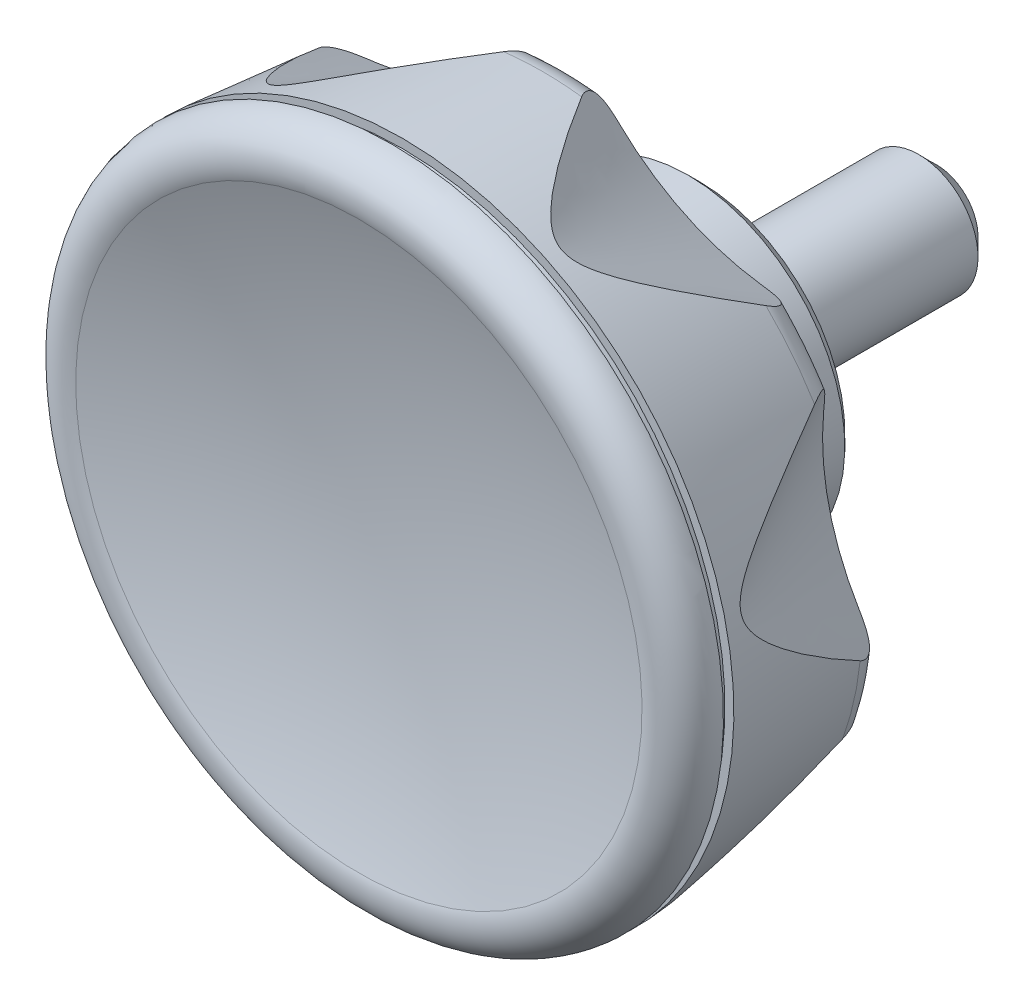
ISO-10303-21;
HEADER;
FILE_DESCRIPTION(('STEP AP214'),'2;1');
FILE_NAME('part.step','',(''),(''),'','','');
FILE_SCHEMA(('AUTOMOTIVE_DESIGN { 1 0 10303 214 1 1 1 1 }'));
ENDSEC;
DATA;
#1=APPLICATION_CONTEXT('core data for automotive mechanical design processes');
#2=APPLICATION_PROTOCOL_DEFINITION('international standard','automotive_design',2000,#1);
#3=PRODUCT_CONTEXT('',#1,'mechanical');
#4=PRODUCT('Part','Part','',(#3));
#5=PRODUCT_RELATED_PRODUCT_CATEGORY('part','',(#4));
#6=PRODUCT_DEFINITION_FORMATION('','',#4);
#7=PRODUCT_DEFINITION_CONTEXT('part definition',#1,'design');
#8=PRODUCT_DEFINITION('design','',#6,#7);
#9=PRODUCT_DEFINITION_SHAPE('','',#8);
#10=(LENGTH_UNIT() NAMED_UNIT(*) SI_UNIT(.MILLI.,.METRE.));
#11=(NAMED_UNIT(*) PLANE_ANGLE_UNIT() SI_UNIT($,.RADIAN.));
#12=(NAMED_UNIT(*) SI_UNIT($,.STERADIAN.) SOLID_ANGLE_UNIT());
#13=UNCERTAINTY_MEASURE_WITH_UNIT(LENGTH_MEASURE(1.E-05),#10,'distance_accuracy_value','');
#14=(GEOMETRIC_REPRESENTATION_CONTEXT(3) GLOBAL_UNCERTAINTY_ASSIGNED_CONTEXT((#13)) GLOBAL_UNIT_ASSIGNED_CONTEXT((#10,
#11,#12)) REPRESENTATION_CONTEXT('',''));
#15=CARTESIAN_POINT('',(0.,0.,0.));
#16=DIRECTION('',(0.,0.,1.));
#17=DIRECTION('',(1.,0.,0.));
#18=AXIS2_PLACEMENT_3D('',#15,#16,#17);
#19=CARTESIAN_POINT('',(0.,0.,13.5));
#20=DIRECTION('',(0.,0.,1.));
#21=DIRECTION('',(0.,1.,0.));
#22=AXIS2_PLACEMENT_3D('',#19,#20,#21);
#23=TOROIDAL_SURFACE('',#22,24.4738282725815,2.4999999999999);
#24=CARTESIAN_POINT('',(0.,0.,11.));
#25=DIRECTION('',(0.,0.,1.));
#26=DIRECTION('',(0.,1.,0.));
#27=AXIS2_PLACEMENT_3D('',#24,#25,#26);
#28=CIRCLE('',#27,24.4738282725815);
#29=CARTESIAN_POINT('',(-16.2379624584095,18.3111126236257,11.));
#30=VERTEX_POINT('',#29);
#31=CARTESIAN_POINT('',(-21.4653013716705,11.7562369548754,11.));
#32=VERTEX_POINT('',#31);
#33=EDGE_CURVE('E131',#30,#32,#28,.T.);
#34=ORIENTED_EDGE('',*,*,#33,.T.);
#35=CARTESIAN_POINT('',(-21.4653013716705,11.7562369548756,11.));
#36=CARTESIAN_POINT('',(-21.4754382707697,11.8601222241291,11.000030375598));
#37=CARTESIAN_POINT('',(-21.4872751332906,11.9639124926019,11.0020766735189));
#38=CARTESIAN_POINT('',(-21.5148402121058,12.1711325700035,11.0112222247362));
#39=CARTESIAN_POINT('',(-21.5305827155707,12.2745596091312,11.0183402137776));
#40=CARTESIAN_POINT('',(-21.5666560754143,12.4816775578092,11.0388207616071));
#41=CARTESIAN_POINT('',(-21.5870535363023,12.5853482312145,11.0522773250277));
#42=CARTESIAN_POINT('',(-21.6327777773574,12.79018793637,11.086761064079));
#43=CARTESIAN_POINT('',(-21.6580966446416,12.8913606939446,11.1077761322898));
#44=CARTESIAN_POINT('',(-21.7159025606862,13.096009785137,11.1604458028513));
#45=CARTESIAN_POINT('',(-21.7487343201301,13.1992460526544,11.1926745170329));
#46=CARTESIAN_POINT('',(-21.8208966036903,13.3985520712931,11.2692171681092));
#47=CARTESIAN_POINT('',(-21.8602062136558,13.494643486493,11.313492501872));
#48=CARTESIAN_POINT('',(-21.9242907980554,13.631369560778,11.3905180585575));
#49=CARTESIAN_POINT('',(-21.9466893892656,13.6760092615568,11.4182052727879));
#50=CARTESIAN_POINT('',(-21.9930436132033,13.7619364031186,11.4772174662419));
#51=CARTESIAN_POINT('',(-22.0169983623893,13.8032257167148,11.5085403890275));
#52=CARTESIAN_POINT('',(-22.0662965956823,13.8818232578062,11.574842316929));
#53=CARTESIAN_POINT('',(-22.0916394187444,13.919133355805,11.6098195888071));
#54=CARTESIAN_POINT('',(-22.1434758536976,13.9891694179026,11.6833341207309));
#55=CARTESIAN_POINT('',(-22.1699692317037,14.0218963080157,11.7218706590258));
#56=CARTESIAN_POINT('',(-22.2204575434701,14.0784837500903,11.7972787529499));
#57=CARTESIAN_POINT('',(-22.2443568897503,14.1029401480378,11.8337680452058));
#58=CARTESIAN_POINT('',(-22.2925479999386,14.147619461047,11.9090357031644));
#59=CARTESIAN_POINT('',(-22.3168398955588,14.1678409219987,11.9478148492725));
#60=CARTESIAN_POINT('',(-22.3655101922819,14.2038164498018,12.0272744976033));
#61=CARTESIAN_POINT('',(-22.3898884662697,14.2195754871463,12.0679528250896));
#62=CARTESIAN_POINT('',(-22.4384945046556,14.2465760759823,12.1508760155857));
#63=CARTESIAN_POINT('',(-22.4627222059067,14.2578158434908,12.1931214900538));
#64=CARTESIAN_POINT('',(-22.5288434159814,14.2825299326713,12.3109990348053));
#65=CARTESIAN_POINT('',(-22.5703388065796,14.2913426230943,12.3878768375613));
#66=CARTESIAN_POINT('',(-22.6510509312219,14.2958836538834,12.5432786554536));
#67=CARTESIAN_POINT('',(-22.6902625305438,14.2915835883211,12.6218058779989));
#68=CARTESIAN_POINT('',(-22.7755265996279,14.2684993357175,12.7992847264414));
#69=CARTESIAN_POINT('',(-22.8206927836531,14.246227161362,12.8982168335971));
#70=CARTESIAN_POINT('',(-22.8841902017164,14.2010917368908,13.044286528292));
#71=CARTESIAN_POINT('',(-22.9046065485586,14.184142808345,13.0924834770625));
#72=CARTESIAN_POINT('',(-22.9440559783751,14.146710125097,13.187982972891));
#73=CARTESIAN_POINT('',(-22.9630908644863,14.1262311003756,13.2352866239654));
#74=CARTESIAN_POINT('',(-22.9814573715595,14.1041446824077,13.2821097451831));
#75=B_SPLINE_CURVE_WITH_KNOTS('',3,(#35,#36,#37,#38,#39,#40,#41,#42,#43,#44,#45,#46,#47,#48,#49,
#50,#51,#52,#53,#54,#55,#56,#57,#58,#59,#60,#61,#62,#63,#64,#65,#66,#67,#68,#69,#70,#71,#72,#73,
#74),.UNSPECIFIED.,.F.,.F.,(4,2,2,2,2,2,2,2,2,2,2,2,2,2,2,2,2,2,2,4),(0.,0.313209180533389,
0.627581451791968,0.946770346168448,1.26545021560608,1.60369981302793,1.94087800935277,
2.11199734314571,2.28302035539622,2.45396261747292,2.62487029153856,2.77466826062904,
2.92451758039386,3.07419932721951,3.22394010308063,3.48614173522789,3.74891177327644,
4.08027673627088,4.24522540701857,4.40995475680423),.UNSPECIFIED.);
#76=CARTESIAN_POINT('',(-22.981457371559,14.1041446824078,13.2821097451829));
#77=VERTEX_POINT('',#76);
#78=EDGE_CURVE('E114',#32,#77,#75,.T.);
#79=ORIENTED_EDGE('',*,*,#78,.T.);
#80=CARTESIAN_POINT('',(0.,0.,13.282109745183));
#81=DIRECTION('',(0.,0.,1.));
#82=DIRECTION('',(0.,1.,0.));
#83=AXIS2_PLACEMENT_3D('',#80,#81,#82);
#84=CIRCLE('',#83,26.9643149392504);
#85=CARTESIAN_POINT('',(-18.8643796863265,19.2667968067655,13.282109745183));
#86=VERTEX_POINT('',#85);
#87=EDGE_CURVE('E146',#86,#77,#84,.T.);
#88=ORIENTED_EDGE('',*,*,#87,.F.);
#89=CARTESIAN_POINT('',(-18.8643796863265,19.2667968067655,13.282109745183));
#90=CARTESIAN_POINT('',(-18.8981743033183,19.2226732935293,13.1915305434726));
#91=CARTESIAN_POINT('',(-18.9255552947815,19.1772447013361,13.0988167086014));
#92=CARTESIAN_POINT('',(-18.9651950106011,19.0843052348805,12.9100927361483));
#93=CARTESIAN_POINT('',(-18.9773008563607,19.0367781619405,12.8140590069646));
#94=CARTESIAN_POINT('',(-18.983341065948,18.9407957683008,12.6209607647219));
#95=CARTESIAN_POINT('',(-18.9771650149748,18.8923365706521,12.5238935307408));
#96=CARTESIAN_POINT('',(-18.9442986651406,18.7968510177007,12.3329550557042));
#97=CARTESIAN_POINT('',(-18.917699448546,18.7498192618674,12.2390715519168));
#98=CARTESIAN_POINT('',(-18.8474169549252,18.6641060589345,12.0674765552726));
#99=CARTESIAN_POINT('',(-18.8058006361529,18.6250650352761,11.9890989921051));
#100=CARTESIAN_POINT('',(-18.7069025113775,18.5516039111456,11.8403817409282));
#101=CARTESIAN_POINT('',(-18.6496092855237,18.5171872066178,11.7700479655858));
#102=CARTESIAN_POINT('',(-18.5279204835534,18.457227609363,11.6454449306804));
#103=CARTESIAN_POINT('',(-18.4646762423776,18.4311577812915,11.5902907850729));
#104=CARTESIAN_POINT('',(-18.3299240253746,18.3843608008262,11.4887242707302));
#105=CARTESIAN_POINT('',(-18.2584221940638,18.3636297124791,11.4423054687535));
#106=CARTESIAN_POINT('',(-18.0741590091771,18.3189481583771,11.3379996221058));
#107=CARTESIAN_POINT('',(-17.9578593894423,18.2981009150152,11.2850492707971));
#108=CARTESIAN_POINT('',(-17.7173155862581,18.2668011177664,11.1949523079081));
#109=CARTESIAN_POINT('',(-17.5930199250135,18.2564250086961,11.1579230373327));
#110=CARTESIAN_POINT('',(-17.3654004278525,18.2458816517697,11.1030967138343));
#111=CARTESIAN_POINT('',(-17.2626807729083,18.2441255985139,11.0829631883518));
#112=CARTESIAN_POINT('',(-17.0560091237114,18.2457463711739,11.0499258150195));
#113=CARTESIAN_POINT('',(-16.9520556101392,18.2491303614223,11.0370320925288));
#114=CARTESIAN_POINT('',(-16.7461255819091,18.260237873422,11.0174873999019));
#115=CARTESIAN_POINT('',(-16.6441552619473,18.2678653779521,11.0107067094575));
#116=CARTESIAN_POINT('',(-16.4406884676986,18.2868392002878,11.0019849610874));
#117=CARTESIAN_POINT('',(-16.3391915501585,18.2981729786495,11.000027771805));
#118=CARTESIAN_POINT('',(-16.2379624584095,18.3111126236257,11.));
#119=B_SPLINE_CURVE_WITH_KNOTS('',3,(#89,#90,#91,#92,#93,#94,#95,#96,#97,#98,#99,#100,#101,#102,
#103,#104,#105,#106,#107,#108,#109,#110,#111,#112,#113,#114,#115,#116,#117,#118),.UNSPECIFIED.,
.F.,.F.,(4,2,2,2,2,2,2,2,2,2,2,2,2,2,4),(0.,0.319088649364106,0.641346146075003,
0.96555390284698,1.28832411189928,1.57749027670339,1.86686764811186,2.12940978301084,
2.39175780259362,2.77800167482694,3.16704536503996,3.48068996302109,3.79477212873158,
4.10202079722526,4.40824052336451),.UNSPECIFIED.);
#120=EDGE_CURVE('E136',#86,#30,#119,.T.);
#121=ORIENTED_EDGE('',*,*,#120,.T.);
#122=EDGE_LOOP('',(#34,#79,#88,#121));
#123=FACE_BOUND('',#122,.T.);
#124=ADVANCED_FACE('F14',(#123),#23,.T.);
#125=CARTESIAN_POINT('',(-26.8251366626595,-2.73611461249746,13.282109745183));
#126=VERTEX_POINT('',#125);
#127=CARTESIAN_POINT('',(-25.355768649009,-9.17383651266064,13.282109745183));
#128=VERTEX_POINT('',#127);
#129=EDGE_CURVE('E153',#126,#128,#84,.T.);
#130=ORIENTED_EDGE('',*,*,#129,.F.);
#131=CARTESIAN_POINT('',(-26.8251366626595,-2.73611461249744,13.282109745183));
#132=CARTESIAN_POINT('',(-26.8117101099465,-2.79004686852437,13.1915305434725));
#133=CARTESIAN_POINT('',(-26.7932643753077,-2.83977845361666,13.0988167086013));
#134=CARTESIAN_POINT('',(-26.7453163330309,-2.92871684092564,12.9100927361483));
#135=CARTESIAN_POINT('',(-26.7157060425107,-2.96781421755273,12.8140590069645));
#136=CARTESIAN_POINT('',(-26.6444299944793,-3.0323806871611,12.620960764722));
#137=CARTESIAN_POINT('',(-26.602692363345,-3.0577658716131,12.5238935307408));
#138=CARTESIAN_POINT('',(-26.507546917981,-3.09160419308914,12.3329550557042));
#139=CARTESIAN_POINT('',(-26.4541916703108,-3.10013190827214,12.2390715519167));
#140=CARTESIAN_POINT('',(-26.3433579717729,-3.09862415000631,12.0674765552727));
#141=CARTESIAN_POINT('',(-26.2868871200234,-3.09042888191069,11.9890989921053));
#142=CARTESIAN_POINT('',(-26.1677909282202,-3.05890947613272,11.8403817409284));
#143=CARTESIAN_POINT('',(-26.1051611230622,-3.03557429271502,11.7700479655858));
#144=CARTESIAN_POINT('',(-25.9824110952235,-2.97781835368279,11.6454449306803));
#145=CARTESIAN_POINT('',(-25.9225967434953,-2.94462628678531,11.590290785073));
#146=CARTESIAN_POINT('',(-25.8019927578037,-2.86845020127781,11.4887242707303));
#147=CARTESIAN_POINT('',(-25.7412038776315,-2.82547344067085,11.4423054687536));
#148=CARTESIAN_POINT('',(-25.5913842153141,-2.70926917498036,11.3379996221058));
#149=CARTESIAN_POINT('',(-25.5025735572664,-2.63134051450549,11.2850492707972));
#150=CARTESIAN_POINT('',(-25.3281257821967,-2.46279090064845,11.194952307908));
#151=CARTESIAN_POINT('',(-25.2425163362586,-2.37208203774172,11.1579230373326));
#152=CARTESIAN_POINT('',(-25.0923547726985,-2.20069562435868,11.1030967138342));
#153=CARTESIAN_POINT('',(-25.0269371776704,-2.12148104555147,11.0829631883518));
#154=CARTESIAN_POINT('',(-24.8993466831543,-1.95888810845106,11.0499258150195));
#155=CARTESIAN_POINT('',(-24.8371784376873,-1.87550409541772,11.0370320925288));
#156=CARTESIAN_POINT('',(-24.7174673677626,-1.70757609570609,11.0174873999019));
#157=CARTESIAN_POINT('',(-24.6598533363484,-1.62309681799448,11.0107067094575));
#158=CARTESIAN_POINT('',(-24.5478281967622,-1.45219008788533,11.0019849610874));
#159=CARTESIAN_POINT('',(-24.4934070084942,-1.365770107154,11.000027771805));
#160=CARTESIAN_POINT('',(-24.4404083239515,-1.27855827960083,11.));
#161=B_SPLINE_CURVE_WITH_KNOTS('',3,(#131,#132,#133,#134,#135,#136,#137,#138,#139,#140,#141,
#142,#143,#144,#145,#146,#147,#148,#149,#150,#151,#152,#153,#154,#155,#156,#157,#158,#159,#160),
.UNSPECIFIED.,.F.,.F.,(4,2,2,2,2,2,2,2,2,2,2,2,2,2,4),(0.,0.319088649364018,0.641346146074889,
0.965553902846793,1.288324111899,1.57749027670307,1.8668676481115,2.12940978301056,
2.39175780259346,2.77800167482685,3.16704536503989,3.4806899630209,3.79477212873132,
4.10202079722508,4.40824052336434),.UNSPECIFIED.);
#162=CARTESIAN_POINT('',(-24.4404083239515,-1.27855827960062,11.));
#163=VERTEX_POINT('',#162);
#164=EDGE_CURVE('E29',#126,#163,#161,.T.);
#165=ORIENTED_EDGE('',*,*,#164,.T.);
#166=CARTESIAN_POINT('',(-22.5747926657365,-9.45235454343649,11.));
#167=VERTEX_POINT('',#166);
#168=EDGE_CURVE('E133',#163,#167,#28,.T.);
#169=ORIENTED_EDGE('',*,*,#168,.T.);
#170=CARTESIAN_POINT('',(-22.5747926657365,-9.45235454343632,11.));
#171=CARTESIAN_POINT('',(-22.6623336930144,-9.39550848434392,11.000030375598));
#172=CARTESIAN_POINT('',(-22.7508603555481,-9.34005074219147,11.0020766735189));
#173=CARTESIAN_POINT('',(-22.930058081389,-9.23240238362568,11.0112222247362));
#174=CARTESIAN_POINT('',(-23.0207358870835,-9.18022466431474,11.0183402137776));
#175=CARTESIAN_POINT('',(-23.2051585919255,-9.07929202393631,11.0388207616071));
#176=CARTESIAN_POINT('',(-23.2989291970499,-9.03060179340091,11.0522773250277));
#177=CARTESIAN_POINT('',(-23.4875879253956,-8.93863497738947,11.0867610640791));
#178=CARTESIAN_POINT('',(-23.5824740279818,-8.89534988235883,11.1077761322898));
#179=CARTESIAN_POINT('',(-23.7785165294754,-8.81294774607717,11.1604458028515));
#180=CARTESIAN_POINT('',(-23.8797001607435,-8.77424988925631,11.1926745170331));
#181=CARTESIAN_POINT('',(-24.0805163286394,-8.70640336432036,11.2692171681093));
#182=CARTESIAN_POINT('',(-24.1801527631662,-8.67722483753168,11.3134925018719));
#183=CARTESIAN_POINT('',(-24.3270055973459,-8.64208087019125,11.3905180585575));
#184=CARTESIAN_POINT('',(-24.3758716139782,-8.63176039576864,11.4182052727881));
#185=CARTESIAN_POINT('',(-24.4719535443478,-8.6144268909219,11.4772174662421));
#186=CARTESIAN_POINT('',(-24.5191703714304,-8.60741200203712,11.5085403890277));
#187=CARTESIAN_POINT('',(-24.611357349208,-8.59695014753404,11.5748423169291));
#188=CARTESIAN_POINT('',(-24.6563285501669,-8.59350149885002,11.6098195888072));
#189=CARTESIAN_POINT('',(-24.7434044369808,-8.59036208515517,11.683334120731));
#190=CARTESIAN_POINT('',(-24.785509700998,-8.59067055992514,11.721870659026));
#191=CARTESIAN_POINT('',(-24.8612304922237,-8.594862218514,11.79727875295));
#192=CARTESIAN_POINT('',(-24.8952522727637,-8.59829916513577,11.8337680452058));
#193=CARTESIAN_POINT('',(-24.960230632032,-8.60811939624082,11.9090357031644));
#194=CARTESIAN_POINT('',(-24.9911861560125,-8.61450369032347,11.9478148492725));
#195=CARTESIAN_POINT('',(-25.0496583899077,-8.63012528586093,12.0272744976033));
#196=CARTESIAN_POINT('',(-25.0771789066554,-8.63935938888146,12.0679528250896));
#197=CARTESIAN_POINT('',(-25.1285941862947,-8.66052652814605,12.1508760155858));
#198=CARTESIAN_POINT('',(-25.152487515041,-8.67246062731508,12.1931214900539));
#199=CARTESIAN_POINT('',(-25.2130356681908,-8.70874728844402,12.3109990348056));
#200=CARTESIAN_POINT('',(-25.2457976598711,-8.73569506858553,12.3878768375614));
#201=CARTESIAN_POINT('',(-25.2996711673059,-8.79596706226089,12.5432786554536));
#202=CARTESIAN_POINT('',(-25.3207572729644,-8.82930497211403,12.621805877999));
#203=CARTESIAN_POINT('',(-25.3558705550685,-8.91035990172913,12.7992847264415));
#204=CARTESIAN_POINT('',(-25.3666181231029,-8.9595587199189,12.8982168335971));
#205=CARTESIAN_POINT('',(-25.3709198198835,-9.03734447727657,13.0442865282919));
#206=CARTESIAN_POINT('',(-25.3703979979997,-9.0638741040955,13.0924834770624));
#207=CARTESIAN_POINT('',(-25.3657282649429,-9.11805580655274,13.1879829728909));
#208=CARTESIAN_POINT('',(-25.3615851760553,-9.14570634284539,13.2352866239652));
#209=CARTESIAN_POINT('',(-25.355768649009,-9.17383651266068,13.282109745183));
#210=B_SPLINE_CURVE_WITH_KNOTS('',3,(#170,#171,#172,#173,#174,#175,#176,#177,#178,#179,#180,
#181,#182,#183,#184,#185,#186,#187,#188,#189,#190,#191,#192,#193,#194,#195,#196,#197,#198,#199,
#200,#201,#202,#203,#204,#205,#206,#207,#208,#209),.UNSPECIFIED.,.F.,.F.,(4,2,2,2,2,2,2,2,2,2,2,
2,2,2,2,2,2,2,2,4),(0.,0.313209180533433,0.627581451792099,0.946770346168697,1.26545021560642,
1.60369981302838,1.9408780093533,2.11199734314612,2.28302035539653,2.45396261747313,
2.62487029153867,2.77466826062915,2.92451758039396,3.07419932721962,3.22394010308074,
3.48614173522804,3.74891177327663,4.08027673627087,4.24522540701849,4.40995475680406),.UNSPECIFIED.);
#211=EDGE_CURVE('E306',#167,#128,#210,.T.);
#212=ORIENTED_EDGE('',*,*,#211,.T.);
#213=EDGE_LOOP('',(#130,#165,#169,#212));
#214=FACE_BOUND('',#213,.T.);
#215=ADVANCED_FACE('F416',(#214),#23,.T.);
#216=CARTESIAN_POINT('',(-14.586018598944,-22.6786759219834,13.282109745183));
#217=VERTEX_POINT('',#216);
#218=CARTESIAN_POINT('',(-8.63666897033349,-25.5437317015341,13.282109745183));
#219=VERTEX_POINT('',#218);
#220=EDGE_CURVE('E157',#217,#219,#84,.T.);
#221=ORIENTED_EDGE('',*,*,#220,.F.);
#222=CARTESIAN_POINT('',(-14.586018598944,-22.6786759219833,13.282109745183));
#223=CARTESIAN_POINT('',(-14.5354813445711,-22.7018048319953,13.1915305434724));
#224=CARTESIAN_POINT('',(-14.4850988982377,-22.7183905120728,13.0988167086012));
#225=CARTESIAN_POINT('',(-14.3856689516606,-22.736355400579,12.9100927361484));
#226=CARTESIAN_POINT('',(-14.336639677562,-22.7375819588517,12.8140590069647));
#227=CARTESIAN_POINT('',(-14.2417196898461,-22.7221126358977,12.620960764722));
#228=CARTESIAN_POINT('',(-14.1958497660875,-22.7053082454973,12.5238935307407));
#229=CARTESIAN_POINT('',(-14.1100716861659,-22.6520183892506,12.3329550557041));
#230=CARTESIAN_POINT('',(-14.070137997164,-22.6156205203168,12.2390715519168));
#231=CARTESIAN_POINT('',(-14.0022131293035,-22.5280271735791,12.0674765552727));
#232=CARTESIAN_POINT('',(-13.9734114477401,-22.4787668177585,11.9890989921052));
#233=CARTESIAN_POINT('',(-13.9237990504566,-22.3660016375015,11.8403817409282));
#234=CARTESIAN_POINT('',(-13.9029941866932,-22.3024864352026,11.7700479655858));
#235=CARTESIAN_POINT('',(-13.8716162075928,-22.1705063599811,11.6454449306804));
#236=CARTESIAN_POINT('',(-13.8602731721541,-22.1030467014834,11.590290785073));
#237=CARTESIAN_POINT('',(-13.8446346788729,-21.9612596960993,11.4887242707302));
#238=CARTESIAN_POINT('',(-13.8403340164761,-21.8869374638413,11.4423054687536));
#239=CARTESIAN_POINT('',(-13.8377751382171,-21.6973515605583,11.3379996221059));
#240=CARTESIAN_POINT('',(-13.8433296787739,-21.5793288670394,11.2850492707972));
#241=CARTESIAN_POINT('',(-13.8663406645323,-21.3378511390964,11.194952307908));
#242=CARTESIAN_POINT('',(-13.8838830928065,-21.2143629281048,11.1579230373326));
#243=CARTESIAN_POINT('',(-13.9242541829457,-20.9901042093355,11.1030967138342));
#244=CARTESIAN_POINT('',(-13.9453994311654,-20.8895691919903,11.0829631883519));
#245=CARTESIAN_POINT('',(-13.9929683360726,-20.6884398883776,11.0499258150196));
#246=CARTESIAN_POINT('',(-14.0193993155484,-20.5878457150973,11.0370320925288));
#247=CARTESIAN_POINT('',(-14.0760520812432,-20.3895504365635,11.0174873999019));
#248=CARTESIAN_POINT('',(-14.1061788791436,-20.2918340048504,11.0107067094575));
#249=CARTESIAN_POINT('',(-14.1699526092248,-20.097690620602,11.0019849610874));
#250=CARTESIAN_POINT('',(-14.2035874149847,-20.001260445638,11.000027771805));
#251=CARTESIAN_POINT('',(-14.238728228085,-19.9054487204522,11.));
#252=B_SPLINE_CURVE_WITH_KNOTS('',3,(#222,#223,#224,#225,#226,#227,#228,#229,#230,#231,#232,
#233,#234,#235,#236,#237,#238,#239,#240,#241,#242,#243,#244,#245,#246,#247,#248,#249,#250,#251),
.UNSPECIFIED.,.F.,.F.,(4,2,2,2,2,2,2,2,2,2,2,2,2,2,4),(0.,0.319088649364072,0.641346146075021,
0.965553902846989,1.28832411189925,1.5774902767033,1.86686764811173,2.12940978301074,
2.39175780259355,2.77800167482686,3.16704536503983,3.48068996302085,3.79477212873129,
4.10202079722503,4.40824052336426),.UNSPECIFIED.);
#253=CARTESIAN_POINT('',(-14.238728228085,-19.905448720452,11.));
#254=VERTEX_POINT('',#253);
#255=EDGE_CURVE('E37',#217,#254,#252,.T.);
#256=ORIENTED_EDGE('',*,*,#255,.T.);
#257=CARTESIAN_POINT('',(-6.685004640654,-23.5431302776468,11.));
#258=VERTEX_POINT('',#257);
#259=EDGE_CURVE('E143',#254,#258,#28,.T.);
#260=ORIENTED_EDGE('',*,*,#259,.T.);
#261=CARTESIAN_POINT('',(-6.685004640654,-23.5431302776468,11.));
#262=CARTESIAN_POINT('',(-6.78402961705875,-23.5761296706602,11.000030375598));
#263=CARTESIAN_POINT('',(-6.88258369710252,-23.6107652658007,11.0020766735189));
#264=CARTESIAN_POINT('',(-7.07847452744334,-23.6837500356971,11.0112222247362));
#265=CARTESIAN_POINT('',(-7.17580539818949,-23.7221125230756,11.0183402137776));
#266=CARTESIAN_POINT('',(-7.36970338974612,-23.8033695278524,11.0388207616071));
#267=CARTESIAN_POINT('',(-7.46623596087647,-23.8463244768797,11.0522773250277));
#268=CARTESIAN_POINT('',(-7.65576530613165,-23.9364834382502,11.0867610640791));
#269=CARTESIAN_POINT('',(-7.74876747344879,-23.9836805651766,11.1077761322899));
#270=CARTESIAN_POINT('',(-7.93542255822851,-24.0855758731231,11.1604458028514));
#271=CARTESIAN_POINT('',(-8.02876472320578,-24.1405567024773,11.192674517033));
#272=CARTESIAN_POINT('',(-8.2070161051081,-24.2552594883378,11.2692171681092));
#273=CARTESIAN_POINT('',(-8.29195109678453,-24.3149658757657,11.313492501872));
#274=CARTESIAN_POINT('',(-8.41098900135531,-24.4078681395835,11.3905180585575));
#275=CARTESIAN_POINT('',(-8.44952533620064,-24.4396384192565,11.418205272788));
#276=CARTESIAN_POINT('',(-8.52298331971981,-24.5039510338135,11.477217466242));
#277=CARTESIAN_POINT('',(-8.55790699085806,-24.5364929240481,11.5085403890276));
#278=CARTESIAN_POINT('',(-8.62356403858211,-24.602044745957,11.5748423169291));
#279=CARTESIAN_POINT('',(-8.65429938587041,-24.6350544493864,11.6098195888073));
#280=CARTESIAN_POINT('',(-8.71104480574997,-24.7011757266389,11.683334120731));
#281=CARTESIAN_POINT('',(-8.73705583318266,-24.7342872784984,11.7218706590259));
#282=CARTESIAN_POINT('',(-8.78098980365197,-24.796101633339,11.7972787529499));
#283=CARTESIAN_POINT('',(-8.79951492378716,-24.824843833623,11.8337680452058));
#284=CARTESIAN_POINT('',(-8.8323505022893,-24.8817687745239,11.9090357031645));
#285=CARTESIAN_POINT('',(-8.84665951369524,-24.9099513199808,11.9478148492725));
#286=CARTESIAN_POINT('',(-8.87090290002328,-24.9654066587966,12.0272744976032));
#287=CARTESIAN_POINT('',(-8.88084214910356,-24.9926804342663,12.0679528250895));
#288=CARTESIAN_POINT('',(-8.89634991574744,-25.0460760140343,12.1508760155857));
#289=CARTESIAN_POINT('',(-8.90191670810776,-25.0721973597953,12.1931214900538));
#290=CARTESIAN_POINT('',(-8.91129781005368,-25.1421601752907,12.3109990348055));
#291=CARTESIAN_POINT('',(-8.91065595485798,-25.1845761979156,12.3878768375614));
#292=CARTESIAN_POINT('',(-8.8971229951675,-25.2642751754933,12.5432786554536));
#293=CARTESIAN_POINT('',(-8.88420533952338,-25.3015468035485,12.621805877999));
#294=CARTESIAN_POINT('',(-8.84272681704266,-25.3795363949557,12.7992847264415));
#295=CARTESIAN_POINT('',(-8.81096263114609,-25.4186141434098,12.8982168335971));
#296=CARTESIAN_POINT('',(-8.75282934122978,-25.4704759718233,13.044286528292));
#297=CARTESIAN_POINT('',(-8.73176229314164,-25.486608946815,13.0924834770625));
#298=CARTESIAN_POINT('',(-8.68648980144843,-25.5167397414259,13.187982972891));
#299=CARTESIAN_POINT('',(-8.66228856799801,-25.5307403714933,13.2352866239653));
#300=CARTESIAN_POINT('',(-8.63666897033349,-25.5437317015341,13.2821097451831));
#301=B_SPLINE_CURVE_WITH_KNOTS('',3,(#261,#262,#263,#264,#265,#266,#267,#268,#269,#270,#271,
#272,#273,#274,#275,#276,#277,#278,#279,#280,#281,#282,#283,#284,#285,#286,#287,#288,#289,#290,
#291,#292,#293,#294,#295,#296,#297,#298,#299,#300),.UNSPECIFIED.,.F.,.F.,(4,2,2,2,2,2,2,2,2,2,2,
2,2,2,2,2,2,2,2,4),(0.,0.313209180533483,0.627581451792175,0.946770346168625,1.26545021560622,
1.60369981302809,1.940878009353,2.11199734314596,2.28302035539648,2.45396261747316,
2.62487029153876,2.77466826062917,2.92451758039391,3.07419932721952,3.22394010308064,
3.48614173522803,3.74891177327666,4.0802767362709,4.24522540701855,4.40995475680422),.UNSPECIFIED.);
#302=EDGE_CURVE('E322',#258,#219,#301,.T.);
#303=ORIENTED_EDGE('',*,*,#302,.T.);
#304=EDGE_LOOP('',(#221,#256,#260,#303));
#305=FACE_BOUND('',#304,.T.);
#306=ADVANCED_FACE('F447',(#305),#23,.T.);
#307=CARTESIAN_POINT('',(8.636668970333,-25.5437317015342,13.282109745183));
#308=VERTEX_POINT('',#307);
#309=CARTESIAN_POINT('',(14.586018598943,-22.6786759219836,13.282109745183));
#310=VERTEX_POINT('',#309);
#311=EDGE_CURVE('E455',#308,#310,#84,.T.);
#312=ORIENTED_EDGE('',*,*,#311,.F.);
#313=CARTESIAN_POINT('',(8.636668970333,-25.5437317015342,13.2821097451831));
#314=CARTESIAN_POINT('',(8.68626134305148,-25.5186407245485,13.1915305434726));
#315=CARTESIAN_POINT('',(8.73064149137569,-25.4895911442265,13.0988167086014));
#316=CARTESIAN_POINT('',(8.80668056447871,-25.4230546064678,12.9100927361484));
#317=CARTESIAN_POINT('',(8.83820877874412,-25.3854867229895,12.8140590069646));
#318=CARTESIAN_POINT('',(8.88529601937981,-25.3016303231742,12.6209607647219));
#319=CARTESIAN_POINT('',(8.90075724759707,-25.2552904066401,12.5238935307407));
#320=CARTESIAN_POINT('',(8.91257531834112,-25.1550007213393,12.3329550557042));
#321=CARTESIAN_POINT('',(8.90901656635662,-25.1010856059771,12.2390715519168));
#322=CARTESIAN_POINT('',(8.88288379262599,-24.9933662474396,12.0674765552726));
#323=CARTESIAN_POINT('',(8.8623280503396,-24.9401348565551,11.9890989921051));
#324=CARTESIAN_POINT('',(8.80509750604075,-24.8310383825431,11.8403817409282));
#325=CARTESIAN_POINT('',(8.76841094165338,-24.7751714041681,11.7700479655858));
#326=CARTESIAN_POINT('',(8.68478861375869,-24.6683508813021,11.6454449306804));
#327=CARTESIAN_POINT('',(8.63911879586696,-24.6174221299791,11.5902907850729));
#328=CARTESIAN_POINT('',(8.53801569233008,-24.5167927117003,11.4887242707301));
#329=CARTESIAN_POINT('',(8.48258965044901,-24.4670911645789,11.4423054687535));
#330=CARTESIAN_POINT('',(8.33596085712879,-24.3468856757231,11.3379996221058));
#331=CARTESIAN_POINT('',(8.24022380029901,-24.277642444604,11.285049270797));
#332=CARTESIAN_POINT('',(8.03708179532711,-24.1450742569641,11.194952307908));
#333=CARTESIAN_POINT('',(7.9295972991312,-24.081795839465,11.1579230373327));
#334=CARTESIAN_POINT('',(7.72909380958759,-23.9735362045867,11.1030967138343));
#335=CARTESIAN_POINT('',(7.63730852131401,-23.9273856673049,11.0829631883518));
#336=CARTESIAN_POINT('',(7.45040057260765,-23.8391744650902,11.0499258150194));
#337=CARTESIAN_POINT('',(7.35527343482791,-23.7971195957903,11.0370320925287));
#338=CARTESIAN_POINT('',(7.16491752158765,-23.7177774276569,11.0174873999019));
#339=CARTESIAN_POINT('',(7.06973598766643,-23.6804063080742,11.0107067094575));
#340=CARTESIAN_POINT('',(6.87818630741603,-23.6092201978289,11.0019849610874));
#341=CARTESIAN_POINT('',(6.78182320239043,-23.5753937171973,11.000027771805));
#342=CARTESIAN_POINT('',(6.6850046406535,-23.543130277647,11.));
#343=B_SPLINE_CURVE_WITH_KNOTS('',3,(#313,#314,#315,#316,#317,#318,#319,#320,#321,#322,#323,
#324,#325,#326,#327,#328,#329,#330,#331,#332,#333,#334,#335,#336,#337,#338,#339,#340,#341,#342),
.UNSPECIFIED.,.F.,.F.,(4,2,2,2,2,2,2,2,2,2,2,2,2,2,4),(0.,0.319088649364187,0.641346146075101,
0.965553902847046,1.28832411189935,1.57749027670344,1.86686764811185,2.12940978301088,
2.39175780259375,2.77800167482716,3.16704536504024,3.48068996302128,3.79477212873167,
4.1020207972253,4.40824052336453),.UNSPECIFIED.);
#344=CARTESIAN_POINT('',(6.685004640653,-23.5431302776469,11.));
#345=VERTEX_POINT('',#344);
#346=EDGE_CURVE('E315',#308,#345,#343,.T.);
#347=ORIENTED_EDGE('',*,*,#346,.T.);
#348=CARTESIAN_POINT('',(14.2387282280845,-19.9054487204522,11.));
#349=VERTEX_POINT('',#348);
#350=EDGE_CURVE('E449',#345,#349,#28,.T.);
#351=ORIENTED_EDGE('',*,*,#350,.T.);
#352=CARTESIAN_POINT('',(14.2387282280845,-19.9054487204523,11.));
#353=CARTESIAN_POINT('',(14.202787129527,-20.0034443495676,11.000030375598));
#354=CARTESIAN_POINT('',(14.168418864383,-20.1020919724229,11.0020766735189));
#355=CARTESIAN_POINT('',(14.1033447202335,-20.3007508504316,11.0112222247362));
#356=CARTESIAN_POINT('',(14.0726529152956,-20.4007658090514,11.0183402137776));
#357=CARTESIAN_POINT('',(14.0152887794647,-20.6030242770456,11.038820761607));
#358=CARTESIAN_POINT('',(13.9886852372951,-20.7052784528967,11.0522773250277));
#359=CARTESIAN_POINT('',(13.9410047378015,-20.9096716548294,11.086761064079));
#360=CARTESIAN_POINT('',(13.9199190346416,-21.0118106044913,11.1077761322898));
#361=CARTESIAN_POINT('',(13.8832064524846,-21.2212741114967,11.1604458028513));
#362=CARTESIAN_POINT('',(13.8679943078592,-21.3285319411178,11.1926745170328));
#363=CARTESIAN_POINT('',(13.8465346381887,-21.5394105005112,11.269217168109));
#364=CARTESIAN_POINT('',(13.8402588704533,-21.6430416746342,11.3134925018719));
#365=CARTESIAN_POINT('',(13.8386738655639,-21.7940328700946,11.3905180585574));
#366=CARTESIAN_POINT('',(13.8394858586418,-21.843970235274,11.4182052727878));
#367=CARTESIAN_POINT('',(13.8439671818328,-21.9415002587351,11.4772174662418));
#368=CARTESIAN_POINT('',(13.8476349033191,-21.9890942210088,11.5085403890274));
#369=CARTESIAN_POINT('',(13.8579488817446,-22.0812978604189,11.5748423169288));
#370=CARTESIAN_POINT('',(13.8645937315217,-22.1259089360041,11.609819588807));
#371=CARTESIAN_POINT('',(13.8809092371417,-22.2115002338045,11.6833341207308));
#372=CARTESIAN_POINT('',(13.8905792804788,-22.2524811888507,11.7218706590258));
#373=CARTESIAN_POINT('',(13.9115153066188,-22.3253707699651,11.7972787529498));
#374=CARTESIAN_POINT('',(13.9224366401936,-22.3577747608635,11.8337680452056));
#375=CARTESIAN_POINT('',(13.9464697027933,-22.4189387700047,11.9090357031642));
#376=CARTESIAN_POINT('',(13.9595821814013,-22.4476975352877,11.9478148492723));
#377=CARTESIAN_POINT('',(13.9878234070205,-22.5012276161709,12.0272744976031));
#378=CARTESIAN_POINT('',(14.0029498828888,-22.5260033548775,12.0679528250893));
#379=CARTESIAN_POINT('',(14.0350272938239,-22.5714194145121,12.1508760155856));
#380=CARTESIAN_POINT('',(14.0519789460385,-22.5920581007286,12.1931214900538));
#381=CARTESIAN_POINT('',(14.1008290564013,-22.6430136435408,12.3109990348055));
#382=CARTESIAN_POINT('',(14.1343914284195,-22.6689577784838,12.3878768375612));
#383=CARTESIAN_POINT('',(14.2051402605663,-22.7080687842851,12.5432786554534));
#384=CARTESIAN_POINT('',(14.2423344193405,-22.7212078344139,12.6218058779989));
#385=CARTESIAN_POINT('',(14.3291705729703,-22.7374043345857,12.7992847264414));
#386=CARTESIAN_POINT('',(14.3795274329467,-22.7369346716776,12.898216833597));
#387=CARTESIAN_POINT('',(14.4563201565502,-22.7238195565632,13.0442865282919));
#388=CARTESIAN_POINT('',(14.4820685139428,-22.7174074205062,13.0924834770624));
#389=CARTESIAN_POINT('',(14.5338526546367,-22.7007982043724,13.1879829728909));
#390=CARTESIAN_POINT('',(14.5598880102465,-22.6906061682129,13.2352866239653));
#391=CARTESIAN_POINT('',(14.586018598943,-22.6786759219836,13.2821097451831));
#392=B_SPLINE_CURVE_WITH_KNOTS('',3,(#352,#353,#354,#355,#356,#357,#358,#359,#360,#361,#362,
#363,#364,#365,#366,#367,#368,#369,#370,#371,#372,#373,#374,#375,#376,#377,#378,#379,#380,#381,
#382,#383,#384,#385,#386,#387,#388,#389,#390,#391),.UNSPECIFIED.,.F.,.F.,(4,2,2,2,2,2,2,2,2,2,2,
2,2,2,2,2,2,2,2,4),(0.,0.313209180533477,0.627581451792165,0.946770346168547,1.26545021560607,
1.60369981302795,1.94087800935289,2.11199734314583,2.28302035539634,2.45396261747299,
2.62487029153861,2.77466826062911,2.9245175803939,3.07419932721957,3.22394010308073,
3.48614173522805,3.74891177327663,4.08027673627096,4.24522540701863,4.40995475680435),.UNSPECIFIED.);
#393=EDGE_CURVE('E338',#349,#310,#392,.T.);
#394=ORIENTED_EDGE('',*,*,#393,.T.);
#395=EDGE_LOOP('',(#312,#347,#351,#394));
#396=FACE_BOUND('',#395,.T.);
#397=ADVANCED_FACE('F428',(#396),#23,.T.);
#398=CARTESIAN_POINT('',(25.3557686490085,-9.17383651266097,13.282109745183));
#399=VERTEX_POINT('',#398);
#400=CARTESIAN_POINT('',(26.825136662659,-2.73611461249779,13.282109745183));
#401=VERTEX_POINT('',#400);
#402=EDGE_CURVE('E164',#399,#401,#84,.T.);
#403=ORIENTED_EDGE('',*,*,#402,.F.);
#404=CARTESIAN_POINT('',(25.3557686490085,-9.17383651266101,13.282109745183));
#405=CARTESIAN_POINT('',(25.3670720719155,-9.11941966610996,13.1915305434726));
#406=CARTESIAN_POINT('',(25.3720307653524,-9.06660975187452,13.0988167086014));
#407=CARTESIAN_POINT('',(25.3674199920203,-8.96567515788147,12.9100927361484));
#408=CARTESIAN_POINT('',(25.3577057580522,-8.91760221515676,12.8140590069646));
#409=CARTESIAN_POINT('',(25.3215025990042,-8.82850431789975,12.6209607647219));
#410=CARTESIAN_POINT('',(25.294912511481,-8.78752377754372,12.5238935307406));
#411=CARTESIAN_POINT('',(25.2238713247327,-8.71575444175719,12.3329550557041));
#412=CARTESIAN_POINT('',(25.1794999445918,-8.68492126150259,12.2390715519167));
#413=CARTESIAN_POINT('',(25.0789880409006,-8.63819076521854,12.0674765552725));
#414=CARTESIAN_POINT('',(25.0245537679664,-8.62107266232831,11.989098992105));
#415=CARTESIAN_POINT('',(24.9035760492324,-8.59779676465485,11.8403817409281));
#416=CARTESIAN_POINT('',(24.8370237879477,-8.59164698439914,11.7700479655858));
#417=CARTESIAN_POINT('',(24.7013704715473,-8.5904240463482,11.6454449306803));
#418=CARTESIAN_POINT('',(24.633078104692,-8.59437659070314,11.5902907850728));
#419=CARTESIAN_POINT('',(24.4913661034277,-8.61068076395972,11.4887242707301));
#420=CARTESIAN_POINT('',(24.4179502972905,-8.62302618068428,11.4423054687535));
#421=CARTESIAN_POINT('',(24.2325483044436,-8.66271829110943,11.3379996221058));
#422=CARTESIAN_POINT('',(24.1187206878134,-8.69439608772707,11.285049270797));
#423=CARTESIAN_POINT('',(23.8884177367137,-8.77056398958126,11.1949523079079));
#424=CARTESIAN_POINT('',(23.771929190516,-8.815145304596,11.1579230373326));
#425=CARTESIAN_POINT('',(23.5622765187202,-8.90440646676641,11.1030967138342));
#426=CARTESIAN_POINT('',(23.4689673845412,-8.94739270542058,11.0829631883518));
#427=CARTESIAN_POINT('',(23.2834658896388,-9.03852443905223,11.0499258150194));
#428=CARTESIAN_POINT('',(23.1912752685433,-9.08667704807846,11.0370320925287));
#429=CARTESIAN_POINT('',(23.0105580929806,-9.18603426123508,11.0174873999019));
#430=CARTESIAN_POINT('',(22.9219954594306,-9.23714966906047,11.0107067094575));
#431=CARTESIAN_POINT('',(22.746910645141,-9.342525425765,11.0019849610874));
#432=CARTESIAN_POINT('',(22.6603826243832,-9.39677466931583,11.000027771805));
#433=CARTESIAN_POINT('',(22.5747926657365,-9.45235454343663,11.));
#434=B_SPLINE_CURVE_WITH_KNOTS('',3,(#404,#405,#406,#407,#408,#409,#410,#411,#412,#413,#414,
#415,#416,#417,#418,#419,#420,#421,#422,#423,#424,#425,#426,#427,#428,#429,#430,#431,#432,#433),
.UNSPECIFIED.,.F.,.F.,(4,2,2,2,2,2,2,2,2,2,2,2,2,2,4),(0.,0.319088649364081,0.641346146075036,
0.965553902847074,1.28832411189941,1.5774902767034,1.86686764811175,2.12940978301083,
2.39175780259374,2.77800167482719,3.1670453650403,3.48068996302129,3.79477212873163,
4.10202079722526,4.40824052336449),.UNSPECIFIED.);
#435=CARTESIAN_POINT('',(22.574792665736,-9.45235454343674,11.));
#436=VERTEX_POINT('',#435);
#437=EDGE_CURVE('E331',#399,#436,#434,.T.);
#438=ORIENTED_EDGE('',*,*,#437,.T.);
#439=CARTESIAN_POINT('',(24.440408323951,-1.27855827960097,11.));
#440=VERTEX_POINT('',#439);
#441=EDGE_CURVE('E152',#436,#440,#28,.T.);
#442=ORIENTED_EDGE('',*,*,#441,.T.);
#443=CARTESIAN_POINT('',(24.4404083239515,-1.2785582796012,11.));
#444=CARTESIAN_POINT('',(24.4946154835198,-1.36775743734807,11.000030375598));
#445=CARTESIAN_POINT('',(24.5503130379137,-1.45613341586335,11.0020766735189));
#446=CARTESIAN_POINT('',(24.6650577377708,-1.6308722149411,11.0112222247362));
#447=CARTESIAN_POINT('',(24.724116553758,-1.71722634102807,11.0183402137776));
#448=CARTESIAN_POINT('',(24.8464826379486,-1.88818152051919,11.038820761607));
#449=CARTESIAN_POINT('',(24.9098411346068,-1.97273544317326,11.0522773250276));
#450=CARTESIAN_POINT('',(25.0399138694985,-2.13745063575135,11.086761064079));
#451=CARTESIAN_POINT('',(25.1066225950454,-2.21761869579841,11.1077761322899));
#452=CARTESIAN_POINT('',(25.2474978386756,-2.37692010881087,11.1604458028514));
#453=CARTESIAN_POINT('',(25.3218707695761,-2.45568760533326,11.1926745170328));
#454=CARTESIAN_POINT('',(25.4733623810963,-2.60394608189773,11.269217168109));
#455=CARTESIAN_POINT('',(25.5504716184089,-2.67346565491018,11.3134925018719));
#456=CARTESIAN_POINT('',(25.667533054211,-2.76884633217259,11.3905180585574));
#457=CARTESIAN_POINT('',(25.7070819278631,-2.7993469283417,11.4182052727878));
#458=CARTESIAN_POINT('',(25.7861280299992,-2.85665226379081,11.4772174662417));
#459=CARTESIAN_POINT('',(25.8256252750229,-2.88345907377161,11.5085403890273));
#460=CARTESIAN_POINT('',(25.9041436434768,-2.93288330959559,11.5748423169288));
#461=CARTESIAN_POINT('',(25.9431649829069,-2.95550270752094,11.6098195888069));
#462=CARTESIAN_POINT('',(26.0202555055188,-2.99611203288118,11.6833341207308));
#463=CARTESIAN_POINT('',(26.0583248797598,-3.01410289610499,11.7218706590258));
#464=CARTESIAN_POINT('',(26.1283656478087,-3.04318036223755,11.7972787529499));
#465=CARTESIAN_POINT('',(26.1605094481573,-3.05484527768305,11.8337680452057));
#466=CARTESIAN_POINT('',(26.2233137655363,-3.074190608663,11.9090357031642));
#467=CARTESIAN_POINT('',(26.2539737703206,-3.08186965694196,11.9478148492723));
#468=CARTESIAN_POINT('',(26.3134333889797,-3.09316523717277,12.0272744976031));
#469=CARTESIAN_POINT('',(26.3422350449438,-3.09678630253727,12.0679528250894));
#470=CARTESIAN_POINT('',(26.3977426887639,-3.10002362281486,12.1508760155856));
#471=CARTESIAN_POINT('',(26.4244478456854,-3.09963829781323,12.1931214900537));
#472=CARTESIAN_POINT('',(26.4947440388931,-3.09321600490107,12.3109990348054));
#473=CARTESIAN_POINT('',(26.5359537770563,-3.08315178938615,12.3878768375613));
#474=CARTESIAN_POINT('',(26.6106431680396,-3.05222343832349,12.5432786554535));
#475=CARTESIAN_POINT('',(26.6441058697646,-3.03133593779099,12.6218058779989));
#476=CARTESIAN_POINT('',(26.7109102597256,-2.9735430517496,12.7992847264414));
#477=CARTESIAN_POINT('',(26.7419400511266,-2.93387964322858,12.8982168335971));
#478=CARTESIAN_POINT('',(26.7795657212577,-2.86566353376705,13.044286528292));
#479=CARTESIAN_POINT('',(26.7906063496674,-2.84153475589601,13.0924834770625));
#480=CARTESIAN_POINT('',(26.8099076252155,-2.79069260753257,13.1879829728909));
#481=CARTESIAN_POINT('',(26.818171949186,-2.7639827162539,13.2352866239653));
#482=CARTESIAN_POINT('',(26.825136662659,-2.73611461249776,13.282109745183));
#483=B_SPLINE_CURVE_WITH_KNOTS('',3,(#443,#444,#445,#446,#447,#448,#449,#450,#451,#452,#453,
#454,#455,#456,#457,#458,#459,#460,#461,#462,#463,#464,#465,#466,#467,#468,#469,#470,#471,#472,
#473,#474,#475,#476,#477,#478,#479,#480,#481,#482),.UNSPECIFIED.,.F.,.F.,(4,2,2,2,2,2,2,2,2,2,2,
2,2,2,2,2,2,2,2,4),(0.,0.313209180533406,0.627581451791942,0.946770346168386,1.26545021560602,
1.60369981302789,1.94087800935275,2.11199734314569,2.2830203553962,2.45396261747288,
2.62487029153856,2.77466826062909,2.9245175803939,3.07419932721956,3.22394010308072,
3.48614173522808,3.74891177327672,4.08027673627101,4.2452254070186,4.40995475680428),.UNSPECIFIED.);
#484=EDGE_CURVE('E378',#440,#401,#483,.T.);
#485=ORIENTED_EDGE('',*,*,#484,.T.);
#486=EDGE_LOOP('',(#403,#438,#442,#485));
#487=FACE_BOUND('',#486,.T.);
#488=ADVANCED_FACE('F419',(#487),#23,.T.);
#489=CARTESIAN_POINT('',(22.981457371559,14.1041446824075,13.282109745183));
#490=VERTEX_POINT('',#489);
#491=CARTESIAN_POINT('',(18.8643796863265,19.2667968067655,13.282109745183));
#492=VERTEX_POINT('',#491);
#493=EDGE_CURVE('E159',#490,#492,#84,.T.);
#494=ORIENTED_EDGE('',*,*,#493,.F.);
#495=CARTESIAN_POINT('',(22.981457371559,14.1041446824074,13.282109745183));
#496=CARTESIAN_POINT('',(22.9459601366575,14.1469104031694,13.1915305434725));
#497=CARTESIAN_POINT('',(22.9077633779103,14.1837137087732,13.0988167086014));
#498=CARTESIAN_POINT('',(22.8259747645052,14.2430405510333,12.9100927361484));
#499=CARTESIAN_POINT('',(22.7823330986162,14.2654186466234,12.8140590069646));
#500=CARTESIAN_POINT('',(22.6901012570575,14.2926655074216,12.6209607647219));
#501=CARTESIAN_POINT('',(22.6414827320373,14.2974274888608,12.5238935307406));
#502=CARTESIAN_POINT('',(22.5410777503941,14.2866327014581,12.3329550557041));
#503=CARTESIAN_POINT('',(22.4893062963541,14.2711659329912,12.2390715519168));
#504=CARTESIAN_POINT('',(22.390102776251,14.2217185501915,12.0674765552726));
#505=CARTESIAN_POINT('',(22.3427800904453,14.1898330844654,11.989098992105));
#506=CARTESIAN_POINT('',(22.2491538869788,14.1097611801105,11.8403817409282));
#507=CARTESIAN_POINT('',(22.2028511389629,14.0615628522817,11.7700479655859));
#508=CARTESIAN_POINT('',(22.1173165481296,13.9562673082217,11.6454449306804));
#509=CARTESIAN_POINT('',(22.0778271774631,13.9004098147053,11.5902907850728));
#510=CARTESIAN_POINT('',(22.0022183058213,13.7794494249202,11.48872427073));
#511=CARTESIAN_POINT('',(21.9660963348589,13.7143533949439,11.4423054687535));
#512=CARTESIAN_POINT('',(21.8815326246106,13.5446526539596,11.3379996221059));
#513=CARTESIAN_POINT('',(21.8353289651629,13.4359078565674,11.285049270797));
#514=CARTESIAN_POINT('',(21.7512878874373,13.2083598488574,11.1949523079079));
#515=CARTESIAN_POINT('',(21.7135135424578,13.089489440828,11.1579230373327));
#516=CARTESIAN_POINT('',(21.6525844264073,12.8699229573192,11.1030967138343));
#517=CARTESIAN_POINT('',(21.6280151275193,12.7701694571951,11.0829631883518));
#518=CARTESIAN_POINT('',(21.5836064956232,12.5683188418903,11.0499258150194));
#519=CARTESIAN_POINT('',(21.5637738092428,12.4662186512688,11.0370320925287));
#520=CARTESIAN_POINT('',(21.5287790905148,12.2629800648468,11.0174873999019));
#521=CARTESIAN_POINT('',(21.5135248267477,12.1618690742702,11.0107067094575));
#522=CARTESIAN_POINT('',(21.4867473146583,11.959281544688,11.0019849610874));
#523=CARTESIAN_POINT('',(21.475211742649,11.8578073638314,11.000027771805));
#524=CARTESIAN_POINT('',(21.4653013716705,11.7562369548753,11.));
#525=B_SPLINE_CURVE_WITH_KNOTS('',3,(#495,#496,#497,#498,#499,#500,#501,#502,#503,#504,#505,
#506,#507,#508,#509,#510,#511,#512,#513,#514,#515,#516,#517,#518,#519,#520,#521,#522,#523,#524),
.UNSPECIFIED.,.F.,.F.,(4,2,2,2,2,2,2,2,2,2,2,2,2,2,4),(0.,0.31908864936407,0.641346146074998,
0.965553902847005,1.28832411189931,1.57749027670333,1.86686764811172,2.12940978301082,
2.39175780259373,2.77800167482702,3.16704536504,3.48068996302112,3.7947721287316,
4.10202079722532,4.40824052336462),.UNSPECIFIED.);
#526=CARTESIAN_POINT('',(21.4653013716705,11.7562369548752,11.));
#527=VERTEX_POINT('',#526);
#528=EDGE_CURVE('E372',#490,#527,#525,.T.);
#529=ORIENTED_EDGE('',*,*,#528,.T.);
#530=CARTESIAN_POINT('',(16.237962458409,18.3111126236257,11.));
#531=VERTEX_POINT('',#530);
#532=EDGE_CURVE('E145',#527,#531,#28,.T.);
#533=ORIENTED_EDGE('',*,*,#532,.T.);
#534=CARTESIAN_POINT('',(16.237962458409,18.3111126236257,11.));
#535=CARTESIAN_POINT('',(16.3414987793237,18.2978787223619,11.000030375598));
#536=CARTESIAN_POINT('',(16.4453207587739,18.28632330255,11.0020766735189));
#537=CARTESIAN_POINT('',(16.6534792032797,18.2670864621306,11.0112222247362));
#538=CARTESIAN_POINT('',(16.7578161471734,18.259419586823,11.0183402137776));
#539=CARTESIAN_POINT('',(16.9677682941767,18.2485004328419,11.038820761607));
#540=CARTESIAN_POINT('',(17.0733785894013,18.2453175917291,11.0522773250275));
#541=CARTESIAN_POINT('',(17.2832571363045,18.2443143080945,11.086761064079));
#542=CARTESIAN_POINT('',(17.3875272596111,18.2464853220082,11.1077761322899));
#543=CARTESIAN_POINT('',(17.5999083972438,18.2573032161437,11.1604458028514));
#544=CARTESIAN_POINT('',(17.7078620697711,18.2663395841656,11.1926745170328));
#545=CARTESIAN_POINT('',(17.9182286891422,18.2923428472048,11.269217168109));
#546=CARTESIAN_POINT('',(18.0206581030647,18.3092845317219,11.3134925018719));
#547=CARTESIAN_POINT('',(18.1682163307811,18.3413379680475,11.3905180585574));
#548=CARTESIAN_POINT('',(18.2167209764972,18.3532417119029,11.4182052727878));
#549=CARTESIAN_POINT('',(18.3108085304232,18.3793131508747,11.4772174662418));
#550=CARTESIAN_POINT('',(18.3563930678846,18.3934795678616,11.5085403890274));
#551=CARTESIAN_POINT('',(18.4439898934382,18.4240521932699,11.5748423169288));
#552=CARTESIAN_POINT('',(18.4860038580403,18.4404573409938,11.609819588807));
#553=CARTESIAN_POINT('',(18.5658186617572,18.4754096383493,11.6833341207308));
#554=CARTESIAN_POINT('',(18.6036203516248,18.493956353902,11.7218706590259));
#555=CARTESIAN_POINT('',(18.6700237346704,18.5305869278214,11.7972787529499));
#556=CARTESIAN_POINT('',(18.6991850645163,18.5484450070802,11.8337680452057));
#557=CARTESIAN_POINT('',(18.7534677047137,18.5854857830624,11.9090357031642));
#558=CARTESIAN_POINT('',(18.7785876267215,18.6046689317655,11.9478148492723));
#559=CARTESIAN_POINT('',(18.8244913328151,18.6441136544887,12.027274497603));
#560=CARTESIAN_POINT('',(18.8452799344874,18.6643739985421,12.0679528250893));
#561=CARTESIAN_POINT('',(18.8824194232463,18.7057531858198,12.1508760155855));
#562=CARTESIAN_POINT('',(18.8987685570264,18.726872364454,12.1931214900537));
#563=CARTESIAN_POINT('',(18.9375763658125,18.7858363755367,12.3109990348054));
#564=CARTESIAN_POINT('',(18.9554016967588,18.8243303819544,12.3878768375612));
#565=CARTESIAN_POINT('',(18.9777890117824,18.9020084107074,12.5432786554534));
#566=CARTESIAN_POINT('',(18.982322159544,18.9411937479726,12.6218058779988));
#567=CARTESIAN_POINT('',(18.9787897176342,19.029456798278,12.7992847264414));
#568=CARTESIAN_POINT('',(18.967126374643,19.0784465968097,12.8982168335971));
#569=CARTESIAN_POINT('',(18.9372520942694,19.1503955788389,13.0442865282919));
#570=CARTESIAN_POINT('',(18.9252711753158,19.1740715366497,13.0924834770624));
#571=CARTESIAN_POINT('',(18.8975553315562,19.2208614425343,13.1879829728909));
#572=CARTESIAN_POINT('',(18.8818254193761,19.2439760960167,13.2352866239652));
#573=CARTESIAN_POINT('',(18.8643796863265,19.2667968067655,13.282109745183));
#574=B_SPLINE_CURVE_WITH_KNOTS('',3,(#534,#535,#536,#537,#538,#539,#540,#541,#542,#543,#544,
#545,#546,#547,#548,#549,#550,#551,#552,#553,#554,#555,#556,#557,#558,#559,#560,#561,#562,#563,
#564,#565,#566,#567,#568,#569,#570,#571,#572,#573),.UNSPECIFIED.,.F.,.F.,(4,2,2,2,2,2,2,2,2,2,2,
2,2,2,2,2,2,2,2,4),(0.,0.313209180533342,0.627581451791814,0.94677034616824,1.26545021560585,
1.603699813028,1.94087800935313,2.11199734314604,2.28302035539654,2.4539626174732,
2.62487029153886,2.77466826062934,2.92451758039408,3.07419932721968,3.2239401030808,
3.48614173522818,3.74891177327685,4.08027673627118,4.24522540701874,4.40995475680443),.UNSPECIFIED.);
#575=EDGE_CURVE('E394',#531,#492,#574,.T.);
#576=ORIENTED_EDGE('',*,*,#575,.T.);
#577=EDGE_LOOP('',(#494,#529,#533,#576));
#578=FACE_BOUND('',#577,.T.);
#579=ADVANCED_FACE('F408',(#578),#23,.T.);
#580=CARTESIAN_POINT('',(0.,0.,101.629158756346));
#581=DIRECTION('',(0.,1.,0.));
#582=DIRECTION('',(-1.,0.,0.));
#583=AXIS2_PLACEMENT_3D('',#580,#581,#582);
#584=SPHERICAL_SURFACE('',#583,76.6575800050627);
#585=CARTESIAN_POINT('',(0.,0.,101.629158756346));
#586=DIRECTION('',(0.,0.,1.));
#587=DIRECTION('',(0.,1.,0.));
#588=AXIS2_PLACEMENT_3D('',#585,#586,#587);
#589=SPHERICAL_SURFACE('',#588,76.6575800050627);
#590=CARTESIAN_POINT('',(0.,0.,28.8005083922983));
#591=DIRECTION('',(0.,0.,1.));
#592=DIRECTION('',(0.,1.,0.));
#593=AXIS2_PLACEMENT_3D('',#590,#591,#592);
#594=CIRCLE('',#593,23.9243026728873);
#595=CARTESIAN_POINT('',(0.,23.9243026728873,28.8005083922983));
#596=VERTEX_POINT('',#595);
#597=EDGE_CURVE('E178',#596,#596,#594,.T.);
#598=ORIENTED_EDGE('',*,*,#597,.T.);
#599=EDGE_LOOP('',(#598));
#600=FACE_BOUND('',#599,.T.);
#601=ADVANCED_FACE('F418',(#600),#589,.F.);
#602=CARTESIAN_POINT('',(-5.,0.,-20.));
#603=DIRECTION('',(0.,0.,-1.));
#604=DIRECTION('',(0.,-1.,0.));
#605=AXIS2_PLACEMENT_3D('',#602,#603,#604);
#606=PLANE('',#605);
#607=CARTESIAN_POINT('',(0.,0.,-20.));
#608=DIRECTION('',(0.,0.,-1.));
#609=DIRECTION('',(-1.,0.,0.));
#610=AXIS2_PLACEMENT_3D('',#607,#608,#609);
#611=CIRCLE('',#610,3.5);
#612=CARTESIAN_POINT('',(-3.5,0.,-20.));
#613=VERTEX_POINT('',#612);
#614=EDGE_CURVE('E9',#613,#613,#611,.T.);
#615=ORIENTED_EDGE('',*,*,#614,.T.);
#616=EDGE_LOOP('',(#615));
#617=FACE_BOUND('',#616,.T.);
#618=ADVANCED_FACE('F426',(#617),#606,.T.);
#619=CARTESIAN_POINT('',(0.,0.,30.1700591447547));
#620=DIRECTION('',(0.,0.,1.));
#621=DIRECTION('',(0.,1.,0.));
#622=AXIS2_PLACEMENT_3D('',#619,#620,#621);
#623=CYLINDRICAL_SURFACE('',#622,5.);
#624=CARTESIAN_POINT('',(0.,0.,-18.5));
#625=DIRECTION('',(0.,0.,-1.));
#626=DIRECTION('',(-1.,0.,0.));
#627=AXIS2_PLACEMENT_3D('',#624,#625,#626);
#628=CIRCLE('',#627,5.);
#629=CARTESIAN_POINT('',(-5.,0.,-18.5));
#630=VERTEX_POINT('',#629);
#631=EDGE_CURVE('E22',#630,#630,#628,.F.);
#632=ORIENTED_EDGE('',*,*,#631,.T.);
#633=EDGE_LOOP('',(#632));
#634=FACE_BOUND('',#633,.T.);
#635=CARTESIAN_POINT('',(0.,0.,0.));
#636=DIRECTION('',(0.,0.,1.));
#637=DIRECTION('',(0.,1.,0.));
#638=AXIS2_PLACEMENT_3D('',#635,#636,#637);
#639=CIRCLE('',#638,5.);
#640=CARTESIAN_POINT('',(0.,5.,0.));
#641=VERTEX_POINT('',#640);
#642=EDGE_CURVE('E229',#641,#641,#639,.T.);
#643=ORIENTED_EDGE('',*,*,#642,.F.);
#644=EDGE_LOOP('',(#643));
#645=FACE_BOUND('',#644,.T.);
#646=ADVANCED_FACE('F523',(#634,#645),#623,.T.);
#647=CARTESIAN_POINT('',(-12.25,0.,0.));
#648=DIRECTION('',(0.,0.,-1.));
#649=DIRECTION('',(0.,-1.,0.));
#650=AXIS2_PLACEMENT_3D('',#647,#648,#649);
#651=PLANE('',#650);
#652=ORIENTED_EDGE('',*,*,#642,.T.);
#653=EDGE_LOOP('',(#652));
#654=FACE_BOUND('',#653,.T.);
#655=CARTESIAN_POINT('',(0.,0.,0.));
#656=DIRECTION('',(0.,0.,1.));
#657=DIRECTION('',(0.,1.,0.));
#658=AXIS2_PLACEMENT_3D('',#655,#656,#657);
#659=CIRCLE('',#658,12.25);
#660=CARTESIAN_POINT('',(0.,12.25,0.));
#661=VERTEX_POINT('',#660);
#662=EDGE_CURVE('E659',#661,#661,#659,.T.);
#663=ORIENTED_EDGE('',*,*,#662,.F.);
#664=EDGE_LOOP('',(#663));
#665=FACE_BOUND('',#664,.T.);
#666=ADVANCED_FACE('F531',(#654,#665),#651,.T.);
#667=CARTESIAN_POINT('',(0.,0.,1.));
#668=DIRECTION('',(0.,0.,1.));
#669=DIRECTION('',(0.,1.,0.));
#670=AXIS2_PLACEMENT_3D('',#667,#668,#669);
#671=CONICAL_SURFACE('',#670,13.25,0.785398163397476);
#672=ORIENTED_EDGE('',*,*,#662,.T.);
#673=EDGE_LOOP('',(#672));
#674=FACE_BOUND('',#673,.T.);
#675=CARTESIAN_POINT('',(0.,0.,1.));
#676=DIRECTION('',(0.,0.,1.));
#677=DIRECTION('',(0.,1.,0.));
#678=AXIS2_PLACEMENT_3D('',#675,#676,#677);
#679=CIRCLE('',#678,13.25);
#680=CARTESIAN_POINT('',(0.,13.25,1.));
#681=VERTEX_POINT('',#680);
#682=EDGE_CURVE('E141',#681,#681,#679,.T.);
#683=ORIENTED_EDGE('',*,*,#682,.F.);
#684=EDGE_LOOP('',(#683));
#685=FACE_BOUND('',#684,.T.);
#686=ADVANCED_FACE('F539',(#674,#685),#671,.T.);
#687=CARTESIAN_POINT('',(0.,0.,30.1700591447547));
#688=DIRECTION('',(0.,0.,1.));
#689=DIRECTION('',(0.,1.,0.));
#690=AXIS2_PLACEMENT_3D('',#687,#688,#689);
#691=CYLINDRICAL_SURFACE('',#690,13.25);
#692=ORIENTED_EDGE('',*,*,#682,.T.);
#693=EDGE_LOOP('',(#692));
#694=FACE_BOUND('',#693,.T.);
#695=CARTESIAN_POINT('',(0.,0.,11.));
#696=DIRECTION('',(0.,0.,1.));
#697=DIRECTION('',(0.,1.,0.));
#698=AXIS2_PLACEMENT_3D('',#695,#696,#697);
#699=CIRCLE('',#698,13.25);
#700=CARTESIAN_POINT('',(0.,13.25,11.));
#701=VERTEX_POINT('',#700);
#702=EDGE_CURVE('E137',#701,#701,#699,.T.);
#703=ORIENTED_EDGE('',*,*,#702,.F.);
#704=EDGE_LOOP('',(#703));
#705=FACE_BOUND('',#704,.T.);
#706=ADVANCED_FACE('F414',(#694,#705),#691,.T.);
#707=CARTESIAN_POINT('',(-13.25,0.,11.));
#708=DIRECTION('',(0.,0.,1.));
#709=DIRECTION('',(0.,1.,0.));
#710=AXIS2_PLACEMENT_3D('',#707,#708,#709);
#711=PLANE('',#710);
#712=ORIENTED_EDGE('',*,*,#168,.F.);
#713=CARTESIAN_POINT('',(-42.5181882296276,9.70449900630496,11.));
#714=DIRECTION('',(0.,0.,-1.));
#715=DIRECTION('',(0.781831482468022,-0.623489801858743,0.));
#716=AXIS2_PLACEMENT_3D('',#713,#714,#715);
#717=CIRCLE('',#716,21.1526280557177);
#718=EDGE_CURVE('E117',#32,#163,#717,.T.);
#719=ORIENTED_EDGE('',*,*,#718,.F.);
#720=ORIENTED_EDGE('',*,*,#33,.F.);
#721=CARTESIAN_POINT('',(-18.9223739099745,39.2927142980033,11.));
#722=DIRECTION('',(0.,0.,-1.));
#723=DIRECTION('',(0.,-1.,0.));
#724=AXIS2_PLACEMENT_3D('',#721,#722,#723);
#725=CIRCLE('',#724,21.1526280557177);
#726=CARTESIAN_POINT('',(-4.19200033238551,24.1121422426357,11.));
#727=VERTEX_POINT('',#726);
#728=EDGE_CURVE('E400',#727,#30,#725,.T.);
#729=ORIENTED_EDGE('',*,*,#728,.F.);
#730=CARTESIAN_POINT('',(4.19200033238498,24.1121422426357,11.));
#731=VERTEX_POINT('',#730);
#732=EDGE_CURVE('E139',#731,#727,#28,.T.);
#733=ORIENTED_EDGE('',*,*,#732,.F.);
#734=CARTESIAN_POINT('',(18.922373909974,39.2927142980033,11.));
#735=DIRECTION('',(0.,0.,-1.));
#736=DIRECTION('',(-0.781831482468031,-0.623489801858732,0.));
#737=AXIS2_PLACEMENT_3D('',#734,#735,#736);
#738=CIRCLE('',#737,21.1526280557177);
#739=EDGE_CURVE('E386',#531,#731,#738,.T.);
#740=ORIENTED_EDGE('',*,*,#739,.F.);
#741=ORIENTED_EDGE('',*,*,#532,.F.);
#742=CARTESIAN_POINT('',(42.5181882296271,9.70449900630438,11.));
#743=DIRECTION('',(0.,0.,-1.));
#744=DIRECTION('',(-0.974927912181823,0.222520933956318,0.));
#745=AXIS2_PLACEMENT_3D('',#742,#743,#744);
#746=CIRCLE('',#745,21.1526280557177);
#747=EDGE_CURVE('E379',#440,#527,#746,.T.);
#748=ORIENTED_EDGE('',*,*,#747,.F.);
#749=ORIENTED_EDGE('',*,*,#441,.F.);
#750=CARTESIAN_POINT('',(34.096939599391,-27.1914019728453,11.));
#751=DIRECTION('',(0.,0.,-1.));
#752=DIRECTION('',(-0.433883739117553,0.900968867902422,0.));
#753=AXIS2_PLACEMENT_3D('',#750,#751,#752);
#754=CIRCLE('',#753,21.1526280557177);
#755=EDGE_CURVE('E329',#349,#436,#754,.T.);
#756=ORIENTED_EDGE('',*,*,#755,.F.);
#757=ORIENTED_EDGE('',*,*,#350,.F.);
#758=CARTESIAN_POINT('',(-4.9960036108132E-13,-43.6116226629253,11.));
#759=DIRECTION('',(0.,0.,-1.));
#760=DIRECTION('',(0.433883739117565,0.900968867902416,0.));
#761=AXIS2_PLACEMENT_3D('',#758,#759,#760);
#762=CIRCLE('',#761,21.1526280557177);
#763=EDGE_CURVE('E313',#258,#345,#762,.T.);
#764=ORIENTED_EDGE('',*,*,#763,.F.);
#765=ORIENTED_EDGE('',*,*,#259,.F.);
#766=CARTESIAN_POINT('',(-34.0969395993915,-27.1914019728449,11.));
#767=DIRECTION('',(0.,0.,-1.));
#768=DIRECTION('',(0.974927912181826,0.222520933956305,0.));
#769=AXIS2_PLACEMENT_3D('',#766,#767,#768);
#770=CIRCLE('',#769,21.1526280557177);
#771=EDGE_CURVE('E123',#167,#254,#770,.T.);
#772=ORIENTED_EDGE('',*,*,#771,.F.);
#773=EDGE_LOOP('',(#712,#719,#720,#729,#733,#740,#741,#748,#749,#756,#757,#764,#765,#772));
#774=FACE_BOUND('',#773,.T.);
#775=ORIENTED_EDGE('',*,*,#702,.T.);
#776=EDGE_LOOP('',(#775));
#777=FACE_BOUND('',#776,.T.);
#778=ADVANCED_FACE('F128',(#774,#777),#711,.F.);
#779=CARTESIAN_POINT('',(3.30163995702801,26.7614172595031,13.282109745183));
#780=VERTEX_POINT('',#779);
#781=CARTESIAN_POINT('',(-3.30163995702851,26.7614172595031,13.282109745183));
#782=VERTEX_POINT('',#781);
#783=EDGE_CURVE('E154',#780,#782,#84,.T.);
#784=ORIENTED_EDGE('',*,*,#783,.F.);
#785=CARTESIAN_POINT('',(3.30163995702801,26.7614172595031,13.282109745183));
#786=CARTESIAN_POINT('',(3.24607220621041,26.7603283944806,13.1915305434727));
#787=CARTESIAN_POINT('',(3.19348293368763,26.7534114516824,13.0988167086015));
#788=CARTESIAN_POINT('',(3.09610497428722,26.7264562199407,12.9100927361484));
#789=CARTESIAN_POINT('',(3.0513989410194,26.7062883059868,12.8140590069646));
#790=CARTESIAN_POINT('',(2.97259087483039,26.6511666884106,12.6209607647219));
#791=CARTESIAN_POINT('',(2.9385546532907,26.6161242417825,12.5238935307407));
#792=CARTESIAN_POINT('',(2.88439287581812,26.5308940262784,12.3329550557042));
#793=CARTESIAN_POINT('',(2.86420630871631,26.4807741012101,12.2390715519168));
#794=CARTESIAN_POINT('',(2.84101344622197,26.3723837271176,12.0674765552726));
#795=CARTESIAN_POINT('',(2.83643729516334,26.3155050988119,11.9890989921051));
#796=CARTESIAN_POINT('',(2.84066504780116,26.1923811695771,11.8403817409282));
#797=CARTESIAN_POINT('',(2.84947872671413,26.1261290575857,11.7700479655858));
#798=CARTESIAN_POINT('',(2.8784721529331,25.9936047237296,11.6454449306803));
#799=CARTESIAN_POINT('',(2.89752208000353,25.9279041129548,11.5902907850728));
#800=CARTESIAN_POINT('',(2.94495136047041,25.7933731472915,11.4887242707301));
#801=CARTESIAN_POINT('',(2.97332380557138,25.7245451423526,11.4423054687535));
#802=CARTESIAN_POINT('',(3.05327657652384,25.5526238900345,11.3379996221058));
#803=CARTESIAN_POINT('',(3.10948917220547,25.4486991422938,11.285049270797));
#804=CARTESIAN_POINT('',(3.23499461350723,25.241119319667,11.1949523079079));
#805=CARTESIAN_POINT('',(3.30437932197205,25.1374716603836,11.1579230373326));
#806=CARTESIAN_POINT('',(3.4380546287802,24.9529378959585,11.1030967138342));
#807=CARTESIAN_POINT('',(3.50072634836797,24.8715335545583,11.0829631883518));
#808=CARTESIAN_POINT('',(3.63085118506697,24.7109616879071,11.0499258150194));
#809=CARTESIAN_POINT('',(3.69831085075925,24.6317974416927,11.0370320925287));
#810=CARTESIAN_POINT('',(3.83539032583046,24.4777202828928,11.0174873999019));
#811=CARTESIAN_POINT('',(3.90493120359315,24.4027523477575,11.0107067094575));
#812=CARTESIAN_POINT('',(4.04662500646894,24.2555055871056,11.0019849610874));
#813=CARTESIAN_POINT('',(4.11876840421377,24.1832185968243,11.000027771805));
#814=CARTESIAN_POINT('',(4.19200033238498,24.1121422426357,11.));
#815=B_SPLINE_CURVE_WITH_KNOTS('',3,(#785,#786,#787,#788,#789,#790,#791,#792,#793,#794,#795,
#796,#797,#798,#799,#800,#801,#802,#803,#804,#805,#806,#807,#808,#809,#810,#811,#812,#813,#814),
.UNSPECIFIED.,.F.,.F.,(4,2,2,2,2,2,2,2,2,2,2,2,2,2,4),(0.,0.319088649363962,0.64134614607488,
0.965553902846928,1.28832411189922,1.57749027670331,1.86686764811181,2.12940978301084,
2.39175780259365,2.77800167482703,3.16704536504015,3.48068996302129,3.79477212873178,
4.10202079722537,4.40824052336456),.UNSPECIFIED.);
#816=EDGE_CURVE('E388',#780,#731,#815,.T.);
#817=ORIENTED_EDGE('',*,*,#816,.T.);
#818=ORIENTED_EDGE('',*,*,#732,.T.);
#819=CARTESIAN_POINT('',(-4.19200033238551,24.1121422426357,11.));
#820=CARTESIAN_POINT('',(-4.11709981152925,24.1848389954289,11.000030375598));
#821=CARTESIAN_POINT('',(-4.04333347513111,24.2588056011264,11.0020766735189));
#822=CARTESIAN_POINT('',(-3.89850884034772,24.4095564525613,11.0112222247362));
#823=CARTESIAN_POINT('',(-3.82746161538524,24.4863501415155,11.0183402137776));
#824=CARTESIAN_POINT('',(-3.68802165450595,24.6436893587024,11.0388207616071));
#825=CARTESIAN_POINT('',(-3.61968626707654,24.724274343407,11.0522773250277));
#826=CARTESIAN_POINT('',(-3.48804473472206,24.887738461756,11.0867610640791));
#827=CARTESIAN_POINT('',(-3.4247307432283,24.9706137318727,11.1077761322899));
#828=CARTESIAN_POINT('',(-3.30077104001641,25.1434048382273,11.1604458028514));
#829=CARTESIAN_POINT('',(-3.24052794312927,25.2334405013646,11.1926745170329));
#830=CARTESIAN_POINT('',(-3.12969667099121,25.4141245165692,11.2692171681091));
#831=CARTESIAN_POINT('',(-3.07907851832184,25.5047700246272,11.313492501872));
#832=CARTESIAN_POINT('',(-3.01213785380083,25.6401206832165,11.3905180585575));
#833=CARTESIAN_POINT('',(-2.99120242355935,25.6854650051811,11.4182052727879));
#834=CARTESIAN_POINT('',(-2.95292326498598,25.7752808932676,11.4772174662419));
#835=CARTESIAN_POINT('',(-2.9355775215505,25.8197529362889,11.5085403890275));
#836=CARTESIAN_POINT('',(-2.90486443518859,25.9073006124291,11.574842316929));
#837=CARTESIAN_POINT('',(-2.89149521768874,25.9503768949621,11.6098195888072));
#838=CARTESIAN_POINT('',(-2.86905830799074,26.0345710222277,11.6833341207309));
#839=CARTESIAN_POINT('',(-2.85998974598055,26.0756892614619,11.7218706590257));
#840=CARTESIAN_POINT('',(-2.84722684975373,26.1504443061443,11.7972787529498));
#841=CARTESIAN_POINT('',(-2.84300706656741,26.184377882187,11.8337680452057));
#842=CARTESIAN_POINT('',(-2.83812203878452,26.2499123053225,11.9090357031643));
#843=CARTESIAN_POINT('',(-2.837458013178,26.2815123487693,11.9478148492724));
#844=CARTESIAN_POINT('',(-2.83967664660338,26.3419946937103,12.0272744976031));
#845=CARTESIAN_POINT('',(-2.84255534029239,26.3708799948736,12.0679528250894));
#846=CARTESIAN_POINT('',(-2.85175079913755,26.425716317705,12.1508760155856));
#847=CARTESIAN_POINT('',(-2.85806891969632,26.4516661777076,12.1931214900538));
#848=CARTESIAN_POINT('',(-2.87997256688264,26.518770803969,12.3109990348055));
#849=CARTESIAN_POINT('',(-2.89895448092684,26.556707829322,12.3878768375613));
#850=CARTESIAN_POINT('',(-2.94572734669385,26.6226423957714,12.5432786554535));
#851=CARTESIAN_POINT('',(-2.97353730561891,26.6506182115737,12.6218058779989));
#852=CARTESIAN_POINT('',(-3.04474657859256,26.702887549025,12.7992847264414));
#853=CARTESIAN_POINT('',(-3.09032032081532,26.724313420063,12.898216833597));
#854=CARTESIAN_POINT('',(-3.16519860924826,26.7458162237,13.0442865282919));
#855=CARTESIAN_POINT('',(-3.19117919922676,26.7512108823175,13.0924834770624));
#856=CARTESIAN_POINT('',(-3.24504156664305,26.758714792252,13.1879829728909));
#857=CARTESIAN_POINT('',(-3.27292077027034,26.7608284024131,13.2352866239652));
#858=CARTESIAN_POINT('',(-3.30163995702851,26.7614172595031,13.282109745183));
#859=B_SPLINE_CURVE_WITH_KNOTS('',3,(#819,#820,#821,#822,#823,#824,#825,#826,#827,#828,#829,
#830,#831,#832,#833,#834,#835,#836,#837,#838,#839,#840,#841,#842,#843,#844,#845,#846,#847,#848,
#849,#850,#851,#852,#853,#854,#855,#856,#857,#858),.UNSPECIFIED.,.F.,.F.,(4,2,2,2,2,2,2,2,2,2,2,
2,2,2,2,2,2,2,2,4),(0.,0.313209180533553,0.627581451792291,0.946770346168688,1.26545021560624,
1.60369981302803,1.9408780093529,2.11199734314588,2.28302035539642,2.45396261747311,
2.62487029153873,2.77466826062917,2.92451758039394,3.07419932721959,3.22394010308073,
3.48614173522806,3.74891177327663,4.0802767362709,4.24522540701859,4.40995475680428),.UNSPECIFIED.);
#860=EDGE_CURVE('E181',#727,#782,#859,.T.);
#861=ORIENTED_EDGE('',*,*,#860,.T.);
#862=EDGE_LOOP('',(#784,#817,#818,#861));
#863=FACE_BOUND('',#862,.T.);
#864=ADVANCED_FACE('F194',(#863),#23,.T.);
#865=CARTESIAN_POINT('',(0.,0.,25.119995));
#866=DIRECTION('',(0.,0.,1.));
#867=DIRECTION('',(0.,1.,0.));
#868=AXIS2_PLACEMENT_3D('',#865,#866,#867);
#869=CONICAL_SURFACE('',#868,28.,0.0872668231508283);
#870=CARTESIAN_POINT('',(-26.8251366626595,-2.73611461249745,13.2821097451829));
#871=CARTESIAN_POINT('',(-26.8505732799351,-2.63425454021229,13.4532141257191));
#872=CARTESIAN_POINT('',(-26.8754397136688,-2.53188163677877,13.6240984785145));
#873=CARTESIAN_POINT('',(-26.9240309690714,-2.32596818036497,13.9655815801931));
#874=CARTESIAN_POINT('',(-26.9477545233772,-2.22242648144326,14.1361798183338));
#875=CARTESIAN_POINT('',(-26.9940220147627,-2.01417082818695,14.4770104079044));
#876=CARTESIAN_POINT('',(-27.016564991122,-1.90945600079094,14.6472423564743));
#877=CARTESIAN_POINT('',(-27.0604320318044,-1.69884315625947,14.9872560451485));
#878=CARTESIAN_POINT('',(-27.0817554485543,-1.59294454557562,15.1570375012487));
#879=CARTESIAN_POINT('',(-27.1231430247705,-1.37994704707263,15.4960622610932));
#880=CARTESIAN_POINT('',(-27.1432068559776,-1.27284785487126,15.6653054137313));
#881=CARTESIAN_POINT('',(-27.1830261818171,-1.05191481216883,16.0118008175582));
#882=CARTESIAN_POINT('',(-27.2027134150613,-0.938016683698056,16.1890199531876));
#883=CARTESIAN_POINT('',(-27.2405989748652,-0.708822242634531,16.5426492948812));
#884=CARTESIAN_POINT('',(-27.2587976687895,-0.593526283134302,16.7190596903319));
#885=CARTESIAN_POINT('',(-27.2936508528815,-0.361476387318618,17.070948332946));
#886=CARTESIAN_POINT('',(-27.3103060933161,-0.244723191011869,17.246426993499));
#887=CARTESIAN_POINT('',(-27.3420115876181,-0.00967775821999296,17.5963153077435));
#888=CARTESIAN_POINT('',(-27.3570629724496,0.108613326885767,17.7707256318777));
#889=CARTESIAN_POINT('',(-27.3854924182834,0.346843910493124,18.1183224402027));
#890=CARTESIAN_POINT('',(-27.3988719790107,0.46678182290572,18.2915098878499));
#891=CARTESIAN_POINT('',(-27.4238501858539,0.708175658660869,18.6360852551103));
#892=CARTESIAN_POINT('',(-27.4354546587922,0.829625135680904,18.8074772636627));
#893=CARTESIAN_POINT('',(-27.4568390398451,1.07465268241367,19.1488531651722));
#894=CARTESIAN_POINT('',(-27.4666189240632,1.19823077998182,19.318837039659));
#895=CARTESIAN_POINT('',(-27.4842432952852,1.44793396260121,19.6573232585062));
#896=CARTESIAN_POINT('',(-27.4920855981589,1.57406175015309,19.8258237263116));
#897=CARTESIAN_POINT('',(-27.5056827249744,1.82939736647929,20.161186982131));
#898=CARTESIAN_POINT('',(-27.5114326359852,1.95861169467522,20.3280450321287));
#899=CARTESIAN_POINT('',(-27.5206337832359,2.22082342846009,20.6598449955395));
#900=CARTESIAN_POINT('',(-27.5240763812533,2.35383312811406,20.8247774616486));
#901=CARTESIAN_POINT('',(-27.5283008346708,2.62072301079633,21.1475667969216));
#902=CARTESIAN_POINT('',(-27.5291428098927,2.75451072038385,21.3054989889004));
#903=CARTESIAN_POINT('',(-27.5279718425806,3.02682820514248,21.617239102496));
#904=CARTESIAN_POINT('',(-27.5259587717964,3.16535819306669,21.7710468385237));
#905=CARTESIAN_POINT('',(-27.5185651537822,3.44798840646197,22.0725078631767));
#906=CARTESIAN_POINT('',(-27.5131956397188,3.59206893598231,22.2201796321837));
#907=CARTESIAN_POINT('',(-27.5020387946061,3.81369406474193,22.4351377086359));
#908=CARTESIAN_POINT('',(-27.4978166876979,3.88829933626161,22.5055362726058));
#909=CARTESIAN_POINT('',(-27.4882008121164,4.03975111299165,22.6437891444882));
#910=CARTESIAN_POINT('',(-27.4828072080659,4.11659730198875,22.7116438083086));
#911=CARTESIAN_POINT('',(-27.47069170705,4.27270240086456,22.8440275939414));
#912=CARTESIAN_POINT('',(-27.4639729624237,4.3519552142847,22.9085641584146));
#913=CARTESIAN_POINT('',(-27.4489868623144,4.51342048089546,23.0336070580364));
#914=CARTESIAN_POINT('',(-27.4407200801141,4.59563182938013,23.0941148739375));
#915=CARTESIAN_POINT('',(-27.4245556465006,4.74347597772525,23.1961554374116));
#916=CARTESIAN_POINT('',(-27.417038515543,4.8083969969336,23.2387765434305));
#917=CARTESIAN_POINT('',(-27.4008081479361,4.9404200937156,23.3203478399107));
#918=CARTESIAN_POINT('',(-27.3920943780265,5.00752313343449,23.3592963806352));
#919=CARTESIAN_POINT('',(-27.3733493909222,5.14381784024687,23.4325619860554));
#920=CARTESIAN_POINT('',(-27.363321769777,5.21300342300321,23.4668911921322));
#921=CARTESIAN_POINT('',(-27.3417843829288,5.35363304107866,23.5300330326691));
#922=CARTESIAN_POINT('',(-27.3302750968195,5.42507633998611,23.5588474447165));
#923=CARTESIAN_POINT('',(-27.3084883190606,5.55335072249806,23.6039774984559));
#924=CARTESIAN_POINT('',(-27.2985367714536,5.60976139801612,23.6216434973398));
#925=CARTESIAN_POINT('',(-27.2776543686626,5.72361302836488,23.6525345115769));
#926=CARTESIAN_POINT('',(-27.266723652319,5.78105383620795,23.6657601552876));
#927=CARTESIAN_POINT('',(-27.2438891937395,5.89664609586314,23.6873163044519));
#928=CARTESIAN_POINT('',(-27.23198575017,5.95479732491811,23.6956483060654));
#929=CARTESIAN_POINT('',(-27.2072486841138,6.07142011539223,23.7071016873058));
#930=CARTESIAN_POINT('',(-27.1944150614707,6.12989167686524,23.7102230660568));
#931=CARTESIAN_POINT('',(-27.1678719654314,6.2468346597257,23.7111271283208));
#932=CARTESIAN_POINT('',(-27.1541603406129,6.30530570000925,23.7088961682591));
#933=CARTESIAN_POINT('',(-27.1260122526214,6.42162568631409,23.6991603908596));
#934=CARTESIAN_POINT('',(-27.11157578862,6.47947463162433,23.6916555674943));
#935=CARTESIAN_POINT('',(-27.0821076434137,6.59416969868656,23.6716633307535));
#936=CARTESIAN_POINT('',(-27.0670757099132,6.65101538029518,23.6591737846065));
#937=CARTESIAN_POINT('',(-27.0365513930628,6.7633943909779,23.6296492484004));
#938=CARTESIAN_POINT('',(-27.0210588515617,6.81892725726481,23.6126126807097));
#939=CARTESIAN_POINT('',(-26.9824586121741,6.95392386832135,23.5656541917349));
#940=CARTESIAN_POINT('',(-26.9591544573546,7.03252944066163,23.5334220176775));
#941=CARTESIAN_POINT('',(-26.9120921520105,7.18632419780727,23.4619189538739));
#942=CARTESIAN_POINT('',(-26.8883337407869,7.26151133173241,23.4226439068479));
#943=CARTESIAN_POINT('',(-26.840465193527,7.40882799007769,23.3383431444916));
#944=CARTESIAN_POINT('',(-26.816354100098,7.48094555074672,23.2932972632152));
#945=CARTESIAN_POINT('',(-26.767978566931,7.62208536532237,23.1987460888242));
#946=CARTESIAN_POINT('',(-26.7437141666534,7.69110838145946,23.1492419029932));
#947=CARTESIAN_POINT('',(-26.6946793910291,7.8275258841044,23.0458202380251));
#948=CARTESIAN_POINT('',(-26.6699073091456,7.89487423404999,22.9918430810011));
#949=CARTESIAN_POINT('',(-26.6202839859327,8.02706316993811,22.880924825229));
#950=CARTESIAN_POINT('',(-26.5954327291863,8.09190323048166,22.8239831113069));
#951=CARTESIAN_POINT('',(-26.5206970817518,8.28333263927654,22.6493843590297));
#952=CARTESIAN_POINT('',(-26.4707134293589,8.40660376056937,22.52813180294));
#953=CARTESIAN_POINT('',(-26.3704455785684,8.64633942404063,22.2790375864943));
#954=CARTESIAN_POINT('',(-26.3201611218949,8.76279676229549,22.1511892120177));
#955=CARTESIAN_POINT('',(-26.2190375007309,8.99073905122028,21.8901995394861));
#956=CARTESIAN_POINT('',(-26.1681968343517,9.10219762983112,21.7570359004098));
#957=CARTESIAN_POINT('',(-26.0662094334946,9.32043272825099,21.4873746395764));
#958=CARTESIAN_POINT('',(-26.0150631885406,9.42721520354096,21.3508816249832));
#959=CARTESIAN_POINT('',(-25.9123657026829,9.63696812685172,21.0752314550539));
#960=CARTESIAN_POINT('',(-25.8608145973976,9.73993979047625,20.9360751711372));
#961=CARTESIAN_POINT('',(-25.7548096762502,9.94744534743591,20.6489933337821));
#962=CARTESIAN_POINT('',(-25.7003336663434,10.0518237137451,20.5009638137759));
#963=CARTESIAN_POINT('',(-25.5908445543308,10.257525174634,20.2029896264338));
#964=CARTESIAN_POINT('',(-25.5358314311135,10.3588481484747,20.0530448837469));
#965=CARTESIAN_POINT('',(-25.3699100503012,10.6588697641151,19.6007413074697));
#966=CARTESIAN_POINT('',(-25.2581588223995,10.8535451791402,19.2960194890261));
#967=CARTESIAN_POINT('',(-25.0328196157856,11.2333204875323,18.6834059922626));
#968=CARTESIAN_POINT('',(-24.9192418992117,11.4184587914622,18.3755341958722));
#969=CARTESIAN_POINT('',(-24.6897659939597,11.7812783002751,17.7563558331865));
#970=CARTESIAN_POINT('',(-24.5738681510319,11.9589606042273,17.4450497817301));
#971=CARTESIAN_POINT('',(-24.3386455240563,12.3093875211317,16.8166629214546));
#972=CARTESIAN_POINT('',(-24.2192986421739,12.4820691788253,16.4995553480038));
#973=CARTESIAN_POINT('',(-23.9782877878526,12.8213203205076,15.8629372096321));
#974=CARTESIAN_POINT('',(-23.8566236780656,12.9878894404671,15.5434265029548));
#975=CARTESIAN_POINT('',(-23.6106424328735,13.3158894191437,14.9013020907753));
#976=CARTESIAN_POINT('',(-23.4863178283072,13.4773013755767,14.5786816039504));
#977=CARTESIAN_POINT('',(-23.2354988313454,13.7947044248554,13.9316703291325));
#978=CARTESIAN_POINT('',(-23.1090046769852,13.9506961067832,13.6072797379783));
#979=CARTESIAN_POINT('',(-22.981457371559,14.1041446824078,13.2821097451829));
#980=B_SPLINE_CURVE_WITH_KNOTS('',3,(#870,#871,#872,#873,#874,#875,#876,#877,#878,#879,#880,
#881,#882,#883,#884,#885,#886,#887,#888,#889,#890,#891,#892,#893,#894,#895,#896,#897,#898,#899,
#900,#901,#902,#903,#904,#905,#906,#907,#908,#909,#910,#911,#912,#913,#914,#915,#916,#917,#918,
#919,#920,#921,#922,#923,#924,#925,#926,#927,#928,#929,#930,#931,#932,#933,#934,#935,#936,#937,
#938,#939,#940,#941,#942,#943,#944,#945,#946,#947,#948,#949,#950,#951,#952,#953,#954,#955,#956,
#957,#958,#959,#960,#961,#962,#963,#964,#965,#966,#967,#968,#969,#970,#971,#972,#973,#974,#975,
#976,#977,#978,#979),.UNSPECIFIED.,.F.,.F.,(4,2,2,2,2,2,2,2,2,2,2,2,2,2,2,2,2,2,2,2,2,2,2,2,2,2,
2,2,2,2,2,2,2,2,2,2,2,2,2,2,2,2,2,2,2,2,2,2,2,2,2,2,2,2,4),(0.,0.602238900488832,
1.20513094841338,1.80850622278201,2.41219896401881,3.01604838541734,3.65078381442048,
4.28536211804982,4.9196303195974,5.55344826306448,6.18669348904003,6.81781325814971,
7.44894129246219,8.08077755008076,8.71408792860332,9.34975627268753,9.97061520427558,
10.59150202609,11.2103585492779,11.5182997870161,11.8261977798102,12.1333719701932,
12.4404326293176,12.6744033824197,12.9084787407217,13.1419263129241,13.375298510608,
13.5549712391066,13.7346185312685,13.9142108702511,14.0938032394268,14.2738538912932,
14.4539047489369,14.6340327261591,14.8142232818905,15.078062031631,15.3420570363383,
15.6070010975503,15.8718795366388,16.1411605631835,16.4104976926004,16.9500709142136,
17.4902046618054,18.0329152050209,18.5749131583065,19.1167367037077,19.6841250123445,
20.2515357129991,21.3867660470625,22.5169945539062,23.6470558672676,24.7878543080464,
25.9287205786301,27.0733758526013,28.2179063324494),.UNSPECIFIED.);
#981=EDGE_CURVE('E118',#126,#77,#980,.T.);
#982=ORIENTED_EDGE('',*,*,#981,.F.);
#983=ORIENTED_EDGE('',*,*,#129,.T.);
#984=CARTESIAN_POINT('',(-14.586018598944,-22.6786759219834,13.282109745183));
#985=CARTESIAN_POINT('',(-14.681515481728,-22.6350543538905,13.4532141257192));
#986=CARTESIAN_POINT('',(-14.7770578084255,-22.5906672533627,13.6240984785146));
#987=CARTESIAN_POINT('',(-14.9683435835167,-22.5002724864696,13.9655815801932));
#988=CARTESIAN_POINT('',(-15.0640871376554,-22.4542631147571,14.1361798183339));
#989=CARTESIAN_POINT('',(-15.2557552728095,-22.3605912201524,14.4770104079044));
#990=CARTESIAN_POINT('',(-15.3516799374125,-22.3129274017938,14.6472423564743));
#991=CARTESIAN_POINT('',(-15.5436943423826,-22.2159090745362,14.9872560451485));
#992=CARTESIAN_POINT('',(-15.6397841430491,-22.1665536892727,15.1570375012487));
#993=CARTESIAN_POINT('',(-15.8321170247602,-22.0661100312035,15.4960622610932));
#994=CARTESIAN_POINT('',(-15.928360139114,-22.0150213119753,15.6653054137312));
#995=CARTESIAN_POINT('',(-16.1259194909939,-21.9084038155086,16.0118008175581));
#996=CARTESIAN_POINT('',(-16.2272434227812,-21.8527815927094,16.1890199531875));
#997=CARTESIAN_POINT('',(-16.4300561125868,-21.7395013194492,16.5426492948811));
#998=CARTESIAN_POINT('',(-16.5315448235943,-21.681843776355,16.7190596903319));
#999=CARTESIAN_POINT('',(-16.7346993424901,-21.564412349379,17.0709483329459));
#1000=CARTESIAN_POINT('',(-16.8363650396,-21.5046395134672,17.2464269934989));
#1001=CARTESIAN_POINT('',(-17.0398990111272,-21.3828794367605,17.5963153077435));
#1002=CARTESIAN_POINT('',(-17.1417670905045,-21.3208937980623,17.7707256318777));
#1003=CARTESIAN_POINT('',(-17.3457487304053,-21.1945864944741,18.1183224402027));
#1004=CARTESIAN_POINT('',(-17.4478619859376,-21.1302669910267,18.2915098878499));
#1005=CARTESIAN_POINT('',(-17.6521649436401,-20.9992891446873,18.6360852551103));
#1006=CARTESIAN_POINT('',(-17.7543532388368,-20.932639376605,18.8074772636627));
#1007=CARTESIAN_POINT('',(-17.9592564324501,-20.7965861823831,19.1488531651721));
#1008=CARTESIAN_POINT('',(-18.0619713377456,-20.7271827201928,19.3188370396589));
#1009=CARTESIAN_POINT('',(-18.268185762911,-20.585274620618,19.6573232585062));
#1010=CARTESIAN_POINT('',(-18.371686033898,-20.5127665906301,19.8258237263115));
#1011=CARTESIAN_POINT('',(-18.5797931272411,-20.3641980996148,20.1611869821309));
#1012=CARTESIAN_POINT('',(-18.6844019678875,-20.2881297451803,20.3280450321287));
#1013=CARTESIAN_POINT('',(-18.8951441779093,-20.1318371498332,20.6598449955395));
#1014=CARTESIAN_POINT('',(-19.0012817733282,-20.0515984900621,20.8247774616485));
#1015=CARTESIAN_POINT('',(-19.2125785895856,-19.8884981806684,21.1475667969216));
#1016=CARTESIAN_POINT('',(-19.3177029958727,-19.8057411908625,21.3054989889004));
#1017=CARTESIAN_POINT('',(-19.5298792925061,-19.6350385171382,21.617239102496));
#1018=CARTESIAN_POINT('',(-19.6369312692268,-19.5470926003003,21.7710468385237));
#1019=CARTESIAN_POINT('',(-19.8532906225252,-19.3650949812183,22.0725078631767));
#1020=CARTESIAN_POINT('',(-19.9625894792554,-19.2710641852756,22.2201796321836));
#1021=CARTESIAN_POINT('',(-20.128906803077,-19.1241604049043,22.4351377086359));
#1022=CARTESIAN_POINT('',(-20.1846031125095,-19.0743438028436,22.5055362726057));
#1023=CARTESIAN_POINT('',(-20.2970174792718,-18.972397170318,22.6437891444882));
#1024=CARTESIAN_POINT('',(-20.3537353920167,-18.9202674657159,22.7116438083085));
#1025=CARTESIAN_POINT('',(-20.4682293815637,-18.8134652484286,22.8440275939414));
#1026=CARTESIAN_POINT('',(-20.526002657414,-18.7587990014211,22.9085641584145));
#1027=CARTESIAN_POINT('',(-20.6428976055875,-18.64641044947,23.0336070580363));
#1028=CARTESIAN_POINT('',(-20.7020187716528,-18.5886892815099,23.0941148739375));
#1029=CARTESIAN_POINT('',(-20.8075296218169,-18.483872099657,23.1961554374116));
#1030=CARTESIAN_POINT('',(-20.8536000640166,-18.4375173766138,23.2387765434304));
#1031=CARTESIAN_POINT('',(-20.9467004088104,-18.3425129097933,23.3203478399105));
#1032=CARTESIAN_POINT('',(-20.9937307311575,-18.2938621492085,23.3592963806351));
#1033=CARTESIAN_POINT('',(-21.0886029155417,-18.194228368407,23.4325619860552));
#1034=CARTESIAN_POINT('',(-21.1364422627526,-18.1432519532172,23.466891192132));
#1035=CARTESIAN_POINT('',(-21.2329625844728,-18.0387322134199,23.5300330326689));
#1036=CARTESIAN_POINT('',(-21.2816432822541,-17.9851897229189,23.5588474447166));
#1037=CARTESIAN_POINT('',(-21.368348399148,-17.8881783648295,23.6039774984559));
#1038=CARTESIAN_POINT('',(-21.4062473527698,-17.8452264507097,23.6216434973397));
#1039=CARTESIAN_POINT('',(-21.4822401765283,-17.7579146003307,23.6525345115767));
#1040=CARTESIAN_POINT('',(-21.5203340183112,-17.7135548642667,23.6657601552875));
#1041=CARTESIAN_POINT('',(-21.5964706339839,-17.6236315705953,23.6873163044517));
#1042=CARTESIAN_POINT('',(-21.6345134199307,-17.5780683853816,23.6956483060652));
#1043=CARTESIAN_POINT('',(-21.7102694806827,-17.4860150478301,23.7071016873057));
#1044=CARTESIAN_POINT('',(-21.7479827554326,-17.4395248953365,23.7102230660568));
#1045=CARTESIAN_POINT('',(-21.8228631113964,-17.3458599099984,23.7111271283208));
#1046=CARTESIAN_POINT('',(-21.8600285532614,-17.2986836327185,23.7088961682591));
#1047=CARTESIAN_POINT('',(-21.9334211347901,-17.204152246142,23.6991603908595));
#1048=CARTESIAN_POINT('',(-21.9696482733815,-17.156797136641,23.6916555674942));
#1049=CARTESIAN_POINT('',(-22.0409473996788,-17.062246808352,23.6716633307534));
#1050=CARTESIAN_POINT('',(-22.076018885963,-17.0150516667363,23.6591737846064));
#1051=CARTESIAN_POINT('',(-22.1448487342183,-16.9211196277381,23.6296492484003));
#1052=CARTESIAN_POINT('',(-22.1786066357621,-16.8743828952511,23.6126126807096));
#1053=CARTESIAN_POINT('',(-22.260084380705,-16.7600350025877,23.5656541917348));
#1054=CARTESIAN_POINT('',(-22.3070107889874,-16.6928053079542,23.5334220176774));
#1055=CARTESIAN_POINT('',(-22.3979095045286,-16.5601210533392,23.4619189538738));
#1056=CARTESIAN_POINT('',(-22.4418800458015,-16.4946675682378,23.4226439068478));
#1057=CARTESIAN_POINT('',(-22.5272112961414,-16.3653919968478,23.3383431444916));
#1058=CARTESIAN_POINT('',(-22.5685620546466,-16.3015766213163,23.2932972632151));
#1059=CARTESIAN_POINT('',(-22.6487479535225,-16.175755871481,23.1987460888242));
#1060=CARTESIAN_POINT('',(-22.687583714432,-16.1137500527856,23.1492419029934));
#1061=CARTESIAN_POINT('',(-22.7636665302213,-15.9903581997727,23.0458202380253));
#1062=CARTESIAN_POINT('',(-22.8008764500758,-15.9289995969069,22.9918430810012));
#1063=CARTESIAN_POINT('',(-22.8732862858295,-15.8077840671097,22.8809248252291));
#1064=CARTESIAN_POINT('',(-22.9084857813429,-15.7479274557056,22.823983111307));
#1065=CARTESIAN_POINT('',(-23.0115544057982,-15.5701424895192,22.6493843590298));
#1066=CARTESIAN_POINT('',(-23.0767673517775,-15.45420540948,22.5281318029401));
#1067=CARTESIAN_POINT('',(-23.2016842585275,-15.2263401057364,22.2790375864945));
#1068=CARTESIAN_POINT('',(-23.2613824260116,-15.1144161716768,22.1511892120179));
#1069=CARTESIAN_POINT('',(-23.3765453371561,-14.8932348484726,21.8901995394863));
#1070=CARTESIAN_POINT('',(-23.431988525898,-14.7839927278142,21.75703590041));
#1071=CARTESIAN_POINT('',(-23.5390234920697,-14.5681884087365,21.4873746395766));
#1072=CARTESIAN_POINT('',(-23.5906202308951,-14.461622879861,21.3508816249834));
#1073=CARTESIAN_POINT('',(-23.6905808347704,-14.2505519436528,21.0752314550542));
#1074=CARTESIAN_POINT('',(-23.7389457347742,-14.1460458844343,20.9360751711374));
#1075=CARTESIAN_POINT('',(-23.83508712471,-13.9337903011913,20.6489933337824));
#1076=CARTESIAN_POINT('',(-23.8827281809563,-13.8261203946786,20.5009638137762));
#1077=CARTESIAN_POINT('',(-23.9752867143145,-13.612265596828,20.202989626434));
#1078=CARTESIAN_POINT('',(-24.020204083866,-13.5060807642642,20.0530448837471));
#1079=CARTESIAN_POINT('',(-24.1513201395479,-13.1892977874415,19.6007413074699));
#1080=CARTESIAN_POINT('',(-24.2338477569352,-12.9805490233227,19.2960194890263));
#1081=CARTESIAN_POINT('',(-24.3902713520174,-12.5675857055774,18.6834059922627));
#1082=CARTESIAN_POINT('',(-24.4642037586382,-12.3633552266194,18.3755341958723));
#1083=CARTESIAN_POINT('',(-24.604791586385,-11.9577294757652,17.7563558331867));
#1084=CARTESIAN_POINT('',(-24.6714480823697,-11.7563337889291,17.4450497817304));
#1085=CARTESIAN_POINT('',(-24.7987639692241,-11.3539417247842,16.8166629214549));
#1086=CARTESIAN_POINT('',(-24.8593603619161,-11.1529673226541,16.499555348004));
#1087=CARTESIAN_POINT('',(-24.9743297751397,-10.7530178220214,15.8629372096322));
#1088=CARTESIAN_POINT('',(-25.0287024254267,-10.5540428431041,15.5434265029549));
#1089=CARTESIAN_POINT('',(-25.1317763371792,-10.1572223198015,14.9013020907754));
#1090=CARTESIAN_POINT('',(-25.180458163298,-9.95938272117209,14.5786816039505));
#1091=CARTESIAN_POINT('',(-25.2722307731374,-9.56538696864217,13.9316703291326));
#1092=CARTESIAN_POINT('',(-25.3153221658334,-9.36923063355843,13.6072797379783));
#1093=CARTESIAN_POINT('',(-25.355768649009,-9.17383651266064,13.2821097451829));
#1094=B_SPLINE_CURVE_WITH_KNOTS('',3,(#984,#985,#986,#987,#988,#989,#990,#991,#992,#993,#994,
#995,#996,#997,#998,#999,#1000,#1001,#1002,#1003,#1004,#1005,#1006,#1007,#1008,#1009,#1010,
#1011,#1012,#1013,#1014,#1015,#1016,#1017,#1018,#1019,#1020,#1021,#1022,#1023,#1024,#1025,#1026,
#1027,#1028,#1029,#1030,#1031,#1032,#1033,#1034,#1035,#1036,#1037,#1038,#1039,#1040,#1041,#1042,
#1043,#1044,#1045,#1046,#1047,#1048,#1049,#1050,#1051,#1052,#1053,#1054,#1055,#1056,#1057,#1058,
#1059,#1060,#1061,#1062,#1063,#1064,#1065,#1066,#1067,#1068,#1069,#1070,#1071,#1072,#1073,#1074,
#1075,#1076,#1077,#1078,#1079,#1080,#1081,#1082,#1083,#1084,#1085,#1086,#1087,#1088,#1089,#1090,
#1091,#1092,#1093),.UNSPECIFIED.,.F.,.F.,(4,2,2,2,2,2,2,2,2,2,2,2,2,2,2,2,2,2,2,2,2,2,2,2,2,2,2,
2,2,2,2,2,2,2,2,2,2,2,2,2,2,2,2,2,2,2,2,2,2,2,2,2,2,2,4),(0.,0.602238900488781,1.20513094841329,
1.80850622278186,2.41219896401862,3.01604838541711,3.65078381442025,4.2853621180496,
4.91963031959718,5.55344826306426,6.1866934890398,6.81781325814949,7.44894129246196,
8.08077755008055,8.71408792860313,9.34975627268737,9.97061520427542,10.5915020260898,
11.2103585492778,11.5182997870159,11.82619777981,12.133371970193,12.4404326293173,
12.6744033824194,12.9084787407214,13.1419263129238,13.3752985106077,13.5549712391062,
13.7346185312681,13.9142108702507,14.0938032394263,14.2738538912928,14.4539047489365,
14.6340327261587,14.8142232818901,15.0780620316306,15.3420570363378,15.6070010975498,
15.8718795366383,16.1411605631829,16.4104976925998,16.9500709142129,17.4902046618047,
18.0329152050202,18.5749131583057,19.116736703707,19.6841250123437,20.2515357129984,
21.3867660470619,22.5169945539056,23.647055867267,24.7878543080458,25.9287205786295,
27.0733758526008,28.2179063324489),.UNSPECIFIED.);
#1095=EDGE_CURVE('E269',#217,#128,#1094,.T.);
#1096=ORIENTED_EDGE('',*,*,#1095,.F.);
#1097=ORIENTED_EDGE('',*,*,#220,.T.);
#1098=CARTESIAN_POINT('',(8.636668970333,-25.5437317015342,13.282109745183));
#1099=CARTESIAN_POINT('',(8.54302292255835,-25.5911965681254,13.4532141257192));
#1100=CARTESIAN_POINT('',(8.44875002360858,-25.6382196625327,13.6240984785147));
#1101=CARTESIAN_POINT('',(8.25881181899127,-25.731412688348,13.9655815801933));
#1102=CARTESIAN_POINT('',(8.16314511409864,-25.7775816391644,14.136179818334));
#1103=CARTESIAN_POINT('',(7.97040635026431,-25.869030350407,14.4770104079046));
#1104=CARTESIAN_POINT('',(7.87333322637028,-25.9143093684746,14.6472423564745));
#1105=CARTESIAN_POINT('',(7.6777622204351,-26.003942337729,14.9872560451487));
#1106=CARTESIAN_POINT('',(7.57926361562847,-26.0482957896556,15.1570375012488));
#1107=CARTESIAN_POINT('',(7.38081601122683,-26.1360420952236,15.4960622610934));
#1108=CARTESIAN_POINT('',(7.28086664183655,-26.1794346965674,15.6653054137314));
#1109=CARTESIAN_POINT('',(7.074333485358,-26.2674178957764,16.0118008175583));
#1110=CARTESIAN_POINT('',(6.96767184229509,-26.311956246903,16.1890199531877));
#1111=CARTESIAN_POINT('',(6.75265411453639,-26.3998924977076,16.5426492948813));
#1112=CARTESIAN_POINT('',(6.64429845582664,-26.443290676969,16.719059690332));
#1113=CARTESIAN_POINT('',(6.42582209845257,-26.5289059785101,17.070948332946));
#1114=CARTESIAN_POINT('',(6.31570228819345,-26.5711236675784,17.246426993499));
#1115=CARTESIAN_POINT('',(6.09360507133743,-26.65433676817,17.5963153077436));
#1116=CARTESIAN_POINT('',(5.98162903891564,-26.6953330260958,17.7707256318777));
#1117=CARTESIAN_POINT('',(5.75569754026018,-26.7760609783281,18.1183224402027));
#1118=CARTESIAN_POINT('',(5.64174395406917,-26.8157937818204,18.2915098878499));
#1119=CARTESIAN_POINT('',(5.41196053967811,-26.8938609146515,18.6360852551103));
#1120=CARTESIAN_POINT('',(5.29613829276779,-26.9321994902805,18.8074772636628));
#1121=CARTESIAN_POINT('',(5.06201257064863,-27.007571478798,19.1488531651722));
#1122=CARTESIAN_POINT('',(4.94370906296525,-27.0446048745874,19.3188370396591));
#1123=CARTESIAN_POINT('',(4.70418825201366,-27.1173515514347,19.6573232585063));
#1124=CARTESIAN_POINT('',(4.58296782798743,-27.153063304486,19.8258237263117));
#1125=CARTESIAN_POINT('',(4.33705965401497,-27.2231370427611,20.1611869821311));
#1126=CARTESIAN_POINT('',(4.21236447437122,-27.2574956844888,20.3280450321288));
#1127=CARTESIAN_POINT('',(3.95877438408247,-27.3248137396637,20.6598449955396));
#1128=CARTESIAN_POINT('',(3.82986556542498,-27.3577674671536,20.8247774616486));
#1129=CARTESIAN_POINT('',(3.57060719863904,-27.4212745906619,21.1475667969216));
#1130=CARTESIAN_POINT('',(3.44036118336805,-27.4518660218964,21.3054989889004));
#1131=CARTESIAN_POINT('',(3.17461070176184,-27.5113207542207,21.617239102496));
#1132=CARTESIAN_POINT('',(3.03910599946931,-27.5401839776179,21.7710468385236));
#1133=CARTESIAN_POINT('',(2.76191668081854,-27.5958668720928,22.0725078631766));
#1134=CARTESIAN_POINT('',(2.62025372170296,-27.6226929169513,22.2201796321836));
#1135=CARTESIAN_POINT('',(2.40170256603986,-27.6611320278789,22.4351377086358));
#1136=CARTESIAN_POINT('',(2.32802829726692,-27.6736170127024,22.5055362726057));
#1137=CARTESIAN_POINT('',(2.17823399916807,-27.6979434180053,22.6437891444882));
#1138=CARTESIAN_POINT('',(2.10211431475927,-27.7097849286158,22.7116438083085));
#1139=CARTESIAN_POINT('',(1.94722714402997,-27.7327098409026,22.8440275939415));
#1140=CARTESIAN_POINT('',(1.8684663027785,-27.7437949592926,22.9085641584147));
#1141=CARTESIAN_POINT('',(1.70771458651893,-27.7651139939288,23.0336070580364));
#1142=CARTESIAN_POINT('',(1.62572491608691,-27.7753482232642,23.0941148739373));
#1143=CARTESIAN_POINT('',(1.47799060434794,-27.7924874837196,23.1961554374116));
#1144=CARTESIAN_POINT('',(1.41302457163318,-27.7996051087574,23.2387765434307));
#1145=CARTESIAN_POINT('',(1.28069997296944,-27.8131595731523,23.3203478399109));
#1146=CARTESIAN_POINT('',(1.21334035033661,-27.8195961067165,23.3592963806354));
#1147=CARTESIAN_POINT('',(1.0762916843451,-27.8316495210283,23.4325619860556));
#1148=CARTESIAN_POINT('',(1.0066093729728,-27.8372685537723,23.4668911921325));
#1149=CARTESIAN_POINT('',(0.864713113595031,-27.8475641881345,23.5300330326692));
#1150=CARTESIAN_POINT('',(0.792499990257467,-27.8522410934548,23.5588474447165));
#1151=CARTESIAN_POINT('',(0.662593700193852,-27.8595442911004,23.603977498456));
#1152=CARTESIAN_POINT('',(0.605382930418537,-27.8623948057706,23.6216434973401));
#1153=CARTESIAN_POINT('',(0.489739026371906,-27.867370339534,23.6525345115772));
#1154=CARTESIAN_POINT('',(0.431306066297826,-27.8694954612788,23.6657601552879));
#1155=CARTESIAN_POINT('',(0.313530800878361,-27.8729552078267,23.6873163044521));
#1156=CARTESIAN_POINT('',(0.254188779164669,-27.8742900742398,23.6956483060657));
#1157=CARTESIAN_POINT('',(0.134985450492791,-27.876124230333,23.707101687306));
#1158=CARTESIAN_POINT('',(0.075124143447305,-27.8766235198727,23.7102230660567));
#1159=CARTESIAN_POINT('',(-0.04479322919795,-27.8767681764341,23.7111271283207));
#1160=CARTESIAN_POINT('',(-0.104849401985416,-27.8764113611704,23.7088961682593));
#1161=CARTESIAN_POINT('',(-0.224516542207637,-27.8748526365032,23.69916039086));
#1162=CARTESIAN_POINT('',(-0.284127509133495,-27.8736507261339,23.6916555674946));
#1163=CARTESIAN_POINT('',(-0.402504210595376,-27.870443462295,23.6716633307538));
#1164=CARTESIAN_POINT('',(-0.461269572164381,-27.8684377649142,23.6591737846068));
#1165=CARTESIAN_POINT('',(-0.577623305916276,-27.8636854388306,23.6296492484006));
#1166=CARTESIAN_POINT('',(-0.635211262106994,-27.8609385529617,23.6126126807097));
#1167=CARTESIAN_POINT('',(-0.775412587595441,-27.8533456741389,23.5656541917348));
#1168=CARTESIAN_POINT('',(-0.857233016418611,-27.8481171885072,23.5334220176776));
#1169=CARTESIAN_POINT('',(-1.01764416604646,-27.8364573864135,23.4619189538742));
#1170=CARTESIAN_POINT('',(-1.09623294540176,-27.8300253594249,23.4226439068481));
#1171=CARTESIAN_POINT('',(-1.25050782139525,-27.8161380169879,23.3383431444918));
#1172=CARTESIAN_POINT('',(-1.32618246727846,-27.8086791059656,23.2932972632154));
#1173=CARTESIAN_POINT('',(-1.47454818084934,-27.7929230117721,23.1987460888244));
#1174=CARTESIAN_POINT('',(-1.54723998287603,-27.7846260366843,23.1492419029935));
#1175=CARTESIAN_POINT('',(-1.69114847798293,-27.7671764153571,23.0458202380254));
#1176=CARTESIAN_POINT('',(-1.76232057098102,-27.7580118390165,22.9918430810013));
#1177=CARTESIAN_POINT('',(-1.90223748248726,-27.7390474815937,22.8809248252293));
#1178=CARTESIAN_POINT('',(-1.9709817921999,-27.7292475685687,22.8239831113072));
#1179=CARTESIAN_POINT('',(-2.17424191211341,-27.6989827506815,22.6493843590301));
#1180=CARTESIAN_POINT('',(-2.30554477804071,-27.6776826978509,22.5281318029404));
#1181=CARTESIAN_POINT('',(-2.56158146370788,-27.633274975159,22.2790375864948));
#1182=CARTESIAN_POINT('',(-2.68630831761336,-27.6101654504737,22.1511892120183));
#1183=CARTESIAN_POINT('',(-2.93103774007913,-27.5622991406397,21.8901995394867));
#1184=CARTESIAN_POINT('',(-3.05101493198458,-27.5375350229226,21.7570359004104));
#1185=CARTESIAN_POINT('',(-3.28647275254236,-27.4866665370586,21.4873746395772));
#1186=CARTESIAN_POINT('',(-3.40195907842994,-27.4605639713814,21.350881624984));
#1187=CARTESIAN_POINT('',(-3.6293053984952,-27.4071157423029,21.0752314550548));
#1188=CARTESIAN_POINT('',(-3.74116654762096,-27.3797704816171,20.9360751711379));
#1189=CARTESIAN_POINT('',(-3.96705782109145,-27.3225976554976,20.6489933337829));
#1190=CARTESIAN_POINT('',(-4.08094125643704,-27.2927138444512,20.5009638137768));
#1191=CARTESIAN_POINT('',(-4.30584897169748,-27.2317427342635,20.2029896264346));
#1192=CARTESIAN_POINT('',(-4.41687313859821,-27.2006553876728,20.0530448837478));
#1193=CARTESIAN_POINT('',(-4.74629356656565,-27.1056550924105,19.6007413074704));
#1194=CARTESIAN_POINT('',(-4.96095505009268,-27.0400250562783,19.2960194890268));
#1195=CARTESIAN_POINT('',(-5.38135128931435,-26.9048435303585,18.6834059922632));
#1196=CARTESIAN_POINT('',(-5.58712120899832,-26.8353105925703,18.3755341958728));
#1197=CARTESIAN_POINT('',(-5.99190726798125,-26.6923230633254,17.756355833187));
#1198=CARTESIAN_POINT('',(-6.1909244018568,-26.6188690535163,17.4450497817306));
#1199=CARTESIAN_POINT('',(-6.584907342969,-26.4675212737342,16.8166629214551));
#1200=CARTESIAN_POINT('',(-6.77981669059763,-26.3895919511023,16.4995553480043));
#1201=CARTESIAN_POINT('',(-7.16419205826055,-26.2301142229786,15.8629372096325));
#1202=CARTESIAN_POINT('',(-7.35365775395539,-26.1485656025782,15.5434265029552));
#1203=CARTESIAN_POINT('',(-7.72817006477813,-25.9817384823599,14.9013020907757));
#1204=CARTESIAN_POINT('',(-7.91319991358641,-25.8964484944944,14.5786816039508));
#1205=CARTESIAN_POINT('',(-8.27845748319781,-25.722546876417,13.9316703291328));
#1206=CARTESIAN_POINT('',(-8.45868572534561,-25.6339356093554,13.6072797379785));
#1207=CARTESIAN_POINT('',(-8.63666897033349,-25.5437317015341,13.282109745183));
#1208=B_SPLINE_CURVE_WITH_KNOTS('',3,(#1098,#1099,#1100,#1101,#1102,#1103,#1104,#1105,#1106,
#1107,#1108,#1109,#1110,#1111,#1112,#1113,#1114,#1115,#1116,#1117,#1118,#1119,#1120,#1121,#1122,
#1123,#1124,#1125,#1126,#1127,#1128,#1129,#1130,#1131,#1132,#1133,#1134,#1135,#1136,#1137,#1138,
#1139,#1140,#1141,#1142,#1143,#1144,#1145,#1146,#1147,#1148,#1149,#1150,#1151,#1152,#1153,#1154,
#1155,#1156,#1157,#1158,#1159,#1160,#1161,#1162,#1163,#1164,#1165,#1166,#1167,#1168,#1169,#1170,
#1171,#1172,#1173,#1174,#1175,#1176,#1177,#1178,#1179,#1180,#1181,#1182,#1183,#1184,#1185,#1186,
#1187,#1188,#1189,#1190,#1191,#1192,#1193,#1194,#1195,#1196,#1197,#1198,#1199,#1200,#1201,#1202,
#1203,#1204,#1205,#1206,#1207),.UNSPECIFIED.,.F.,.F.,(4,2,2,2,2,2,2,2,2,2,2,2,2,2,2,2,2,2,2,2,2,
2,2,2,2,2,2,2,2,2,2,2,2,2,2,2,2,2,2,2,2,2,2,2,2,2,2,2,2,2,2,2,2,2,4),(0.,0.602238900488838,
1.20513094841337,1.80850622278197,2.41219896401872,3.0160483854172,3.6507838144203,
4.28536211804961,4.91963031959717,5.55344826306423,6.1866934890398,6.81781325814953,
7.44894129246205,8.08077755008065,8.71408792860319,9.34975627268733,9.97061520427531,
10.5915020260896,11.2103585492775,11.5182997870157,11.8261977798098,12.133371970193,
12.4404326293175,12.6744033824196,12.9084787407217,13.1419263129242,13.3752985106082,
13.5549712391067,13.7346185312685,13.9142108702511,14.0938032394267,14.2738538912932,
14.453904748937,14.6340327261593,14.8142232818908,15.0780620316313,15.3420570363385,
15.6070010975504,15.8718795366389,16.1411605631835,16.4104976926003,16.9500709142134,
17.490204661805,18.0329152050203,18.5749131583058,19.1167367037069,19.6841250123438,
20.2515357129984,21.386766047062,22.5169945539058,23.6470558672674,24.7878543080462,
25.92872057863,27.0733758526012,28.2179063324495),.UNSPECIFIED.);
#1209=EDGE_CURVE('E262',#308,#219,#1208,.T.);
#1210=ORIENTED_EDGE('',*,*,#1209,.F.);
#1211=ORIENTED_EDGE('',*,*,#311,.T.);
#1212=CARTESIAN_POINT('',(25.3557686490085,-9.17383651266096,13.282109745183));
#1213=CARTESIAN_POINT('',(25.3344908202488,-9.27664580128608,13.4532141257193));
#1214=CARTESIAN_POINT('',(25.3124767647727,-9.37966974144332,13.6240984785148));
#1215=CARTESIAN_POINT('',(25.2669134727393,-9.58627431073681,13.9655815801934));
#1216=CARTESIAN_POINT('',(25.243362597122,-9.68985542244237,14.1361798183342));
#1217=CARTESIAN_POINT('',(25.1946894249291,-9.89756199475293,14.4770104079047));
#1218=CARTESIAN_POINT('',(25.1695658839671,-10.0016878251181,14.6472423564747));
#1219=CARTESIAN_POINT('',(25.1177072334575,-10.2104766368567,14.9872560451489));
#1220=CARTESIAN_POINT('',(25.0909712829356,-10.3151398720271,15.157037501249));
#1221=CARTESIAN_POINT('',(25.0358440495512,-10.5250013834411,15.4960622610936));
#1222=CARTESIAN_POINT('',(25.0074523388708,-10.6301997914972,15.6653054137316));
#1223=CARTESIAN_POINT('',(24.9474690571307,-10.8465305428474,16.0118008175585));
#1224=CARTESIAN_POINT('',(24.9157880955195,-10.9576911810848,16.1890199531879));
#1225=CARTESIAN_POINT('',(24.8504780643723,-11.1806261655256,16.5426492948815));
#1226=CARTESIAN_POINT('',(24.8168494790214,-11.2924003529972,16.7190596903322));
#1227=CARTESIAN_POINT('',(24.7475684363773,-11.5165923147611,17.0709483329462));
#1228=CARTESIAN_POINT('',(24.7119169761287,-11.6290097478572,17.2464269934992));
#1229=CARTESIAN_POINT('',(24.6385002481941,-11.8545348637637,17.5963153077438));
#1230=CARTESIAN_POINT('',(24.6007364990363,-11.967641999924,17.770725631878));
#1231=CARTESIAN_POINT('',(24.5229861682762,-12.1946154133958,18.1183224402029));
#1232=CARTESIAN_POINT('',(24.4830016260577,-12.3084809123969,18.29150988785));
#1233=CARTESIAN_POINT('',(24.4007693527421,-12.5368068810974,18.6360852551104));
#1234=CARTESIAN_POINT('',(24.358529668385,-12.6512640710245,18.807477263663));
#1235=CARTESIAN_POINT('',(24.2714828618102,-12.8813045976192,19.1488531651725));
#1236=CARTESIAN_POINT('',(24.2266757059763,-12.9968879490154,19.3188370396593));
#1237=CARTESIAN_POINT('',(24.1342125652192,-13.229509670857,19.6573232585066));
#1238=CARTESIAN_POINT('',(24.0865534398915,-13.3465495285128,19.8258237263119));
#1239=CARTESIAN_POINT('',(23.9880180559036,-13.5824985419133,20.1611869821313));
#1240=CARTESIAN_POINT('',(23.9371345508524,-13.7014114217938,20.3280450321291));
#1241=CARTESIAN_POINT('',(23.8316550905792,-13.9416482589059,20.6598449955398));
#1242=CARTESIAN_POINT('',(23.7770460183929,-14.0629795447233,20.8247774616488));
#1243=CARTESIAN_POINT('',(23.6650529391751,-14.3052719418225,21.1475667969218));
#1244=CARTESIAN_POINT('',(23.6077632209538,-14.4261758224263,21.3054989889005));
#1245=CARTESIAN_POINT('',(23.4885540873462,-14.6710173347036,21.6172391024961));
#1246=CARTESIAN_POINT('',(23.4266344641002,-14.7949551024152,21.7710468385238));
#1247=CARTESIAN_POINT('',(23.2973443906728,-15.0463881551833,22.0725078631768));
#1248=CARTESIAN_POINT('',(23.2299924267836,-15.1738704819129,22.2201796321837));
#1249=CARTESIAN_POINT('',(23.1237809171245,-15.3687070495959,22.435137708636));
#1250=CARTESIAN_POINT('',(23.0876069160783,-15.4340921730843,22.5055362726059));
#1251=CARTESIAN_POINT('',(23.0132308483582,-15.5663733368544,22.6437891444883));
#1252=CARTESIAN_POINT('',(22.9750290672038,-15.633269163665,22.7116438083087));
#1253=CARTESIAN_POINT('',(22.896381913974,-15.7686582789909,22.8440275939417));
#1254=CARTESIAN_POINT('',(22.8559420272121,-15.8371474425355,22.9085641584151));
#1255=CARTESIAN_POINT('',(22.7723828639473,-15.9761203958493,23.0336070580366));
#1256=CARTESIAN_POINT('',(22.7292645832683,-16.0466034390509,23.0941148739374));
#1257=CARTESIAN_POINT('',(22.6505537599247,-16.1727929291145,23.1961554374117));
#1258=CARTESIAN_POINT('',(22.6156128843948,-16.2280231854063,23.238776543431));
#1259=CARTESIAN_POINT('',(22.5437071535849,-16.3399297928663,23.3203478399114));
#1260=CARTESIAN_POINT('',(22.5067414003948,-16.3966067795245,23.3592963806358));
#1261=CARTESIAN_POINT('',(22.4307166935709,-16.5112709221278,23.432561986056));
#1262=CARTESIAN_POINT('',(22.3916636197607,-16.569254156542,23.466891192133));
#1263=CARTESIAN_POINT('',(22.3112422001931,-16.6866123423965,23.5300330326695));
#1264=CARTESIAN_POINT('',(22.2698746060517,-16.7459868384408,23.5588474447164));
#1265=CARTESIAN_POINT('',(22.1945892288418,-16.8521051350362,23.603977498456));
#1266=CARTESIAN_POINT('',(22.1611475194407,-16.8986115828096,23.6216434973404));
#1267=CARTESIAN_POINT('',(22.0929347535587,-16.992127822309,23.6525345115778));
#1268=CARTESIAN_POINT('',(22.0581638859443,-17.0391375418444,23.6657601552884));
#1269=CARTESIAN_POINT('',(21.9874371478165,-17.1333750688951,23.6873163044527));
#1270=CARTESIAN_POINT('',(21.951481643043,-17.1806028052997,23.6956483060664));
#1271=CARTESIAN_POINT('',(21.8785935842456,-17.2749432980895,23.7071016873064));
#1272=CARTESIAN_POINT('',(21.8416610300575,-17.3220560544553,23.7102230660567));
#1273=CARTESIAN_POINT('',(21.7670068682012,-17.4159014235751,23.7111271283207));
#1274=CARTESIAN_POINT('',(21.7292834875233,-17.4626327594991,23.7088961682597));
#1275=CARTESIAN_POINT('',(21.65345358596,-17.555220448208,23.6991603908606));
#1276=CARTESIAN_POINT('',(21.6153470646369,-17.6010767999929,23.6916555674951));
#1277=CARTESIAN_POINT('',(21.5390328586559,-17.691627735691,23.6716633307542));
#1278=CARTESIAN_POINT('',(21.5008251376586,-17.7363218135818,23.6591737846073));
#1279=CARTESIAN_POINT('',(21.4245642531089,-17.8243277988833,23.6296492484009));
#1280=CARTESIAN_POINT('',(21.3865111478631,-17.8676392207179,23.6126126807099));
#1281=CARTESIAN_POINT('',(21.2931606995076,-17.9725189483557,23.5656541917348));
#1282=CARTESIAN_POINT('',(21.2380587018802,-18.0332288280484,23.5334220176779));
#1283=CARTESIAN_POINT('',(21.1289279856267,-18.1513735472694,23.4619189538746));
#1284=CARTESIAN_POINT('',(21.0748999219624,-18.2088064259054,23.4226439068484));
#1285=CARTESIAN_POINT('',(20.9678535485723,-18.3207647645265,23.3383431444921));
#1286=CARTESIAN_POINT('',(20.9148395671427,-18.3752790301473,23.2932972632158));
#1287=CARTESIAN_POINT('',(20.8100164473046,-18.481452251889,23.1987460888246));
#1288=CARTESIAN_POINT('',(20.7582070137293,-18.533111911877,23.1492419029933));
#1289=CARTESIAN_POINT('',(20.6548388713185,-18.6347444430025,23.0458202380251));
#1290=CARTESIAN_POINT('',(20.6032986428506,-18.684675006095,22.9918430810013));
#1291=CARTESIAN_POINT('',(20.5012349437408,-18.7822423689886,22.8809248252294));
#1292=CARTESIAN_POINT('',(20.4507116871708,-18.8298786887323,22.8239831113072));
#1293=CARTESIAN_POINT('',(20.3003190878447,-18.9699240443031,22.6493843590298));
#1294=CARTESIAN_POINT('',(20.2018000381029,-19.0593003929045,22.5281318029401));
#1295=CARTESIAN_POINT('',(20.0074444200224,-19.2317901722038,22.2790375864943));
#1296=CARTESIAN_POINT('',(19.9116107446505,-19.3148970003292,22.1511892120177));
#1297=CARTESIAN_POINT('',(19.7216010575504,-19.4763900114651,21.890199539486));
#1298=CARTESIAN_POINT('',(19.627435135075,-19.5547517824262,21.7570359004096));
#1299=CARTESIAN_POINT('',(19.4408590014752,-19.7071241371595,21.4873746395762));
#1300=CARTESIAN_POINT('',(19.3484466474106,-19.781140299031,21.3508816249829));
#1301=CARTESIAN_POINT('',(19.1649110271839,-19.9255623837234,21.0752314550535));
#1302=CARTESIAN_POINT('',(19.0737873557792,-19.995969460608,20.9360751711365));
#1303=CARTESIAN_POINT('',(18.8882469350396,-20.1369316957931,20.6489933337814));
#1304=CARTESIAN_POINT('',(18.7938776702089,-20.2073370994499,20.5009638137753));
#1305=CARTESIAN_POINT('',(18.6059808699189,-20.3451621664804,20.2029896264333));
#1306=CARTESIAN_POINT('',(18.5124533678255,-20.412581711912,20.0530448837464));
#1307=CARTESIAN_POINT('',(18.2327888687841,-20.6109012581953,19.6007413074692));
#1308=CARTESIAN_POINT('',(18.0476379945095,-20.7378107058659,19.2960194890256));
#1309=CARTESIAN_POINT('',(17.679836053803,-20.9822054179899,18.6834059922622));
#1310=CARTESIAN_POINT('',(17.4971775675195,-21.0997297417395,18.3755341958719));
#1311=CARTESIAN_POINT('',(17.1330054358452,-21.3270529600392,17.7563558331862));
#1312=CARTESIAN_POINT('',(16.9514916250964,-21.4368529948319,17.4450497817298));
#1313=CARTESIAN_POINT('',(16.5875188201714,-21.6505174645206,16.8166629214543));
#1314=CARTESIAN_POINT('',(16.405067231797,-21.7543155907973,16.4995553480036));
#1315=CARTESIAN_POINT('',(16.0407284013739,-21.9553996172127,15.862937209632));
#1316=CARTESIAN_POINT('',(15.8588411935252,-22.0526851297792,15.5434265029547));
#1317=CARTESIAN_POINT('',(15.4949058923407,-22.2414756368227,14.9013020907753));
#1318=CARTESIAN_POINT('',(15.3128592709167,-22.3329603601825,14.5786816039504));
#1319=CARTESIAN_POINT('',(14.9491631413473,-22.5101043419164,13.9316703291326));
#1320=CARTESIAN_POINT('',(14.7675135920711,-22.5957642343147,13.6072797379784));
#1321=CARTESIAN_POINT('',(14.586018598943,-22.6786759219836,13.282109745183));
#1322=B_SPLINE_CURVE_WITH_KNOTS('',3,(#1212,#1213,#1214,#1215,#1216,#1217,#1218,#1219,#1220,
#1221,#1222,#1223,#1224,#1225,#1226,#1227,#1228,#1229,#1230,#1231,#1232,#1233,#1234,#1235,#1236,
#1237,#1238,#1239,#1240,#1241,#1242,#1243,#1244,#1245,#1246,#1247,#1248,#1249,#1250,#1251,#1252,
#1253,#1254,#1255,#1256,#1257,#1258,#1259,#1260,#1261,#1262,#1263,#1264,#1265,#1266,#1267,#1268,
#1269,#1270,#1271,#1272,#1273,#1274,#1275,#1276,#1277,#1278,#1279,#1280,#1281,#1282,#1283,#1284,
#1285,#1286,#1287,#1288,#1289,#1290,#1291,#1292,#1293,#1294,#1295,#1296,#1297,#1298,#1299,#1300,
#1301,#1302,#1303,#1304,#1305,#1306,#1307,#1308,#1309,#1310,#1311,#1312,#1313,#1314,#1315,#1316,
#1317,#1318,#1319,#1320,#1321),.UNSPECIFIED.,.F.,.F.,(4,2,2,2,2,2,2,2,2,2,2,2,2,2,2,2,2,2,2,2,2,
2,2,2,2,2,2,2,2,2,2,2,2,2,2,2,2,2,2,2,2,2,2,2,2,2,2,2,2,2,2,2,2,2,4),(0.,0.602238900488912,
1.2051309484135,1.80850622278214,2.41219896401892,3.01604838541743,3.65078381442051,
4.2853621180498,4.91963031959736,5.55344826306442,6.18669348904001,6.81781325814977,
7.44894129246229,8.08077755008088,8.71408792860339,9.34975627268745,9.97061520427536,
10.5915020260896,11.2103585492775,11.5182997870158,11.8261977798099,12.1333719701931,
12.4404326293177,12.6744033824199,12.9084787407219,13.1419263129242,13.3752985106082,
13.5549712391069,13.7346185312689,13.9142108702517,14.0938032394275,14.2738538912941,
14.4539047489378,14.63403272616,14.8142232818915,15.078062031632,15.3420570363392,
15.6070010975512,15.8718795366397,16.1411605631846,16.4104976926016,16.950070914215,
17.4902046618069,18.0329152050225,18.5749131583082,19.1167367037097,19.6841250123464,
20.2515357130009,21.3867660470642,22.5169945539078,23.6470558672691,24.7878543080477,
25.9287205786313,27.0733758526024,28.2179063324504),.UNSPECIFIED.);
#1323=EDGE_CURVE('E255',#399,#310,#1322,.T.);
#1324=ORIENTED_EDGE('',*,*,#1323,.F.);
#1325=ORIENTED_EDGE('',*,*,#402,.T.);
#1326=CARTESIAN_POINT('',(22.981457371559,14.1041446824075,13.282109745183));
#1327=CARTESIAN_POINT('',(23.048570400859,14.0234084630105,13.4532141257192));
#1328=CARTESIAN_POINT('',(23.1153922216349,13.9419628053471,13.6240984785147));
#1329=CARTESIAN_POINT('',(23.2485139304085,13.7775241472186,13.9655815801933));
#1330=CARTESIAN_POINT('',(23.3148131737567,13.6945295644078,14.1361798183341));
#1331=CARTESIAN_POINT('',(23.4468574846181,13.5269724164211,14.4770104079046));
#1332=CARTESIAN_POINT('',(23.5126020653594,13.4424086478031,14.6472423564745));
#1333=CARTESIAN_POINT('',(23.6435063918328,13.2716862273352,14.9872560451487));
#1334=CARTESIAN_POINT('',(23.7086658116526,13.1855267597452,15.1570375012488));
#1335=CARTESIAN_POINT('',(23.8383708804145,13.0115800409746,15.4960622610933));
#1336=CARTESIAN_POINT('',(23.9029163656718,12.9237923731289,15.6653054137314));
#1337=CARTESIAN_POINT('',(24.0346515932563,12.7420155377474,16.0118008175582));
#1338=CARTESIAN_POINT('',(24.1018077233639,12.6479388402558,16.1890199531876));
#1339=CARTESIAN_POINT('',(24.2353851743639,12.4578797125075,16.5426492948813));
#1340=CARTESIAN_POINT('',(24.3018066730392,12.3618977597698,16.719059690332));
#1341=CARTESIAN_POINT('',(24.4338909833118,12.1679502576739,17.070948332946));
#1342=CARTESIAN_POINT('',(24.4995541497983,12.069985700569,17.246426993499));
#1343=CARTESIAN_POINT('',(24.6301022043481,11.8719735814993,17.5963153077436));
#1344=CARTESIAN_POINT('',(24.6949876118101,11.7719275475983,17.7707256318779));
#1345=CARTESIAN_POINT('',(24.8239660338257,11.569624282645,18.1183224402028));
#1346=CARTESIAN_POINT('',(24.8880597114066,11.4673691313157,18.2915098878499));
#1347=CARTESIAN_POINT('',(25.0153011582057,11.2607184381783,18.6360852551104));
#1348=CARTESIAN_POINT('',(25.078451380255,11.1563312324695,18.807477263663));
#1349=CARTESIAN_POINT('',(25.2040315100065,10.944847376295,19.1488531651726));
#1350=CARTESIAN_POINT('',(25.2664614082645,10.837750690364,19.3188370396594));
#1351=CARTESIAN_POINT('',(25.3906825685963,10.6204228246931,19.6573232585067));
#1352=CARTESIAN_POINT('',(25.4524730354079,10.5101882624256,19.8258237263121));
#1353=CARTESIAN_POINT('',(25.575509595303,10.286038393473,20.1611869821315));
#1354=CARTESIAN_POINT('',(25.6367540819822,10.1721150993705,20.3280450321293));
#1355=CARTESIAN_POINT('',(25.7588134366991,9.93986271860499,20.65984499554));
#1356=CARTESIAN_POINT('',(25.8196258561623,9.82151880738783,20.824777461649));
#1357=CARTESIAN_POINT('',(25.9392311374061,9.58289225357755,21.147566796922));
#1358=CARTESIAN_POINT('',(25.9980380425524,9.46271901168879,21.3054989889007));
#1359=CARTESIAN_POINT('',(26.115137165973,9.21686137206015,21.6172391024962));
#1360=CARTESIAN_POINT('',(26.173429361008,9.09117672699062,21.7710468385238));
#1361=CARTESIAN_POINT('',(26.2893965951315,8.83332773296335,22.0725078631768));
#1362=CARTESIAN_POINT('',(26.347073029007,8.70118591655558,22.2201796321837));
#1363=CARTESIAN_POINT('',(26.4331805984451,8.49666780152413,22.435137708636));
#1364=CARTESIAN_POINT('',(26.4617466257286,8.42761887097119,22.5055362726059));
#1365=CARTESIAN_POINT('',(26.5187954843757,8.28699336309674,22.6437891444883));
#1366=CARTESIAN_POINT('',(26.5472783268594,8.21541714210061,22.7116438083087));
#1367=CARTESIAN_POINT('',(26.6040941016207,8.06951458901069,22.8440275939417));
#1368=CARTESIAN_POINT('',(26.6324272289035,7.99519511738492,22.9085641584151));
#1369=CARTESIAN_POINT('',(26.6889823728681,7.84321771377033,23.0336070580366));
#1370=CARTESIAN_POINT('',(26.7172044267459,7.76556102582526,23.0941148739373));
#1371=CARTESIAN_POINT('',(26.7667879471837,7.62534456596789,23.1961554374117));
#1372=CARTESIAN_POINT('',(26.7881834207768,7.56359118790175,23.2387765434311));
#1373=CARTESIAN_POINT('',(26.8308430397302,7.43760039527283,23.3203478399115));
#1374=CARTESIAN_POINT('',(26.8521071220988,7.37336188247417,23.3592963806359));
#1375=CARTESIAN_POINT('',(26.8943545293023,7.24243144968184,23.4325619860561));
#1376=CARTESIAN_POINT('',(26.9153384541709,7.17574657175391,23.4668911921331));
#1377=CARTESIAN_POINT('',(26.9569508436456,7.03969894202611,23.5300330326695));
#1378=CARTESIAN_POINT('',(26.9775794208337,6.9703370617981,23.5588474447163));
#1379=CARTESIAN_POINT('',(27.0136063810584,6.84531290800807,23.603977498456));
#1380=CARTESIAN_POINT('',(27.0291160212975,6.79017083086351,23.6216434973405));
#1381=CARTESIAN_POINT('',(27.0596999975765,6.67853352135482,23.652534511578));
#1382=CARTESIAN_POINT('',(27.0747743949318,6.62203848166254,23.6657601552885));
#1383=CARTESIAN_POINT('',(27.1043548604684,6.50798595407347,23.6873163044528));
#1384=CARTESIAN_POINT('',(27.1188611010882,6.45042879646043,23.6956483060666));
#1385=CARTESIAN_POINT('',(27.1471745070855,6.33462228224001,23.7071016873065));
#1386=CARTESIAN_POINT('',(27.1609816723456,6.27637292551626,23.7102230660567));
#1387=CARTESIAN_POINT('',(27.1878068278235,6.15949432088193,23.7111271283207));
#1388=CARTESIAN_POINT('',(27.2008227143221,6.10086448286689,23.7088961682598));
#1389=CARTESIAN_POINT('',(27.2259315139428,5.98385079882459,23.6991603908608));
#1390=CARTESIAN_POINT('',(27.2380244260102,5.92546695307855,23.6916555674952));
#1391=CARTESIAN_POINT('',(27.2612388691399,5.80934451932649,23.6716633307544));
#1392=CARTESIAN_POINT('',(27.2723599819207,5.751606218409,23.6591737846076));
#1393=CARTESIAN_POINT('',(27.2936179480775,5.63711222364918,23.6296492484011));
#1394=CARTESIAN_POINT('',(27.3037544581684,5.58035687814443,23.6126126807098));
#1395=CARTESIAN_POINT('',(27.3275496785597,5.44198111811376,23.5656541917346));
#1396=CARTESIAN_POINT('',(27.3406590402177,5.36104865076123,23.5334220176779));
#1397=CARTESIAN_POINT('',(27.3649864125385,5.20206479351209,23.4619189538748));
#1398=CARTESIAN_POINT('',(27.3762032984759,5.12401513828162,23.4226439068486));
#1399=CARTESIAN_POINT('',(27.3969935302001,4.97051803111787,23.3383431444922));
#1400=CARTESIAN_POINT('',(27.4065608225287,4.89508094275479,23.2932972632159));
#1401=CARTESIAN_POINT('',(27.4242142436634,4.74692900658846,23.1987460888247));
#1402=CARTESIAN_POINT('',(27.4323007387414,4.67421348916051,23.1492419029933));
#1403=CARTESIAN_POINT('',(27.4473112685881,4.53003017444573,23.0458202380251));
#1404=CARTESIAN_POINT('',(27.4542137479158,4.45860320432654,22.9918430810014));
#1405=CARTESIAN_POINT('',(27.4668593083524,4.31797433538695,22.8809248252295));
#1406=CARTESIAN_POINT('',(27.4726021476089,4.24877290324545,22.8239831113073));
#1407=CARTESIAN_POINT('',(27.4883257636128,4.0438743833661,22.6493843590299));
#1408=CARTESIAN_POINT('',(27.4967773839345,3.91112384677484,22.5281318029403));
#1409=CARTESIAN_POINT('',(27.5104565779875,3.65162488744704,22.2790375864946));
#1410=CARTESIAN_POINT('',(27.515680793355,3.52488284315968,22.151189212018));
#1411=CARTESIAN_POINT('',(27.5234720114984,3.27563804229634,21.8901995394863));
#1412=CARTESIAN_POINT('',(27.5260262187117,3.15315839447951,21.75703590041));
#1413=CARTESIAN_POINT('',(27.5288274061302,2.91228469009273,21.4873746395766));
#1414=CARTESIAN_POINT('',(27.5290774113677,2.79388548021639,21.3508816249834));
#1415=CARTESIAN_POINT('',(27.5275585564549,2.56034585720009,21.0752314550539));
#1416=CARTESIAN_POINT('',(27.5257903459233,2.44520440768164,20.9360751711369));
#1417=CARTESIAN_POINT('',(27.5203164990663,2.21225454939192,20.6489933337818));
#1418=CARTESIAN_POINT('',(27.51652338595,2.09457663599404,20.5009638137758));
#1419=CARTESIAN_POINT('',(27.5071276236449,1.86174047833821,20.2029896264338));
#1420=CARTESIAN_POINT('',(27.5015249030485,1.74658233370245,20.0530448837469));
#1421=CARTESIAN_POINT('',(27.4822094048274,1.40428160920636,19.6007413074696));
#1422=CARTESIAN_POINT('',(27.4659915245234,1.18039808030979,19.296019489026));
#1423=CARTESIAN_POINT('',(27.4277462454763,0.740461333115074,18.6834059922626));
#1424=CARTESIAN_POINT('',(27.4057447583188,0.524377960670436,18.3755341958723));
#1425=CARTESIAN_POINT('',(27.3564155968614,0.0979230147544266,17.7563558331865));
#1426=CARTESIAN_POINT('',(27.32908871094,-0.112449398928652,17.4450497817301));
#1427=CARTESIAN_POINT('',(27.2692049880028,-0.5302324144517,16.8166629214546));
#1428=CARTESIAN_POINT('',(27.2366009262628,-0.737595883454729,16.4995553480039));
#1429=CARTESIAN_POINT('',(27.1666532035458,-1.14782129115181,15.8629372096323));
#1430=CARTESIAN_POINT('',(27.1293092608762,-1.35068296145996,15.543426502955));
#1431=CARTESIAN_POINT('',(27.0500016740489,-1.75292799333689,14.9013020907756));
#1432=CARTESIAN_POINT('',(27.0080230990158,-1.9522975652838,14.5786816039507));
#1433=CARTESIAN_POINT('',(26.9197590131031,-2.34709411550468,13.9316703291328));
#1434=CARTESIAN_POINT('',(26.873473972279,-2.5425215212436,13.6072797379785));
#1435=CARTESIAN_POINT('',(26.8251366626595,-2.73611461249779,13.282109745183));
#1436=B_SPLINE_CURVE_WITH_KNOTS('',3,(#1326,#1327,#1328,#1329,#1330,#1331,#1332,#1333,#1334,
#1335,#1336,#1337,#1338,#1339,#1340,#1341,#1342,#1343,#1344,#1345,#1346,#1347,#1348,#1349,#1350,
#1351,#1352,#1353,#1354,#1355,#1356,#1357,#1358,#1359,#1360,#1361,#1362,#1363,#1364,#1365,#1366,
#1367,#1368,#1369,#1370,#1371,#1372,#1373,#1374,#1375,#1376,#1377,#1378,#1379,#1380,#1381,#1382,
#1383,#1384,#1385,#1386,#1387,#1388,#1389,#1390,#1391,#1392,#1393,#1394,#1395,#1396,#1397,#1398,
#1399,#1400,#1401,#1402,#1403,#1404,#1405,#1406,#1407,#1408,#1409,#1410,#1411,#1412,#1413,#1414,
#1415,#1416,#1417,#1418,#1419,#1420,#1421,#1422,#1423,#1424,#1425,#1426,#1427,#1428,#1429,#1430,
#1431,#1432,#1433,#1434,#1435),.UNSPECIFIED.,.F.,.F.,(4,2,2,2,2,2,2,2,2,2,2,2,2,2,2,2,2,2,2,2,2,
2,2,2,2,2,2,2,2,2,2,2,2,2,2,2,2,2,2,2,2,2,2,2,2,2,2,2,2,2,2,2,2,2,4),(0.,0.602238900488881,
1.20513094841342,1.808506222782,2.41219896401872,3.01604838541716,3.65078381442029,
4.28536211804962,4.91963031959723,5.55344826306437,6.18669348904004,6.81781325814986,
7.44894129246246,8.08077755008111,8.71408792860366,9.3497562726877,9.97061520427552,
10.5915020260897,11.2103585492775,11.5182997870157,11.8261977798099,12.1333719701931,
12.4404326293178,12.6744033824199,12.908478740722,13.1419263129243,13.3752985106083,
13.554971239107,13.734618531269,13.9142108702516,14.0938032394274,14.273853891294,
14.4539047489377,14.6340327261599,14.8142232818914,15.078062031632,15.3420570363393,
15.6070010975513,15.8718795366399,16.1411605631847,16.4104976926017,16.9500709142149,
17.4902046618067,18.0329152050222,18.5749131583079,19.1167367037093,19.6841250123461,
20.2515357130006,21.386766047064,22.5169945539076,23.6470558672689,24.7878543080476,
25.9287205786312,27.0733758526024,28.2179063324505),.UNSPECIFIED.);
#1437=EDGE_CURVE('E248',#490,#401,#1436,.T.);
#1438=ORIENTED_EDGE('',*,*,#1437,.F.);
#1439=ORIENTED_EDGE('',*,*,#493,.T.);
#1440=CARTESIAN_POINT('',(3.30163995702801,26.7614172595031,13.282109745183));
#1441=CARTESIAN_POINT('',(3.40660636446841,26.7635501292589,13.4532141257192));
#1442=CARTESIAN_POINT('',(3.51194586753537,26.7650129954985,13.6240984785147));
#1443=CARTESIAN_POINT('',(3.72350921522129,26.7665659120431,13.9655815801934));
#1444=CARTESIAN_POINT('',(3.82973389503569,26.7666544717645,14.1361798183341));
#1445=CARTESIAN_POINT('',(4.04306362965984,26.7654206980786,14.4770104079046));
#1446=CARTESIAN_POINT('',(4.15016932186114,26.7640972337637,14.6472423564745));
#1447=CARTESIAN_POINT('',(4.36526299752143,26.7599986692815,14.9872560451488));
#1448=CARTESIAN_POINT('',(4.47325141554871,26.7572228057,15.1570375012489));
#1449=CARTESIAN_POINT('',(4.690118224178,26.7501763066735,15.4960622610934));
#1450=CARTESIAN_POINT('',(4.79899683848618,26.745905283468,15.6653054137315));
#1451=CARTESIAN_POINT('',(5.02325126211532,26.7355640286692,16.0118008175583));
#1452=CARTESIAN_POINT('',(5.13867454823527,26.7294129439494,16.1890199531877));
#1453=CARTESIAN_POINT('',(5.37055293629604,26.7153480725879,16.5426492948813));
#1454=CARTESIAN_POINT('',(5.4870077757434,26.7074347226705,16.7190596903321));
#1455=CARTESIAN_POINT('',(5.72099525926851,26.6897781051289,17.0709483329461));
#1456=CARTESIAN_POINT('',(5.83852734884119,26.6800357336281,17.2464269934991));
#1457=CARTESIAN_POINT('',(6.07473483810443,26.6586437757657,17.5963153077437));
#1458=CARTESIAN_POINT('',(6.19340936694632,26.6469955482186,17.7707256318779));
#1459=CARTESIAN_POINT('',(6.43199315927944,26.6217009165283,18.1183224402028));
#1460=CARTESIAN_POINT('',(6.55190121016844,26.6080563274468,18.2915098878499));
#1461=CARTESIAN_POINT('',(6.79280097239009,26.5786930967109,18.6360852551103));
#1462=CARTESIAN_POINT('',(6.91378769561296,26.56298157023,18.8074772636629));
#1463=CARTESIAN_POINT('',(7.15743036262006,26.5293060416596,19.1488531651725));
#1464=CARTESIAN_POINT('',(7.28008632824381,26.5113420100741,19.3188370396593));
#1465=CARTESIAN_POINT('',(7.52745072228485,26.4729603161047,19.6573232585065));
#1466=CARTESIAN_POINT('',(7.65216129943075,26.4525399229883,19.8258237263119));
#1467=CARTESIAN_POINT('',(7.90412076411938,26.4089786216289,20.1611869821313));
#1468=CARTESIAN_POINT('',(8.03137489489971,26.3858314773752,20.3280450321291));
#1469=CARTESIAN_POINT('',(8.28905988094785,26.336454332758,20.6598449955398));
#1470=CARTESIAN_POINT('',(8.41950079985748,26.3102131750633,20.8247774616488));
#1471=CARTESIAN_POINT('',(8.6806392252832,26.2549431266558,21.1475667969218));
#1472=CARTESIAN_POINT('',(8.81125995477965,26.2259934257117,21.3054989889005));
#1473=CARTESIAN_POINT('',(9.07648930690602,26.1642554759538,21.6172391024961));
#1474=CARTESIAN_POINT('',(9.21109810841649,26.1314670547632,21.7710468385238));
#1475=CARTESIAN_POINT('',(9.48499695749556,26.0613676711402,22.0725078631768));
#1476=CARTESIAN_POINT('',(9.62427025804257,26.0240718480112,22.2201796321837));
#1477=CARTESIAN_POINT('',(9.83785615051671,25.9638784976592,22.435137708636));
#1478=CARTESIAN_POINT('',(9.90965140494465,25.9431610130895,22.5055362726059));
#1479=CARTESIAN_POINT('',(10.0551662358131,25.9000850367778,22.6437891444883));
#1480=CARTESIAN_POINT('',(10.1288855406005,25.877726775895,22.7116438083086));
#1481=CARTESIAN_POINT('',(10.278380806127,25.8311783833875,22.8440275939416));
#1482=CARTESIAN_POINT('',(10.35415152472,25.8069926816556,22.908564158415));
#1483=CARTESIAN_POINT('',(10.5082337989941,25.7564529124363,23.0336070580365));
#1484=CARTESIAN_POINT('',(10.5865444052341,25.7300996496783,23.0941148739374));
#1485=CARTESIAN_POINT('',(10.727084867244,25.6814420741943,23.1961554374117));
#1486=CARTESIAN_POINT('',(10.7887054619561,25.6596671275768,23.2387765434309));
#1487=CARTESIAN_POINT('',(10.9138068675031,25.6144657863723,23.3203478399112));
#1488=CARTESIAN_POINT('',(10.9772884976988,25.5910386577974,23.3592963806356));
#1489=CARTESIAN_POINT('',(11.1059948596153,25.5424352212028,23.4325619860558));
#1490=CARTESIAN_POINT('',(11.1712144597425,25.5172637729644,23.4668911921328));
#1491=CARTESIAN_POINT('',(11.3035256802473,25.4649733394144,23.5300330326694));
#1492=CARTESIAN_POINT('',(11.3706166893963,25.4378549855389,23.5588474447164));
#1493=CARTESIAN_POINT('',(11.4908269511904,25.3880707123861,23.603977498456));
#1494=CARTESIAN_POINT('',(11.5436088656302,25.3658161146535,23.6216434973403));
#1495=CARTESIAN_POINT('',(11.6499592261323,25.3201229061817,23.6525345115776));
#1496=CARTESIAN_POINT('',(11.7035275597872,25.2966844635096,23.6657601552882));
#1497=CARTESIAN_POINT('',(11.8111405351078,25.2487008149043,23.6873163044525));
#1498=CARTESIAN_POINT('',(11.8651850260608,25.2241559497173,23.6956483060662));
#1499=CARTESIAN_POINT('',(11.9733793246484,25.1740880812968,23.7071016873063));
#1500=CARTESIAN_POINT('',(12.0275291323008,25.1485650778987,23.7102230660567));
#1501=CARTESIAN_POINT('',(12.1356337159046,25.0966652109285,23.7111271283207));
#1502=CARTESIAN_POINT('',(12.1895876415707,25.0702863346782,23.7088961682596));
#1503=CARTESIAN_POINT('',(12.2967277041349,25.0169603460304,23.6991603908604));
#1504=CARTESIAN_POINT('',(12.3499138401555,24.9900132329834,23.6916555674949));
#1505=CARTESIAN_POINT('',(12.4551759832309,24.9357618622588,23.6716633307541));
#1506=CARTESIAN_POINT('',(12.5072515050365,24.9084574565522,23.6591737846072));
#1507=CARTESIAN_POINT('',(12.6100206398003,24.8536917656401,23.6296492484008));
#1508=CARTESIAN_POINT('',(12.6607137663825,24.8262304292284,23.6126126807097));
#1509=CARTESIAN_POINT('',(12.7837363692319,24.7585584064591,23.5656541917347));
#1510=CARTESIAN_POINT('',(12.8551854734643,24.7183471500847,23.5334220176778));
#1511=CARTESIAN_POINT('',(12.9946519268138,24.6382422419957,23.4619189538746));
#1512=CARTESIAN_POINT('',(13.0626672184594,24.5983487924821,23.4226439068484));
#1513=CARTESIAN_POINT('',(13.1956385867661,24.5188993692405,23.3383431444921));
#1514=CARTESIAN_POINT('',(13.2605827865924,24.4793451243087,23.2932972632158));
#1515=CARTESIAN_POINT('',(13.3874193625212,24.4007759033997,23.1987460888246));
#1516=CARTESIAN_POINT('',(13.4493124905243,24.3617607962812,23.1492419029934));
#1517=CARTESIAN_POINT('',(13.5713984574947,24.2835996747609,23.0458202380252));
#1518=CARTESIAN_POINT('',(13.6315459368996,24.2444622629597,22.9918430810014));
#1519=CARTESIAN_POINT('',(13.7493783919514,24.1666682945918,22.8809248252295));
#1520=CARTESIAN_POINT('',(13.8070628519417,24.128011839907,22.8239831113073));
#1521=CARTESIAN_POINT('',(13.9770624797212,24.0125529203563,22.64938435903));
#1522=CARTESIAN_POINT('',(14.0861205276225,23.9363920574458,22.5281318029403));
#1523=CARTESIAN_POINT('',(14.2975338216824,23.7852919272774,22.2790375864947));
#1524=CARTESIAN_POINT('',(14.399881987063,23.710354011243,22.1511892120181));
#1525=CARTESIAN_POINT('',(14.5996071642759,23.5610438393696,21.8901995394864));
#1526=CARTESIAN_POINT('',(14.69695813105,23.4866759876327,21.7570359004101));
#1527=CARTESIAN_POINT('',(14.8870272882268,23.3386837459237,21.4873746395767));
#1528=CARTESIAN_POINT('',(14.9797513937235,23.2650585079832,21.3508816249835));
#1529=CARTESIAN_POINT('',(15.1613930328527,23.1182614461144,21.0752314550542));
#1530=CARTESIAN_POINT('',(15.2503117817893,23.045089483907,20.9360751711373));
#1531=CARTESIAN_POINT('',(15.4290264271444,22.8955679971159,20.6489933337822));
#1532=CARTESIAN_POINT('',(15.5186657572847,22.8192314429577,20.5009638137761));
#1533=CARTESIAN_POINT('',(15.6948462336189,22.6667145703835,20.202989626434));
#1534=CARTESIAN_POINT('',(15.7813872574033,22.5905342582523,20.0530448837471));
#1535=CARTESIAN_POINT('',(16.0369657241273,22.3620117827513,19.6007413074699));
#1536=CARTESIAN_POINT('',(16.2018932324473,22.2097430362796,19.2960194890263));
#1537=CARTESIAN_POINT('',(16.5220040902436,21.9055455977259,18.6834059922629));
#1538=CARTESIAN_POINT('',(16.6772271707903,21.7536183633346,18.3755341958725));
#1539=CARTESIAN_POINT('',(16.9798868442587,21.4491609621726,17.7563558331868));
#1540=CARTESIAN_POINT('',(17.1273245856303,21.2966308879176,17.4450497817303));
#1541=CARTESIAN_POINT('',(17.416623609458,20.9893284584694,16.8166629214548));
#1542=CARTESIAN_POINT('',(17.5584185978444,20.8345485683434,16.4995553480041));
#1543=CARTESIAN_POINT('',(17.8355340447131,20.5240898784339,15.8629372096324));
#1544=CARTESIAN_POINT('',(17.9708541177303,20.3684110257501,15.5434265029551));
#1545=CARTESIAN_POINT('',(18.2358944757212,20.0556101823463,14.9013020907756));
#1546=CARTESIAN_POINT('',(18.3655946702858,19.8984851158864,14.5786816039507));
#1547=CARTESIAN_POINT('',(18.6192272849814,19.5833258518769,13.9316703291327));
#1548=CARTESIAN_POINT('',(18.7431603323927,19.4252917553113,13.6072797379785));
#1549=CARTESIAN_POINT('',(18.8643796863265,19.2667968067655,13.282109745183));
#1550=B_SPLINE_CURVE_WITH_KNOTS('',3,(#1440,#1441,#1442,#1443,#1444,#1445,#1446,#1447,#1448,
#1449,#1450,#1451,#1452,#1453,#1454,#1455,#1456,#1457,#1458,#1459,#1460,#1461,#1462,#1463,#1464,
#1465,#1466,#1467,#1468,#1469,#1470,#1471,#1472,#1473,#1474,#1475,#1476,#1477,#1478,#1479,#1480,
#1481,#1482,#1483,#1484,#1485,#1486,#1487,#1488,#1489,#1490,#1491,#1492,#1493,#1494,#1495,#1496,
#1497,#1498,#1499,#1500,#1501,#1502,#1503,#1504,#1505,#1506,#1507,#1508,#1509,#1510,#1511,#1512,
#1513,#1514,#1515,#1516,#1517,#1518,#1519,#1520,#1521,#1522,#1523,#1524,#1525,#1526,#1527,#1528,
#1529,#1530,#1531,#1532,#1533,#1534,#1535,#1536,#1537,#1538,#1539,#1540,#1541,#1542,#1543,#1544,
#1545,#1546,#1547,#1548,#1549),.UNSPECIFIED.,.F.,.F.,(4,2,2,2,2,2,2,2,2,2,2,2,2,2,2,2,2,2,2,2,2,
2,2,2,2,2,2,2,2,2,2,2,2,2,2,2,2,2,2,2,2,2,2,2,2,2,2,2,2,2,2,2,2,2,4),(0.,0.602238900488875,
1.20513094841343,1.80850622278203,2.41219896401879,3.01604838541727,3.65078381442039,
4.28536211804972,4.9196303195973,5.55344826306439,6.18669348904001,6.81781325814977,
7.4489412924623,8.0807775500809,8.71408792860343,9.34975627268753,9.97061520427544,
10.5915020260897,11.2103585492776,11.5182997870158,11.8261977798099,12.1333719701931,
12.4404326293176,12.6744033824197,12.9084787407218,13.1419263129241,13.3752985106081,
13.5549712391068,13.7346185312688,13.9142108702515,14.0938032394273,14.2738538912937,
14.4539047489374,14.6340327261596,14.8142232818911,15.0780620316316,15.3420570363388,
15.6070010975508,15.8718795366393,16.1411605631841,16.4104976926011,16.9500709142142,
17.490204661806,18.0329152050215,18.5749131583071,19.1167367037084,19.6841250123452,
20.2515357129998,21.3867660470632,22.5169945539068,23.6470558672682,24.787854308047,
25.9287205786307,27.0733758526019,28.2179063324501),.UNSPECIFIED.);
#1551=EDGE_CURVE('E228',#780,#492,#1550,.T.);
#1552=ORIENTED_EDGE('',*,*,#1551,.F.);
#1553=ORIENTED_EDGE('',*,*,#783,.T.);
#1554=CARTESIAN_POINT('',(-18.8643796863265,19.2667968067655,13.282109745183));
#1555=CARTESIAN_POINT('',(-18.8006017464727,19.3501926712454,13.4532141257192));
#1556=CARTESIAN_POINT('',(-18.7360673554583,19.4334624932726,13.6240984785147));
#1557=CARTESIAN_POINT('',(-18.6053738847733,19.5998376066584,13.9655815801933));
#1558=CARTESIAN_POINT('',(-18.5392131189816,19.6829426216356,14.1361798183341));
#1559=CARTESIAN_POINT('',(-18.4052396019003,19.8489612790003,14.4770104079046));
#1560=CARTESIAN_POINT('',(-18.3374255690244,19.9318747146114,14.6472423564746));
#1561=CARTESIAN_POINT('',(-18.2001124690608,20.0974863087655,14.9872560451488));
#1562=CARTESIAN_POINT('',(-18.1306125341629,20.1801843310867,15.157037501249));
#1563=CARTESIAN_POINT('',(-17.9898891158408,20.3453442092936,15.4960622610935));
#1564=CARTESIAN_POINT('',(-17.9186651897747,20.4278059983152,15.6653054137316));
#1565=CARTESIAN_POINT('',(-17.7707597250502,20.5966874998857,16.0118008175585));
#1566=CARTESIAN_POINT('',(-17.6939853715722,20.683093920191,16.1890199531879));
#1567=CARTESIAN_POINT('',(-17.5384152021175,20.8556144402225,16.5426492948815));
#1568=CARTESIAN_POINT('',(-17.4596198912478,20.9417286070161,16.7190596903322));
#1569=CARTESIAN_POINT('',(-17.2999265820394,21.113658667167,17.0709483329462));
#1570=CARTESIAN_POINT('',(-17.2190296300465,21.1994746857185,17.2464269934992));
#1571=CARTESIAN_POINT('',(-17.0550317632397,21.3708114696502,17.5963153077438));
#1572=CARTESIAN_POINT('',(-16.9719324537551,21.4563324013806,17.7707256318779));
#1573=CARTESIAN_POINT('',(-16.8034017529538,21.6270937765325,18.1183224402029));
#1574=CARTESIAN_POINT('',(-16.7179725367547,21.7123344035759,18.29150988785));
#1575=CARTESIAN_POINT('',(-16.544816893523,21.8823697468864,18.6360852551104));
#1576=CARTESIAN_POINT('',(-16.4570991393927,21.9671649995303,18.8074772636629));
#1577=CARTESIAN_POINT('',(-16.2788618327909,22.1366561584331,19.1488531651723));
#1578=CARTESIAN_POINT('',(-16.1883422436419,22.2213520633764,19.3188370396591));
#1579=CARTESIAN_POINT('',(-16.0041050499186,22.3908187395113,19.6573232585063));
#1580=CARTESIAN_POINT('',(-15.9103839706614,22.4755894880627,19.8258237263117));
#1581=CARTESIAN_POINT('',(-15.7192322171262,22.6454193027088,20.1611869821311));
#1582=CARTESIAN_POINT('',(-15.6217933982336,22.7304785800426,20.3280450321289));
#1583=CARTESIAN_POINT('',(-15.4225248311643,22.9011586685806,20.6598449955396));
#1584=CARTESIAN_POINT('',(-15.3206800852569,22.9867803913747,20.8247774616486));
#1585=CARTESIAN_POINT('',(-15.1146510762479,23.1564863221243,21.1475667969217));
#1586=CARTESIAN_POINT('',(-15.0105765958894,23.2405598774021,21.3054989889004));
#1587=CARTESIAN_POINT('',(-14.7969401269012,23.4094315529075,21.6172391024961));
#1588=CARTESIAN_POINT('',(-14.6873778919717,23.4942297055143,21.7710468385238));
#1589=CARTESIAN_POINT('',(-14.4617988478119,23.6646661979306,22.0725078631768));
#1590=CARTESIAN_POINT('',(-14.3458043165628,23.7503008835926,22.2201796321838));
#1591=CARTESIAN_POINT('',(-14.1655746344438,23.8797591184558,22.435137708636));
#1592=CARTESIAN_POINT('',(-14.104613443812,23.9229737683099,22.5055362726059));
#1593=CARTESIAN_POINT('',(-13.9802082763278,24.0098844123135,22.6437891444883));
#1594=CARTESIAN_POINT('',(-13.9167646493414,24.0535803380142,22.7116438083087));
#1595=CARTESIAN_POINT('',(-13.7871628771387,24.1414379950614,22.8440275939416));
#1596=CARTESIAN_POINT('',(-13.7210114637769,24.185598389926,22.9085641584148));
#1597=CARTESIAN_POINT('',(-13.5854291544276,24.2745537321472,23.0336070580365));
#1598=CARTESIAN_POINT('',(-13.51599947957,24.3193484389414,23.0941148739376));
#1599=CARTESIAN_POINT('',(-13.3903319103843,24.3988898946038,23.1961554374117));
#1600=CARTESIAN_POINT('',(-13.3348877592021,24.4334903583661,23.2387765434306));
#1601=CARTESIAN_POINT('',(-13.2215484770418,24.5031160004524,23.3203478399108));
#1602=CARTESIAN_POINT('',(-13.1636522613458,24.5381413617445,23.3592963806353));
#1603=CARTESIAN_POINT('',(-13.0454054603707,24.6084643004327,23.4325619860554));
#1604=CARTESIAN_POINT('',(-12.9850618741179,24.6437608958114,23.4668911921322));
#1605=CARTESIAN_POINT('',(-12.8616848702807,24.7146034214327,23.5300330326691));
#1606=CARTESIAN_POINT('',(-12.7986523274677,24.7501492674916,23.5588474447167));
#1607=CARTESIAN_POINT('',(-12.6847795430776,24.813093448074,23.603977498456));
#1608=CARTESIAN_POINT('',(-12.6344712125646,24.8404844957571,23.6216434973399));
#1609=CARTESIAN_POINT('',(-12.5324384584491,24.895143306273,23.6525345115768));
#1610=CARTESIAN_POINT('',(-12.4807142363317,24.9224110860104,23.6657601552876));
#1611=CARTESIAN_POINT('',(-12.3761035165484,24.9766289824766,23.6873163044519));
#1612=CARTESIAN_POINT('',(-12.3232173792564,25.0035791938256,23.6956483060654));
#1613=CARTESIAN_POINT('',(-12.2166147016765,25.0569520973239,23.7071016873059));
#1614=CARTESIAN_POINT('',(-12.1628981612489,25.0833747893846,23.7102230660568));
#1615=CARTESIAN_POINT('',(-12.0549191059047,25.1355353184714,23.7111271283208));
#1616=CARTESIAN_POINT('',(-12.000655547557,25.1612712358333,23.7088961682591));
#1617=CARTESIAN_POINT('',(-11.8921628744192,25.2117884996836,23.6991603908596));
#1618=CARTESIAN_POINT('',(-11.8379337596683,25.2365698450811,23.6916555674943));
#1619=CARTESIAN_POINT('',(-11.7298884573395,25.2850419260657,23.6716633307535));
#1620=CARTESIAN_POINT('',(-11.6760724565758,25.3087321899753,23.6591737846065));
#1621=CARTESIAN_POINT('',(-11.5691794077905,25.3549344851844,23.6296492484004));
#1622=CARTESIAN_POINT('',(-11.5161026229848,25.3774461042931,23.6126126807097));
#1623=CARTESIAN_POINT('',(-11.3864911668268,25.4314362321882,23.5656541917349));
#1624=CARTESIAN_POINT('',(-11.3105049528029,25.4622260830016,23.5334220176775));
#1625=CARTESIAN_POINT('',(-11.1609205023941,25.5213207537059,23.461918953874));
#1626=CARTESIAN_POINT('',(-11.0873237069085,25.5496240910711,23.4226439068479));
#1627=CARTESIAN_POINT('',(-10.9423013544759,25.6040493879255,23.3383431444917));
#1628=CARTESIAN_POINT('',(-10.8708845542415,25.6301631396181,23.2932972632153));
#1629=CARTESIAN_POINT('',(-10.7303753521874,25.6803408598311,23.1987460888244));
#1630=CARTESIAN_POINT('',(-10.6612823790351,25.7044053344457,23.1492419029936));
#1631=CARTESIAN_POINT('',(-10.5240541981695,25.7511233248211,23.0458202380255));
#1632=CARTESIAN_POINT('',(-10.4559539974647,25.7737467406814,22.9918430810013));
#1633=CARTESIAN_POINT('',(-10.321664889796,25.8173681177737,22.8809248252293));
#1634=CARTESIAN_POINT('',(-10.2554763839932,25.8383657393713,22.8239831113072));
#1635=CARTESIAN_POINT('',(-10.0592139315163,25.8992893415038,22.6493843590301));
#1636=CARTESIAN_POINT('',(-9.93167239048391,25.937068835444,22.5281318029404));
#1637=CARTESIAN_POINT('',(-9.68172351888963,26.0081490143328,22.2790375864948));
#1638=CARTESIAN_POINT('',(-9.55932165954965,26.0414450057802,22.1511892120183));
#1639=CARTESIAN_POINT('',(-9.31805965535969,26.1045030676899,21.8901995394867));
#1640=CARTESIAN_POINT('',(-9.19921919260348,26.1342475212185,21.7570359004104));
#1641=CARTESIAN_POINT('',(-8.96500801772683,26.1905779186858,21.4873746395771));
#1642=CARTESIAN_POINT('',(-8.84963295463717,26.2171679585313,21.3508816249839));
#1643=CARTESIAN_POINT('',(-8.62161068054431,26.2676546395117,21.0752314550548));
#1644=CARTESIAN_POINT('',(-8.50896260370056,26.2915521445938,20.936075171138));
#1645=CARTESIAN_POINT('',(-8.28063523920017,26.3380517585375,20.648993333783));
#1646=CARTESIAN_POINT('',(-8.16506370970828,26.3605395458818,20.5009638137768));
#1647=CARTESIAN_POINT('',(-7.93597448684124,26.4031902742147,20.2029896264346));
#1648=CARTESIAN_POINT('',(-7.82245687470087,26.4233531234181,20.0530448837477));
#1649=CARTESIAN_POINT('',(-7.48444024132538,26.4806909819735,19.6007413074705));
#1650=CARTESIAN_POINT('',(-7.2625611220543,26.5146984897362,19.2960194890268));
#1651=CARTESIAN_POINT('',(-6.82514413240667,26.5753072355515,18.6834059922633));
#1652=CARTESIAN_POINT('',(-6.6095826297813,26.6019404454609,18.3755341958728));
#1653=CARTESIAN_POINT('',(-6.18284302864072,26.6487432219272,17.7563558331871));
#1654=CARTESIAN_POINT('',(-5.97166428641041,26.668913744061,17.4450497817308));
#1655=CARTESIAN_POINT('',(-5.55103058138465,26.7034968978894,16.8166629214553));
#1656=CARTESIAN_POINT('',(-5.34161106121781,26.7178530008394,16.4995553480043));
#1657=CARTESIAN_POINT('',(-4.92610602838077,26.7409427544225,15.8629372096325));
#1658=CARTESIAN_POINT('',(-4.72002071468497,26.7496760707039,15.5434265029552));
#1659=CARTESIAN_POINT('',(-4.31021320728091,26.7618648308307,14.9013020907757));
#1660=CARTESIAN_POINT('',(-4.1065011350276,26.7653026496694,14.5786816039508));
#1661=CARTESIAN_POINT('',(-3.70196235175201,26.7671020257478,13.9316703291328));
#1662=CARTESIAN_POINT('',(-3.5011353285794,26.7654641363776,13.6072797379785));
#1663=CARTESIAN_POINT('',(-3.30163995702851,26.7614172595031,13.282109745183));
#1664=B_SPLINE_CURVE_WITH_KNOTS('',3,(#1554,#1555,#1556,#1557,#1558,#1559,#1560,#1561,#1562,
#1563,#1564,#1565,#1566,#1567,#1568,#1569,#1570,#1571,#1572,#1573,#1574,#1575,#1576,#1577,#1578,
#1579,#1580,#1581,#1582,#1583,#1584,#1585,#1586,#1587,#1588,#1589,#1590,#1591,#1592,#1593,#1594,
#1595,#1596,#1597,#1598,#1599,#1600,#1601,#1602,#1603,#1604,#1605,#1606,#1607,#1608,#1609,#1610,
#1611,#1612,#1613,#1614,#1615,#1616,#1617,#1618,#1619,#1620,#1621,#1622,#1623,#1624,#1625,#1626,
#1627,#1628,#1629,#1630,#1631,#1632,#1633,#1634,#1635,#1636,#1637,#1638,#1639,#1640,#1641,#1642,
#1643,#1644,#1645,#1646,#1647,#1648,#1649,#1650,#1651,#1652,#1653,#1654,#1655,#1656,#1657,#1658,
#1659,#1660,#1661,#1662,#1663),.UNSPECIFIED.,.F.,.F.,(4,2,2,2,2,2,2,2,2,2,2,2,2,2,2,2,2,2,2,2,2,
2,2,2,2,2,2,2,2,2,2,2,2,2,2,2,2,2,2,2,2,2,2,2,2,2,2,2,2,2,2,2,2,2,4),(0.,0.602238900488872,
1.20513094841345,1.8085062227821,2.41219896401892,3.01604838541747,3.65078381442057,
4.28536211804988,4.91963031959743,5.55344826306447,6.18669348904,6.81781325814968,
7.44894129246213,8.08077755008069,8.71408792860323,9.34975627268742,9.97061520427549,
10.5915020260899,11.2103585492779,11.5182997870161,11.8261977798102,12.1333719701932,
12.4404326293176,12.6744033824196,12.9084787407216,13.1419263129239,13.3752985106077,
13.5549712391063,13.7346185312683,13.914210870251,14.0938032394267,14.2738538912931,
14.4539047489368,14.6340327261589,14.8142232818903,15.0780620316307,15.342057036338,
15.6070010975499,15.8718795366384,16.141160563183,16.4104976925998,16.9500709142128,
17.4902046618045,18.0329152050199,18.5749131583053,19.1167367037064,19.6841250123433,
20.2515357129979,21.3867660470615,22.5169945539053,23.6470558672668,24.7878543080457,
25.9287205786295,27.0733758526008,28.2179063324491),.UNSPECIFIED.);
#1665=EDGE_CURVE('E221',#86,#782,#1664,.T.);
#1666=ORIENTED_EDGE('',*,*,#1665,.F.);
#1667=ORIENTED_EDGE('',*,*,#87,.T.);
#1668=EDGE_LOOP('',(#982,#983,#1096,#1097,#1210,#1211,#1324,#1325,#1438,#1439,#1552,#1553,#1666,#1667));
#1669=FACE_BOUND('',#1668,.T.);
#1670=CARTESIAN_POINT('',(0.,0.,25.119995));
#1671=DIRECTION('',(0.,0.,1.));
#1672=DIRECTION('',(0.,1.,0.));
#1673=AXIS2_PLACEMENT_3D('',#1670,#1671,#1672);
#1674=CIRCLE('',#1673,28.);
#1675=CARTESIAN_POINT('',(0.,28.,25.119995));
#1676=VERTEX_POINT('',#1675);
#1677=EDGE_CURVE('E160',#1676,#1676,#1674,.T.);
#1678=ORIENTED_EDGE('',*,*,#1677,.F.);
#1679=EDGE_LOOP('',(#1678));
#1680=FACE_BOUND('',#1679,.T.);
#1681=ADVANCED_FACE('F236',(#1669,#1680),#869,.T.);
#1682=CARTESIAN_POINT('',(-27.245882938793,0.,25.119995));
#1683=DIRECTION('',(0.,0.,1.));
#1684=DIRECTION('',(0.,1.,0.));
#1685=AXIS2_PLACEMENT_3D('',#1682,#1683,#1684);
#1686=PLANE('',#1685);
#1687=ORIENTED_EDGE('',*,*,#1677,.T.);
#1688=EDGE_LOOP('',(#1687));
#1689=FACE_BOUND('',#1688,.T.);
#1690=CARTESIAN_POINT('',(0.,0.,25.119995));
#1691=DIRECTION('',(0.,0.,1.));
#1692=DIRECTION('',(0.,1.,0.));
#1693=AXIS2_PLACEMENT_3D('',#1690,#1691,#1692);
#1694=CIRCLE('',#1693,27.2458829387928);
#1695=CARTESIAN_POINT('',(0.,27.2458829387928,25.119995));
#1696=VERTEX_POINT('',#1695);
#1697=EDGE_CURVE('E166',#1696,#1696,#1694,.T.);
#1698=ORIENTED_EDGE('',*,*,#1697,.F.);
#1699=EDGE_LOOP('',(#1698));
#1700=FACE_BOUND('',#1699,.T.);
#1701=ADVANCED_FACE('F240',(#1689,#1700),#1686,.T.);
#1702=CARTESIAN_POINT('',(0.,0.,30.1700591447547));
#1703=DIRECTION('',(0.,0.,1.));
#1704=DIRECTION('',(0.,1.,0.));
#1705=AXIS2_PLACEMENT_3D('',#1702,#1703,#1704);
#1706=CYLINDRICAL_SURFACE('',#1705,27.2458829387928);
#1707=ORIENTED_EDGE('',*,*,#1697,.T.);
#1708=EDGE_LOOP('',(#1707));
#1709=FACE_BOUND('',#1708,.T.);
#1710=CARTESIAN_POINT('',(0.,0.,25.999995));
#1711=DIRECTION('',(0.,0.,1.));
#1712=DIRECTION('',(0.,1.,0.));
#1713=AXIS2_PLACEMENT_3D('',#1710,#1711,#1712);
#1714=CIRCLE('',#1713,27.2458829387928);
#1715=CARTESIAN_POINT('',(0.,27.2458829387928,25.999995));
#1716=VERTEX_POINT('',#1715);
#1717=EDGE_CURVE('E170',#1716,#1716,#1714,.T.);
#1718=ORIENTED_EDGE('',*,*,#1717,.F.);
#1719=EDGE_LOOP('',(#1718));
#1720=FACE_BOUND('',#1719,.T.);
#1721=ADVANCED_FACE('F572',(#1709,#1720),#1706,.T.);
#1722=CARTESIAN_POINT('',(-27.245882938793,0.,25.999995));
#1723=DIRECTION('',(0.,0.,1.));
#1724=DIRECTION('',(0.,1.,0.));
#1725=AXIS2_PLACEMENT_3D('',#1722,#1723,#1724);
#1726=PLANE('',#1725);
#1727=CARTESIAN_POINT('',(0.,0.,25.999995));
#1728=DIRECTION('',(0.,0.,1.));
#1729=DIRECTION('',(0.,1.,0.));
#1730=AXIS2_PLACEMENT_3D('',#1727,#1728,#1729);
#1731=CIRCLE('',#1730,28.);
#1732=CARTESIAN_POINT('',(0.,28.,25.999995));
#1733=VERTEX_POINT('',#1732);
#1734=EDGE_CURVE('E175',#1733,#1733,#1731,.T.);
#1735=ORIENTED_EDGE('',*,*,#1734,.F.);
#1736=EDGE_LOOP('',(#1735));
#1737=FACE_BOUND('',#1736,.T.);
#1738=ORIENTED_EDGE('',*,*,#1717,.T.);
#1739=EDGE_LOOP('',(#1738));
#1740=FACE_BOUND('',#1739,.T.);
#1741=ADVANCED_FACE('F578',(#1737,#1740),#1726,.F.);
#1742=CARTESIAN_POINT('',(0.,0.,25.999995));
#1743=DIRECTION('',(0.,0.,1.));
#1744=DIRECTION('',(0.,1.,0.));
#1745=AXIS2_PLACEMENT_3D('',#1742,#1743,#1744);
#1746=TOROIDAL_SURFACE('',#1745,25.,3.);
#1747=ORIENTED_EDGE('',*,*,#597,.F.);
#1748=EDGE_LOOP('',(#1747));
#1749=FACE_BOUND('',#1748,.T.);
#1750=ORIENTED_EDGE('',*,*,#1734,.T.);
#1751=EDGE_LOOP('',(#1750));
#1752=FACE_BOUND('',#1751,.T.);
#1753=ADVANCED_FACE('F206',(#1749,#1752),#1746,.T.);
#1754=CARTESIAN_POINT('',(-37.980233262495,30.1149329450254,11.));
#1755=CARTESIAN_POINT('',(-21.6822939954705,28.2585144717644,24.));
#1756=CARTESIAN_POINT('',(-19.6246705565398,-8.00078576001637,11.0000000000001));
#1757=CARTESIAN_POINT('',(-15.354474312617,16.8463348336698,24.));
#1758=CARTESIAN_POINT('',(18.4910481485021,10.3547769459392,11.0000000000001));
#1759=CARTESIAN_POINT('',(-3.59763679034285,22.5081293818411,24.));
#1760=CARTESIAN_POINT('',(0.13548544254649,48.470495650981,11.));
#1761=CARTESIAN_POINT('',(-8.57470707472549,34.570795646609,24.));
#1762=(BOUNDED_SURFACE() B_SPLINE_SURFACE(3,1,((#1754,#1755),(#1756,#1757),(#1758,#1759),(#1760,
#1761)),.UNSPECIFIED.,.F.,.F.,.F.) B_SPLINE_SURFACE_WITH_KNOTS((4,4),(2,2),(0.,1.),(0.,1.),
.UNSPECIFIED.) GEOMETRIC_REPRESENTATION_ITEM() RATIONAL_B_SPLINE_SURFACE(((1.,1.),
(0.333333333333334,0.371630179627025),(0.333333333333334,0.371630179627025),(1.,1.))) REPRESENTATION_ITEM('') SURFACE());
#1763=ORIENTED_EDGE('',*,*,#728,.T.);
#1764=ORIENTED_EDGE('',*,*,#120,.F.);
#1765=ORIENTED_EDGE('',*,*,#1665,.T.);
#1766=ORIENTED_EDGE('',*,*,#860,.F.);
#1767=EDGE_LOOP('',(#1763,#1764,#1765,#1766));
#1768=FACE_BOUND('',#1767,.T.);
#1769=ADVANCED_FACE('F198',(#1768),#1762,.F.);
#1770=CARTESIAN_POINT('',(-0.135485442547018,48.470495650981,11.));
#1771=CARTESIAN_POINT('',(8.57470707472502,34.5707956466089,24.));
#1772=CARTESIAN_POINT('',(-18.4910481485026,10.3547769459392,11.0000000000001));
#1773=CARTESIAN_POINT('',(3.59763679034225,22.508129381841,24.));
#1774=CARTESIAN_POINT('',(19.624670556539,-8.00078576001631,11.0000000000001));
#1775=CARTESIAN_POINT('',(15.3544743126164,16.8463348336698,24.));
#1776=CARTESIAN_POINT('',(37.980233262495,30.1149329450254,11.));
#1777=CARTESIAN_POINT('',(21.6822939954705,28.2585144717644,24.));
#1778=(BOUNDED_SURFACE() B_SPLINE_SURFACE(3,1,((#1770,#1771),(#1772,#1773),(#1774,#1775),(#1776,
#1777)),.UNSPECIFIED.,.F.,.F.,.F.) B_SPLINE_SURFACE_WITH_KNOTS((4,4),(2,2),(0.,1.),(0.,1.),
.UNSPECIFIED.) GEOMETRIC_REPRESENTATION_ITEM() RATIONAL_B_SPLINE_SURFACE(((1.,1.),
(0.333333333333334,0.371630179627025),(0.333333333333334,0.371630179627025),(1.,1.))) REPRESENTATION_ITEM('') SURFACE());
#1779=ORIENTED_EDGE('',*,*,#739,.T.);
#1780=ORIENTED_EDGE('',*,*,#816,.F.);
#1781=ORIENTED_EDGE('',*,*,#1551,.T.);
#1782=ORIENTED_EDGE('',*,*,#575,.F.);
#1783=EDGE_LOOP('',(#1779,#1780,#1781,#1782));
#1784=FACE_BOUND('',#1783,.T.);
#1785=ADVANCED_FACE('F205',(#1784),#1778,.F.);
#1786=CARTESIAN_POINT('',(37.8112856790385,30.3267865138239,11.));
#1787=CARTESIAN_POINT('',(32.3747788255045,14.8505625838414,24.));
#1788=CARTESIAN_POINT('',(-3.43328933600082,20.9129814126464,11.0000000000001));
#1789=CARTESIAN_POINT('',(19.8406540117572,11.2208434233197,24.));
#1790=CARTESIAN_POINT('',(5.98051576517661,-20.3315936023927,11.0000000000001));
#1791=CARTESIAN_POINT('',(22.744353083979,-1.50109344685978,24.));
#1792=CARTESIAN_POINT('',(47.2250907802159,-10.9177885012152,11.));
#1793=CARTESIAN_POINT('',(35.6120854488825,0.666995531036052,24.));
#1794=(BOUNDED_SURFACE() B_SPLINE_SURFACE(3,1,((#1786,#1787),(#1788,#1789),(#1790,#1791),(#1792,
#1793)),.UNSPECIFIED.,.F.,.F.,.F.) B_SPLINE_SURFACE_WITH_KNOTS((4,4),(2,2),(0.,1.),(0.,1.),
.UNSPECIFIED.) GEOMETRIC_REPRESENTATION_ITEM() RATIONAL_B_SPLINE_SURFACE(((1.,1.),
(0.333333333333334,0.371630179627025),(0.333333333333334,0.371630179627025),(1.,1.))) REPRESENTATION_ITEM('') SURFACE());
#1795=ORIENTED_EDGE('',*,*,#747,.T.);
#1796=ORIENTED_EDGE('',*,*,#528,.F.);
#1797=ORIENTED_EDGE('',*,*,#1437,.T.);
#1798=ORIENTED_EDGE('',*,*,#484,.F.);
#1799=EDGE_LOOP('',(#1795,#1796,#1797,#1798));
#1800=FACE_BOUND('',#1799,.T.);
#1801=ADVANCED_FACE('F349',(#1800),#1794,.F.);
#1802=CARTESIAN_POINT('',(47.2853874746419,-10.6536114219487,11.));
#1803=CARTESIAN_POINT('',(31.795981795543,-16.052447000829,24.));
#1804=CARTESIAN_POINT('',(14.2098063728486,15.7232843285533,11.0000000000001));
#1805=CARTESIAN_POINT('',(21.1432540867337,-8.51596649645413,24.));
#1806=CARTESIAN_POINT('',(-12.1670893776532,-17.3522967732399,11.0000000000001));
#1807=CARTESIAN_POINT('',(13.0072700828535,-18.7181677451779,24.));
#1808=CARTESIAN_POINT('',(20.90849172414,-43.7291925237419,11.));
#1809=CARTESIAN_POINT('',(22.7252502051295,-27.4267846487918,24.));
#1810=(BOUNDED_SURFACE() B_SPLINE_SURFACE(3,1,((#1802,#1803),(#1804,#1805),(#1806,#1807),(#1808,
#1809)),.UNSPECIFIED.,.F.,.F.,.F.) B_SPLINE_SURFACE_WITH_KNOTS((4,4),(2,2),(0.,1.),(0.,1.),
.UNSPECIFIED.) GEOMETRIC_REPRESENTATION_ITEM() RATIONAL_B_SPLINE_SURFACE(((1.,1.),
(0.333333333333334,0.371630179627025),(0.333333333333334,0.371630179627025),(1.,1.))) REPRESENTATION_ITEM('') SURFACE());
#1811=ORIENTED_EDGE('',*,*,#755,.T.);
#1812=ORIENTED_EDGE('',*,*,#437,.F.);
#1813=ORIENTED_EDGE('',*,*,#1323,.T.);
#1814=ORIENTED_EDGE('',*,*,#393,.F.);
#1815=EDGE_LOOP('',(#1811,#1812,#1813,#1814));
#1816=FACE_BOUND('',#1815,.T.);
#1817=ADVANCED_FACE('F344',(#1816),#1810,.F.);
#1818=CARTESIAN_POINT('',(21.1526280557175,-43.6116226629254,11.));
#1819=CARTESIAN_POINT('',(7.2741619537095,-34.8676365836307,24.));
#1820=CARTESIAN_POINT('',(21.1526280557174,-1.30636655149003,11.0000000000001));
#1821=CARTESIAN_POINT('',(6.52455259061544,-21.8400799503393,24.));
#1822=CARTESIAN_POINT('',(-21.1526280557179,-1.30636655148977,11.0000000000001));
#1823=CARTESIAN_POINT('',(-6.5245525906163,-21.8400799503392,24.));
#1824=CARTESIAN_POINT('',(-21.152628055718,-43.6116226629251,11.));
#1825=CARTESIAN_POINT('',(-7.27416195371,-34.8676365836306,24.));
#1826=(BOUNDED_SURFACE() B_SPLINE_SURFACE(3,1,((#1818,#1819),(#1820,#1821),(#1822,#1823),(#1824,
#1825)),.UNSPECIFIED.,.F.,.F.,.F.) B_SPLINE_SURFACE_WITH_KNOTS((4,4),(2,2),(0.,1.),(0.,1.),
.UNSPECIFIED.) GEOMETRIC_REPRESENTATION_ITEM() RATIONAL_B_SPLINE_SURFACE(((1.,1.),
(0.333333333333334,0.371630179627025),(0.333333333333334,0.371630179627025),(1.,1.))) REPRESENTATION_ITEM('') SURFACE());
#1827=ORIENTED_EDGE('',*,*,#763,.T.);
#1828=ORIENTED_EDGE('',*,*,#346,.F.);
#1829=ORIENTED_EDGE('',*,*,#1209,.T.);
#1830=ORIENTED_EDGE('',*,*,#302,.F.);
#1831=EDGE_LOOP('',(#1827,#1828,#1829,#1830));
#1832=FACE_BOUND('',#1831,.T.);
#1833=ADVANCED_FACE('F285',(#1832),#1826,.F.);
#1834=CARTESIAN_POINT('',(-20.908491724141,-43.7291925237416,11.));
#1835=CARTESIAN_POINT('',(-22.72525020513,-27.4267846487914,24.));
#1836=CARTESIAN_POINT('',(12.1670893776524,-17.35229677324,11.0000000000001));
#1837=CARTESIAN_POINT('',(-13.0072700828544,-18.7181677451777,24.));
#1838=CARTESIAN_POINT('',(-14.2098063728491,15.7232843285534,11.0000000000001));
#1839=CARTESIAN_POINT('',(-21.1432540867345,-8.5159664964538,24.));
#1840=CARTESIAN_POINT('',(-47.2853874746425,-10.6536114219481,11.));
#1841=CARTESIAN_POINT('',(-31.7959817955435,-16.0524470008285,24.));
#1842=(BOUNDED_SURFACE() B_SPLINE_SURFACE(3,1,((#1834,#1835),(#1836,#1837),(#1838,#1839),(#1840,
#1841)),.UNSPECIFIED.,.F.,.F.,.F.) B_SPLINE_SURFACE_WITH_KNOTS((4,4),(2,2),(0.,1.),(0.,1.),
.UNSPECIFIED.) GEOMETRIC_REPRESENTATION_ITEM() RATIONAL_B_SPLINE_SURFACE(((1.,1.),
(0.333333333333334,0.371630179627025),(0.333333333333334,0.371630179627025),(1.,1.))) REPRESENTATION_ITEM('') SURFACE());
#1843=ORIENTED_EDGE('',*,*,#771,.T.);
#1844=ORIENTED_EDGE('',*,*,#255,.F.);
#1845=ORIENTED_EDGE('',*,*,#1095,.T.);
#1846=ORIENTED_EDGE('',*,*,#211,.F.);
#1847=EDGE_LOOP('',(#1843,#1844,#1845,#1846));
#1848=FACE_BOUND('',#1847,.T.);
#1849=ADVANCED_FACE('F280',(#1848),#1842,.F.);
#1850=CARTESIAN_POINT('',(-47.2250907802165,-10.9177885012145,11.));
#1851=CARTESIAN_POINT('',(-35.6120854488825,0.666995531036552,24.));
#1852=CARTESIAN_POINT('',(-5.98051576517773,-20.3315936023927,11.0000000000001));
#1853=CARTESIAN_POINT('',(-22.7443530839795,-1.50109344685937,24.));
#1854=CARTESIAN_POINT('',(3.43328933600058,20.9129814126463,11.0000000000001));
#1855=CARTESIAN_POINT('',(-19.8406540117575,11.22084342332,24.));
#1856=CARTESIAN_POINT('',(-37.811285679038,30.3267865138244,11.));
#1857=CARTESIAN_POINT('',(-32.3747788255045,14.8505625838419,24.));
#1858=(BOUNDED_SURFACE() B_SPLINE_SURFACE(3,1,((#1850,#1851),(#1852,#1853),(#1854,#1855),(#1856,
#1857)),.UNSPECIFIED.,.F.,.F.,.F.) B_SPLINE_SURFACE_WITH_KNOTS((4,4),(2,2),(0.,1.),(0.,1.),
.UNSPECIFIED.) GEOMETRIC_REPRESENTATION_ITEM() RATIONAL_B_SPLINE_SURFACE(((1.,1.),
(0.333333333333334,0.371630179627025),(0.333333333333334,0.371630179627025),(1.,1.))) REPRESENTATION_ITEM('') SURFACE());
#1859=ORIENTED_EDGE('',*,*,#718,.T.);
#1860=ORIENTED_EDGE('',*,*,#164,.F.);
#1861=ORIENTED_EDGE('',*,*,#981,.T.);
#1862=ORIENTED_EDGE('',*,*,#78,.F.);
#1863=EDGE_LOOP('',(#1859,#1860,#1861,#1862));
#1864=FACE_BOUND('',#1863,.T.);
#1865=ADVANCED_FACE('F116',(#1864),#1858,.F.);
#1866=CARTESIAN_POINT('',(0.,0.,-18.5));
#1867=DIRECTION('',(0.,0.,1.));
#1868=DIRECTION('',(1.,0.,0.));
#1869=AXIS2_PLACEMENT_3D('',#1866,#1867,#1868);
#1870=CONICAL_SURFACE('',#1869,5.,0.785398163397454);
#1871=ORIENTED_EDGE('',*,*,#614,.F.);
#1872=EDGE_LOOP('',(#1871));
#1873=FACE_BOUND('',#1872,.T.);
#1874=ORIENTED_EDGE('',*,*,#631,.F.);
#1875=EDGE_LOOP('',(#1874));
#1876=FACE_BOUND('',#1875,.T.);
#1877=ADVANCED_FACE('F16',(#1873,#1876),#1870,.T.);
#1878=CLOSED_SHELL('',(#124,#215,#306,#397,#488,#579,#601,#618,#646,#666,#686,#706,#778,#864,
#1681,#1701,#1721,#1741,#1753,#1769,#1785,#1801,#1817,#1833,#1849,#1865,#1877));
#1879=MANIFOLD_SOLID_BREP('B1',#1878);
#1880=ADVANCED_BREP_SHAPE_REPRESENTATION('',(#18,#1879),#14);
#1881=SHAPE_DEFINITION_REPRESENTATION(#9,#1880);
ENDSEC;
END-ISO-10303-21;
